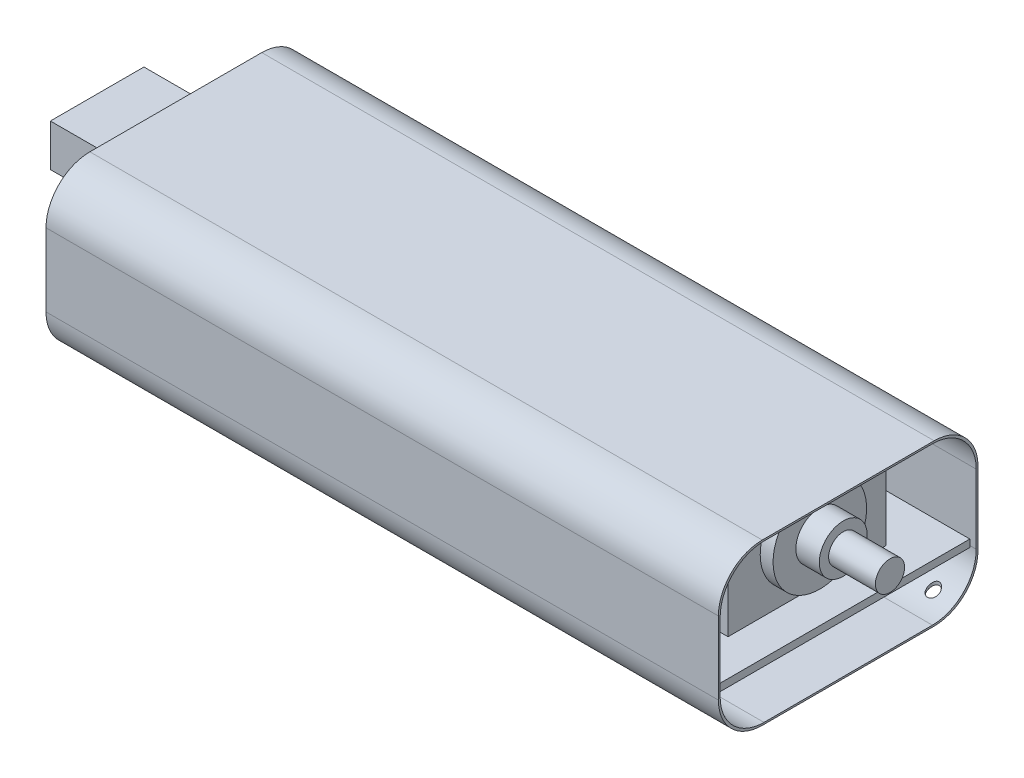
ISO-10303-21;
HEADER;
FILE_DESCRIPTION(('STEP AP214'),'2;1');
FILE_NAME('part.step','',(''),(''),'','','');
FILE_SCHEMA(('AUTOMOTIVE_DESIGN { 1 0 10303 214 1 1 1 1 }'));
ENDSEC;
DATA;
#1=APPLICATION_CONTEXT('core data for automotive mechanical design processes');
#2=APPLICATION_PROTOCOL_DEFINITION('international standard','automotive_design',2000,#1);
#3=PRODUCT_CONTEXT('',#1,'mechanical');
#4=PRODUCT('Part','Part','',(#3));
#5=PRODUCT_RELATED_PRODUCT_CATEGORY('part','',(#4));
#6=PRODUCT_DEFINITION_FORMATION('','',#4);
#7=PRODUCT_DEFINITION_CONTEXT('part definition',#1,'design');
#8=PRODUCT_DEFINITION('design','',#6,#7);
#9=PRODUCT_DEFINITION_SHAPE('','',#8);
#10=(LENGTH_UNIT() NAMED_UNIT(*) SI_UNIT(.MILLI.,.METRE.));
#11=(NAMED_UNIT(*) PLANE_ANGLE_UNIT() SI_UNIT($,.RADIAN.));
#12=(NAMED_UNIT(*) SI_UNIT($,.STERADIAN.) SOLID_ANGLE_UNIT());
#13=UNCERTAINTY_MEASURE_WITH_UNIT(LENGTH_MEASURE(1.E-05),#10,'distance_accuracy_value','');
#14=(GEOMETRIC_REPRESENTATION_CONTEXT(3) GLOBAL_UNCERTAINTY_ASSIGNED_CONTEXT((#13)) GLOBAL_UNIT_ASSIGNED_CONTEXT((#10,
#11,#12)) REPRESENTATION_CONTEXT('',''));
#15=CARTESIAN_POINT('',(0.,0.,0.));
#16=DIRECTION('',(0.,0.,1.));
#17=DIRECTION('',(1.,0.,0.));
#18=AXIS2_PLACEMENT_3D('',#15,#16,#17);
#19=CARTESIAN_POINT('',(0.,14.3002,-54.991));
#20=DIRECTION('',(0.,1.,0.));
#21=DIRECTION('',(0.,0.,1.));
#22=AXIS2_PLACEMENT_3D('',#19,#20,#21);
#23=PLANE('',#22);
#24=DIRECTION('',(0.,0.,-1.));
#25=VECTOR('',#24,1.);
#26=CARTESIAN_POINT('',(0.,14.3002,0.));
#27=LINE('',#26,#25);
#28=CARTESIAN_POINT('',(0.,14.3002,-37.6555));
#29=VERTEX_POINT('',#28);
#30=CARTESIAN_POINT('',(0.,14.3002,-54.991));
#31=VERTEX_POINT('',#30);
#32=EDGE_CURVE('E957',#29,#31,#27,.T.);
#33=ORIENTED_EDGE('',*,*,#32,.F.);
#34=DIRECTION('',(1.,0.,0.));
#35=VECTOR('',#34,1.);
#36=CARTESIAN_POINT('',(0.,14.3002,-37.6555));
#37=LINE('',#36,#35);
#38=CARTESIAN_POINT('',(6.35,14.3002,-37.6555));
#39=VERTEX_POINT('',#38);
#40=EDGE_CURVE('E998',#29,#39,#37,.T.);
#41=ORIENTED_EDGE('',*,*,#40,.T.);
#42=DIRECTION('',(0.,0.,-1.));
#43=VECTOR('',#42,1.);
#44=CARTESIAN_POINT('',(6.35,14.3002,-54.991));
#45=LINE('',#44,#43);
#46=CARTESIAN_POINT('',(6.35,14.3002,-17.3355));
#47=VERTEX_POINT('',#46);
#48=EDGE_CURVE('E990',#47,#39,#45,.T.);
#49=ORIENTED_EDGE('',*,*,#48,.F.);
#50=DIRECTION('',(-1.,0.,0.));
#51=VECTOR('',#50,1.);
#52=CARTESIAN_POINT('',(0.,14.3002,-17.3355));
#53=LINE('',#52,#51);
#54=CARTESIAN_POINT('',(0.,14.3002,-17.3355));
#55=VERTEX_POINT('',#54);
#56=EDGE_CURVE('E994',#47,#55,#53,.T.);
#57=ORIENTED_EDGE('',*,*,#56,.T.);
#58=CARTESIAN_POINT('',(0.,14.3002,0.));
#59=VERTEX_POINT('',#58);
#60=EDGE_CURVE('E952',#59,#55,#27,.T.);
#61=ORIENTED_EDGE('',*,*,#60,.F.);
#62=DIRECTION('',(1.,0.,0.));
#63=VECTOR('',#62,1.);
#64=CARTESIAN_POINT('',(0.,14.3002,0.));
#65=LINE('',#64,#63);
#66=CARTESIAN_POINT('',(87.884,14.3002,0.));
#67=VERTEX_POINT('',#66);
#68=EDGE_CURVE('E965',#59,#67,#65,.T.);
#69=ORIENTED_EDGE('',*,*,#68,.T.);
#70=DIRECTION('',(0.,0.,1.));
#71=VECTOR('',#70,1.);
#72=CARTESIAN_POINT('',(87.884,14.3002,-54.991));
#73=LINE('',#72,#71);
#74=CARTESIAN_POINT('',(87.884,14.3002,-54.991));
#75=VERTEX_POINT('',#74);
#76=EDGE_CURVE('E961',#75,#67,#73,.T.);
#77=ORIENTED_EDGE('',*,*,#76,.F.);
#78=DIRECTION('',(-1.,0.,0.));
#79=VECTOR('',#78,1.);
#80=CARTESIAN_POINT('',(87.884,14.3002,-54.991));
#81=LINE('',#80,#79);
#82=EDGE_CURVE('E956',#75,#31,#81,.T.);
#83=ORIENTED_EDGE('',*,*,#82,.T.);
#84=EDGE_LOOP('',(#33,#41,#49,#57,#61,#69,#77,#83));
#85=FACE_BOUND('',#84,.T.);
#86=DIRECTION('',(-1.,0.,0.));
#87=VECTOR('',#86,1.);
#88=CARTESIAN_POINT('',(0.,14.3002,-5.07999999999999));
#89=LINE('',#88,#87);
#90=CARTESIAN_POINT('',(40.64,14.3002,-5.07999999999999));
#91=VERTEX_POINT('',#90);
#92=CARTESIAN_POINT('',(33.02,14.3002,-5.07999999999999));
#93=VERTEX_POINT('',#92);
#94=EDGE_CURVE('E1020',#91,#93,#89,.T.);
#95=ORIENTED_EDGE('',*,*,#94,.T.);
#96=DIRECTION('',(0.,0.,-1.));
#97=VECTOR('',#96,1.);
#98=CARTESIAN_POINT('',(33.02,14.3002,-54.991));
#99=LINE('',#98,#97);
#100=CARTESIAN_POINT('',(33.02,14.3002,-7.61999999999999));
#101=VERTEX_POINT('',#100);
#102=EDGE_CURVE('E1024',#93,#101,#99,.T.);
#103=ORIENTED_EDGE('',*,*,#102,.T.);
#104=DIRECTION('',(1.,0.,0.));
#105=VECTOR('',#104,1.);
#106=CARTESIAN_POINT('',(0.,14.3002,-7.62));
#107=LINE('',#106,#105);
#108=CARTESIAN_POINT('',(40.64,14.3002,-7.62));
#109=VERTEX_POINT('',#108);
#110=EDGE_CURVE('E1012',#101,#109,#107,.T.);
#111=ORIENTED_EDGE('',*,*,#110,.T.);
#112=DIRECTION('',(0.,0.,1.));
#113=VECTOR('',#112,1.);
#114=CARTESIAN_POINT('',(40.64,14.3002,-54.991));
#115=LINE('',#114,#113);
#116=EDGE_CURVE('E1016',#109,#91,#115,.T.);
#117=ORIENTED_EDGE('',*,*,#116,.T.);
#118=EDGE_LOOP('',(#95,#103,#111,#117));
#119=FACE_BOUND('',#118,.T.);
#120=DIRECTION('',(-1.,0.,0.));
#121=VECTOR('',#120,1.);
#122=CARTESIAN_POINT('',(0.,14.3002,-42.291));
#123=LINE('',#122,#121);
#124=CARTESIAN_POINT('',(7.62,14.3002,-42.291));
#125=VERTEX_POINT('',#124);
#126=CARTESIAN_POINT('',(2.54,14.3002,-42.291));
#127=VERTEX_POINT('',#126);
#128=EDGE_CURVE('E68',#125,#127,#123,.T.);
#129=ORIENTED_EDGE('',*,*,#128,.T.);
#130=DIRECTION('',(0.,0.,-1.));
#131=VECTOR('',#130,1.);
#132=CARTESIAN_POINT('',(2.54,14.3002,-54.991));
#133=LINE('',#132,#131);
#134=CARTESIAN_POINT('',(2.54,14.3002,-52.451));
#135=VERTEX_POINT('',#134);
#136=EDGE_CURVE('E13',#127,#135,#133,.T.);
#137=ORIENTED_EDGE('',*,*,#136,.T.);
#138=DIRECTION('',(1.,0.,0.));
#139=VECTOR('',#138,1.);
#140=CARTESIAN_POINT('',(0.,14.3002,-52.451));
#141=LINE('',#140,#139);
#142=CARTESIAN_POINT('',(7.62,14.3002,-52.451));
#143=VERTEX_POINT('',#142);
#144=EDGE_CURVE('E1028',#135,#143,#141,.T.);
#145=ORIENTED_EDGE('',*,*,#144,.T.);
#146=DIRECTION('',(0.,0.,1.));
#147=VECTOR('',#146,1.);
#148=CARTESIAN_POINT('',(7.62,14.3002,-54.991));
#149=LINE('',#148,#147);
#150=EDGE_CURVE('E1032',#143,#125,#149,.T.);
#151=ORIENTED_EDGE('',*,*,#150,.T.);
#152=EDGE_LOOP('',(#129,#137,#145,#151));
#153=FACE_BOUND('',#152,.T.);
#154=ADVANCED_FACE('F54',(#85,#119,#153),#23,.T.);
#155=CARTESIAN_POINT('',(0.,1.6002,0.));
#156=DIRECTION('',(0.,-1.,0.));
#157=DIRECTION('',(0.,0.,-1.));
#158=AXIS2_PLACEMENT_3D('',#155,#156,#157);
#159=PLANE('',#158);
#160=DIRECTION('',(-1.,0.,0.));
#161=VECTOR('',#160,1.);
#162=CARTESIAN_POINT('',(145.034,1.6002,-54.991));
#163=LINE('',#162,#161);
#164=CARTESIAN_POINT('',(145.034,1.6002,-54.991));
#165=VERTEX_POINT('',#164);
#166=CARTESIAN_POINT('',(87.884,1.6002,-54.991));
#167=VERTEX_POINT('',#166);
#168=EDGE_CURVE('E978',#165,#167,#163,.T.);
#169=ORIENTED_EDGE('',*,*,#168,.T.);
#170=DIRECTION('',(0.,0.,1.));
#171=VECTOR('',#170,1.);
#172=CARTESIAN_POINT('',(87.884,1.6002,-54.991));
#173=LINE('',#172,#171);
#174=CARTESIAN_POINT('',(87.884,1.6002,0.));
#175=VERTEX_POINT('',#174);
#176=EDGE_CURVE('E951',#167,#175,#173,.T.);
#177=ORIENTED_EDGE('',*,*,#176,.T.);
#178=DIRECTION('',(1.,0.,0.));
#179=VECTOR('',#178,1.);
#180=CARTESIAN_POINT('',(0.,1.6002,0.));
#181=LINE('',#180,#179);
#182=CARTESIAN_POINT('',(145.034,1.6002,0.));
#183=VERTEX_POINT('',#182);
#184=EDGE_CURVE('E1228',#175,#183,#181,.T.);
#185=ORIENTED_EDGE('',*,*,#184,.T.);
#186=DIRECTION('',(0.,0.,1.));
#187=VECTOR('',#186,1.);
#188=CARTESIAN_POINT('',(145.034,1.6002,-54.991));
#189=LINE('',#188,#187);
#190=EDGE_CURVE('E1230',#165,#183,#189,.T.);
#191=ORIENTED_EDGE('',*,*,#190,.F.);
#192=EDGE_LOOP('',(#169,#177,#185,#191));
#193=FACE_BOUND('',#192,.T.);
#194=DIRECTION('',(0.,0.,1.));
#195=VECTOR('',#194,1.);
#196=CARTESIAN_POINT('',(124.714,1.6002,-44.6405));
#197=LINE('',#196,#195);
#198=CARTESIAN_POINT('',(124.714,1.6002,-44.6405));
#199=VERTEX_POINT('',#198);
#200=CARTESIAN_POINT('',(124.714,1.6002,-10.3505));
#201=VERTEX_POINT('',#200);
#202=EDGE_CURVE('E784',#199,#201,#197,.T.);
#203=ORIENTED_EDGE('',*,*,#202,.F.);
#204=DIRECTION('',(-1.,0.,0.));
#205=VECTOR('',#204,1.);
#206=CARTESIAN_POINT('',(137.16,1.6002,-44.6405));
#207=LINE('',#206,#205);
#208=CARTESIAN_POINT('',(137.16,1.6002,-44.6405));
#209=VERTEX_POINT('',#208);
#210=EDGE_CURVE('E789',#209,#199,#207,.T.);
#211=ORIENTED_EDGE('',*,*,#210,.F.);
#212=DIRECTION('',(0.,0.,-1.));
#213=VECTOR('',#212,1.);
#214=CARTESIAN_POINT('',(137.16,1.6002,-10.3505000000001));
#215=LINE('',#214,#213);
#216=CARTESIAN_POINT('',(137.16,1.6002,-10.3505000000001));
#217=VERTEX_POINT('',#216);
#218=EDGE_CURVE('E806',#217,#209,#215,.T.);
#219=ORIENTED_EDGE('',*,*,#218,.F.);
#220=DIRECTION('',(-1.,0.,0.));
#221=VECTOR('',#220,1.);
#222=CARTESIAN_POINT('',(137.16,1.6002,-10.3505000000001));
#223=LINE('',#222,#221);
#224=EDGE_CURVE('E803',#217,#201,#223,.T.);
#225=ORIENTED_EDGE('',*,*,#224,.T.);
#226=EDGE_LOOP('',(#203,#211,#219,#225));
#227=FACE_BOUND('',#226,.T.);
#228=ADVANCED_FACE('F1157',(#193,#227),#159,.F.);
#229=CARTESIAN_POINT('',(0.,0.,0.));
#230=DIRECTION('',(0.,-1.,0.));
#231=DIRECTION('',(0.,0.,-1.));
#232=AXIS2_PLACEMENT_3D('',#229,#230,#231);
#233=PLANE('',#232);
#234=DIRECTION('',(0.,0.,-1.));
#235=VECTOR('',#234,1.);
#236=CARTESIAN_POINT('',(0.,0.,0.));
#237=LINE('',#236,#235);
#238=CARTESIAN_POINT('',(0.,0.,0.));
#239=VERTEX_POINT('',#238);
#240=CARTESIAN_POINT('',(0.,0.,-54.991));
#241=VERTEX_POINT('',#240);
#242=EDGE_CURVE('E983',#239,#241,#237,.T.);
#243=ORIENTED_EDGE('',*,*,#242,.T.);
#244=DIRECTION('',(-1.,0.,0.));
#245=VECTOR('',#244,1.);
#246=CARTESIAN_POINT('',(145.034,0.,-54.991));
#247=LINE('',#246,#245);
#248=CARTESIAN_POINT('',(145.034,0.,-54.991));
#249=VERTEX_POINT('',#248);
#250=EDGE_CURVE('E1194',#249,#241,#247,.T.);
#251=ORIENTED_EDGE('',*,*,#250,.F.);
#252=DIRECTION('',(0.,0.,1.));
#253=VECTOR('',#252,1.);
#254=CARTESIAN_POINT('',(145.034,0.,-54.991));
#255=LINE('',#254,#253);
#256=CARTESIAN_POINT('',(145.034,0.,0.));
#257=VERTEX_POINT('',#256);
#258=EDGE_CURVE('E1203',#249,#257,#255,.T.);
#259=ORIENTED_EDGE('',*,*,#258,.T.);
#260=DIRECTION('',(1.,0.,0.));
#261=VECTOR('',#260,1.);
#262=CARTESIAN_POINT('',(0.,0.,0.));
#263=LINE('',#262,#261);
#264=EDGE_CURVE('E1209',#239,#257,#263,.T.);
#265=ORIENTED_EDGE('',*,*,#264,.F.);
#266=EDGE_LOOP('',(#243,#251,#259,#265));
#267=FACE_BOUND('',#266,.T.);
#268=DIRECTION('',(1.,0.,0.));
#269=VECTOR('',#268,1.);
#270=CARTESIAN_POINT('',(57.7365751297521,0.,-20.7534232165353));
#271=LINE('',#270,#269);
#272=CARTESIAN_POINT('',(57.7365751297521,0.,-20.7534232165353));
#273=VERTEX_POINT('',#272);
#274=CARTESIAN_POINT('',(77.7894013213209,0.,-20.7534232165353));
#275=VERTEX_POINT('',#274);
#276=EDGE_CURVE('E884',#273,#275,#271,.T.);
#277=ORIENTED_EDGE('',*,*,#276,.F.);
#278=DIRECTION('',(0.,0.,-1.));
#279=VECTOR('',#278,1.);
#280=CARTESIAN_POINT('',(57.7365751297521,0.,-8.05342321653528));
#281=LINE('',#280,#279);
#282=CARTESIAN_POINT('',(57.7365751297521,0.,-8.05342321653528));
#283=VERTEX_POINT('',#282);
#284=EDGE_CURVE('E872',#283,#273,#281,.T.);
#285=ORIENTED_EDGE('',*,*,#284,.F.);
#286=DIRECTION('',(-1.,0.,0.));
#287=VECTOR('',#286,1.);
#288=CARTESIAN_POINT('',(57.7365751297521,0.,-8.05342321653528));
#289=LINE('',#288,#287);
#290=CARTESIAN_POINT('',(77.7894013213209,0.,-8.05342321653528));
#291=VERTEX_POINT('',#290);
#292=EDGE_CURVE('E877',#291,#283,#289,.T.);
#293=ORIENTED_EDGE('',*,*,#292,.F.);
#294=DIRECTION('',(0.,0.,1.));
#295=VECTOR('',#294,1.);
#296=CARTESIAN_POINT('',(77.7894013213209,0.,-8.05342321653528));
#297=LINE('',#296,#295);
#298=EDGE_CURVE('E887',#275,#291,#297,.T.);
#299=ORIENTED_EDGE('',*,*,#298,.F.);
#300=EDGE_LOOP('',(#277,#285,#293,#299));
#301=FACE_BOUND('',#300,.T.);
#302=DIRECTION('',(1.,0.,0.));
#303=VECTOR('',#302,1.);
#304=CARTESIAN_POINT('',(57.7365751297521,0.,-44.8083622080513));
#305=LINE('',#304,#303);
#306=CARTESIAN_POINT('',(57.7365751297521,0.,-44.8083622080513));
#307=VERTEX_POINT('',#306);
#308=CARTESIAN_POINT('',(77.7894013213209,0.,-44.8083622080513));
#309=VERTEX_POINT('',#308);
#310=EDGE_CURVE('E850',#307,#309,#305,.T.);
#311=ORIENTED_EDGE('',*,*,#310,.F.);
#312=DIRECTION('',(0.,0.,-1.));
#313=VECTOR('',#312,1.);
#314=CARTESIAN_POINT('',(57.7365751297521,0.,-32.1083622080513));
#315=LINE('',#314,#313);
#316=CARTESIAN_POINT('',(57.7365751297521,0.,-32.1083622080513));
#317=VERTEX_POINT('',#316);
#318=EDGE_CURVE('E828',#317,#307,#315,.T.);
#319=ORIENTED_EDGE('',*,*,#318,.F.);
#320=DIRECTION('',(-1.,0.,0.));
#321=VECTOR('',#320,1.);
#322=CARTESIAN_POINT('',(57.7365751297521,0.,-32.1083622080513));
#323=LINE('',#322,#321);
#324=CARTESIAN_POINT('',(77.7894013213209,0.,-32.1083622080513));
#325=VERTEX_POINT('',#324);
#326=EDGE_CURVE('E834',#325,#317,#323,.T.);
#327=ORIENTED_EDGE('',*,*,#326,.F.);
#328=DIRECTION('',(0.,0.,1.));
#329=VECTOR('',#328,1.);
#330=CARTESIAN_POINT('',(77.7894013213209,0.,-32.1083622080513));
#331=LINE('',#330,#329);
#332=EDGE_CURVE('E853',#309,#325,#331,.T.);
#333=ORIENTED_EDGE('',*,*,#332,.F.);
#334=EDGE_LOOP('',(#311,#319,#327,#333));
#335=FACE_BOUND('',#334,.T.);
#336=ADVANCED_FACE('F1163',(#267,#301,#335),#233,.T.);
#337=CARTESIAN_POINT('',(0.,1.6002,0.));
#338=DIRECTION('',(-1.,0.,0.));
#339=DIRECTION('',(0.,0.,1.));
#340=AXIS2_PLACEMENT_3D('',#337,#338,#339);
#341=PLANE('',#340);
#342=DIRECTION('',(0.,0.,-1.));
#343=VECTOR('',#342,1.);
#344=CARTESIAN_POINT('',(0.,8.89,0.));
#345=LINE('',#344,#343);
#346=CARTESIAN_POINT('',(0.,8.89,-17.3355));
#347=VERTEX_POINT('',#346);
#348=CARTESIAN_POINT('',(0.,8.88999999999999,-37.6555));
#349=VERTEX_POINT('',#348);
#350=EDGE_CURVE('E1001',#347,#349,#345,.T.);
#351=ORIENTED_EDGE('',*,*,#350,.T.);
#352=DIRECTION('',(0.,1.,0.));
#353=VECTOR('',#352,1.);
#354=CARTESIAN_POINT('',(0.,1.6002,-37.6555));
#355=LINE('',#354,#353);
#356=EDGE_CURVE('E948',#349,#29,#355,.T.);
#357=ORIENTED_EDGE('',*,*,#356,.T.);
#358=ORIENTED_EDGE('',*,*,#32,.T.);
#359=DIRECTION('',(0.,-1.,0.));
#360=VECTOR('',#359,1.);
#361=CARTESIAN_POINT('',(0.,1.6002,-54.991));
#362=LINE('',#361,#360);
#363=EDGE_CURVE('E1197',#31,#241,#362,.T.);
#364=ORIENTED_EDGE('',*,*,#363,.T.);
#365=ORIENTED_EDGE('',*,*,#242,.F.);
#366=DIRECTION('',(0.,-1.,0.));
#367=VECTOR('',#366,1.);
#368=CARTESIAN_POINT('',(0.,1.6002,0.));
#369=LINE('',#368,#367);
#370=EDGE_CURVE('E995',#59,#239,#369,.T.);
#371=ORIENTED_EDGE('',*,*,#370,.F.);
#372=ORIENTED_EDGE('',*,*,#60,.T.);
#373=DIRECTION('',(0.,-1.,0.));
#374=VECTOR('',#373,1.);
#375=CARTESIAN_POINT('',(0.,1.6002,-17.3355));
#376=LINE('',#375,#374);
#377=EDGE_CURVE('E945',#55,#347,#376,.T.);
#378=ORIENTED_EDGE('',*,*,#377,.T.);
#379=EDGE_LOOP('',(#351,#357,#358,#364,#365,#371,#372,#378));
#380=FACE_BOUND('',#379,.T.);
#381=ADVANCED_FACE('F56',(#380),#341,.T.);
#382=CARTESIAN_POINT('',(0.,1.6002,0.));
#383=DIRECTION('',(0.,0.,-1.));
#384=DIRECTION('',(-1.,0.,0.));
#385=AXIS2_PLACEMENT_3D('',#382,#383,#384);
#386=PLANE('',#385);
#387=ORIENTED_EDGE('',*,*,#264,.T.);
#388=DIRECTION('',(0.,-1.,0.));
#389=VECTOR('',#388,1.);
#390=CARTESIAN_POINT('',(145.034,1.6002,0.));
#391=LINE('',#390,#389);
#392=EDGE_CURVE('E1222',#183,#257,#391,.T.);
#393=ORIENTED_EDGE('',*,*,#392,.F.);
#394=ORIENTED_EDGE('',*,*,#184,.F.);
#395=DIRECTION('',(0.,-1.,0.));
#396=VECTOR('',#395,1.);
#397=CARTESIAN_POINT('',(87.884,14.3002,0.));
#398=LINE('',#397,#396);
#399=EDGE_CURVE('E980',#67,#175,#398,.T.);
#400=ORIENTED_EDGE('',*,*,#399,.F.);
#401=ORIENTED_EDGE('',*,*,#68,.F.);
#402=ORIENTED_EDGE('',*,*,#370,.T.);
#403=EDGE_LOOP('',(#387,#393,#394,#400,#401,#402));
#404=FACE_BOUND('',#403,.T.);
#405=ADVANCED_FACE('F1180',(#404),#386,.F.);
#406=CARTESIAN_POINT('',(145.034,1.6002,-54.991));
#407=DIRECTION('',(1.,0.,0.));
#408=DIRECTION('',(0.,0.,-1.));
#409=AXIS2_PLACEMENT_3D('',#406,#407,#408);
#410=PLANE('',#409);
#411=ORIENTED_EDGE('',*,*,#258,.F.);
#412=DIRECTION('',(0.,-1.,0.));
#413=VECTOR('',#412,1.);
#414=CARTESIAN_POINT('',(145.034,1.6002,-54.991));
#415=LINE('',#414,#413);
#416=EDGE_CURVE('E1199',#165,#249,#415,.T.);
#417=ORIENTED_EDGE('',*,*,#416,.F.);
#418=ORIENTED_EDGE('',*,*,#190,.T.);
#419=ORIENTED_EDGE('',*,*,#392,.T.);
#420=EDGE_LOOP('',(#411,#417,#418,#419));
#421=FACE_BOUND('',#420,.T.);
#422=ADVANCED_FACE('F1183',(#421),#410,.T.);
#423=CARTESIAN_POINT('',(145.034,1.6002,-54.991));
#424=DIRECTION('',(0.,0.,1.));
#425=DIRECTION('',(1.,0.,0.));
#426=AXIS2_PLACEMENT_3D('',#423,#424,#425);
#427=PLANE('',#426);
#428=ORIENTED_EDGE('',*,*,#250,.T.);
#429=ORIENTED_EDGE('',*,*,#363,.F.);
#430=ORIENTED_EDGE('',*,*,#82,.F.);
#431=DIRECTION('',(0.,-1.,0.));
#432=VECTOR('',#431,1.);
#433=CARTESIAN_POINT('',(87.884,14.3002,-54.991));
#434=LINE('',#433,#432);
#435=EDGE_CURVE('E968',#75,#167,#434,.T.);
#436=ORIENTED_EDGE('',*,*,#435,.T.);
#437=ORIENTED_EDGE('',*,*,#168,.F.);
#438=ORIENTED_EDGE('',*,*,#416,.T.);
#439=EDGE_LOOP('',(#428,#429,#430,#436,#437,#438));
#440=FACE_BOUND('',#439,.T.);
#441=ADVANCED_FACE('F1174',(#440),#427,.F.);
#442=CARTESIAN_POINT('',(87.884,14.3002,-54.991));
#443=DIRECTION('',(1.,0.,0.));
#444=DIRECTION('',(0.,0.,-1.));
#445=AXIS2_PLACEMENT_3D('',#442,#443,#444);
#446=PLANE('',#445);
#447=ORIENTED_EDGE('',*,*,#176,.F.);
#448=ORIENTED_EDGE('',*,*,#435,.F.);
#449=ORIENTED_EDGE('',*,*,#76,.T.);
#450=ORIENTED_EDGE('',*,*,#399,.T.);
#451=EDGE_LOOP('',(#447,#448,#449,#450));
#452=FACE_BOUND('',#451,.T.);
#453=ADVANCED_FACE('F1172',(#452),#446,.T.);
#454=CARTESIAN_POINT('',(-17.018,8.88999999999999,-37.6555));
#455=DIRECTION('',(0.,0.,1.));
#456=DIRECTION('',(1.,0.,0.));
#457=AXIS2_PLACEMENT_3D('',#454,#455,#456);
#458=PLANE('',#457);
#459=ORIENTED_EDGE('',*,*,#356,.F.);
#460=DIRECTION('',(1.,0.,0.));
#461=VECTOR('',#460,1.);
#462=CARTESIAN_POINT('',(-17.018,8.88999999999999,-37.6555));
#463=LINE('',#462,#461);
#464=CARTESIAN_POINT('',(-17.018,8.88999999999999,-37.6555));
#465=VERTEX_POINT('',#464);
#466=EDGE_CURVE('E941',#465,#349,#463,.T.);
#467=ORIENTED_EDGE('',*,*,#466,.F.);
#468=DIRECTION('',(0.,-1.,0.));
#469=VECTOR('',#468,1.);
#470=CARTESIAN_POINT('',(-17.018,8.88999999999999,-37.6555));
#471=LINE('',#470,#469);
#472=CARTESIAN_POINT('',(-17.018,18.034,-37.6555));
#473=VERTEX_POINT('',#472);
#474=EDGE_CURVE('E917',#473,#465,#471,.T.);
#475=ORIENTED_EDGE('',*,*,#474,.F.);
#476=DIRECTION('',(1.,0.,0.));
#477=VECTOR('',#476,1.);
#478=CARTESIAN_POINT('',(-17.018,18.034,-37.6555));
#479=LINE('',#478,#477);
#480=CARTESIAN_POINT('',(6.35,18.034,-37.6555));
#481=VERTEX_POINT('',#480);
#482=EDGE_CURVE('E930',#473,#481,#479,.T.);
#483=ORIENTED_EDGE('',*,*,#482,.T.);
#484=DIRECTION('',(0.,-1.,0.));
#485=VECTOR('',#484,1.);
#486=CARTESIAN_POINT('',(6.35,8.88999999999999,-37.6555));
#487=LINE('',#486,#485);
#488=EDGE_CURVE('E906',#481,#39,#487,.T.);
#489=ORIENTED_EDGE('',*,*,#488,.T.);
#490=ORIENTED_EDGE('',*,*,#40,.F.);
#491=EDGE_LOOP('',(#459,#467,#475,#483,#489,#490));
#492=FACE_BOUND('',#491,.T.);
#493=ADVANCED_FACE('F1170',(#492),#458,.F.);
#494=CARTESIAN_POINT('',(-17.018,8.88999999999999,-37.6555));
#495=DIRECTION('',(0.,1.,0.));
#496=DIRECTION('',(0.,0.,1.));
#497=AXIS2_PLACEMENT_3D('',#494,#495,#496);
#498=PLANE('',#497);
#499=ORIENTED_EDGE('',*,*,#350,.F.);
#500=DIRECTION('',(1.,0.,0.));
#501=VECTOR('',#500,1.);
#502=CARTESIAN_POINT('',(-17.018,8.89,-17.3355));
#503=LINE('',#502,#501);
#504=CARTESIAN_POINT('',(-17.018,8.89,-17.3355));
#505=VERTEX_POINT('',#504);
#506=EDGE_CURVE('E937',#505,#347,#503,.T.);
#507=ORIENTED_EDGE('',*,*,#506,.F.);
#508=DIRECTION('',(0.,0.,1.));
#509=VECTOR('',#508,1.);
#510=CARTESIAN_POINT('',(-17.018,8.88999999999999,-37.6555));
#511=LINE('',#510,#509);
#512=EDGE_CURVE('E921',#465,#505,#511,.T.);
#513=ORIENTED_EDGE('',*,*,#512,.F.);
#514=ORIENTED_EDGE('',*,*,#466,.T.);
#515=EDGE_LOOP('',(#499,#507,#513,#514));
#516=FACE_BOUND('',#515,.T.);
#517=ADVANCED_FACE('F1254',(#516),#498,.F.);
#518=CARTESIAN_POINT('',(-17.018,8.89,-17.3355));
#519=DIRECTION('',(0.,0.,-1.));
#520=DIRECTION('',(-1.,0.,0.));
#521=AXIS2_PLACEMENT_3D('',#518,#519,#520);
#522=PLANE('',#521);
#523=ORIENTED_EDGE('',*,*,#377,.F.);
#524=ORIENTED_EDGE('',*,*,#56,.F.);
#525=DIRECTION('',(0.,1.,0.));
#526=VECTOR('',#525,1.);
#527=CARTESIAN_POINT('',(6.35,8.89,-17.3355));
#528=LINE('',#527,#526);
#529=CARTESIAN_POINT('',(6.35,18.034,-17.3355));
#530=VERTEX_POINT('',#529);
#531=EDGE_CURVE('E910',#47,#530,#528,.T.);
#532=ORIENTED_EDGE('',*,*,#531,.T.);
#533=DIRECTION('',(1.,0.,0.));
#534=VECTOR('',#533,1.);
#535=CARTESIAN_POINT('',(-17.018,18.034,-17.3355));
#536=LINE('',#535,#534);
#537=CARTESIAN_POINT('',(-17.018,18.034,-17.3355));
#538=VERTEX_POINT('',#537);
#539=EDGE_CURVE('E933',#538,#530,#536,.T.);
#540=ORIENTED_EDGE('',*,*,#539,.F.);
#541=DIRECTION('',(0.,1.,0.));
#542=VECTOR('',#541,1.);
#543=CARTESIAN_POINT('',(-17.018,8.89,-17.3355));
#544=LINE('',#543,#542);
#545=EDGE_CURVE('E924',#505,#538,#544,.T.);
#546=ORIENTED_EDGE('',*,*,#545,.F.);
#547=ORIENTED_EDGE('',*,*,#506,.T.);
#548=EDGE_LOOP('',(#523,#524,#532,#540,#546,#547));
#549=FACE_BOUND('',#548,.T.);
#550=ADVANCED_FACE('F1248',(#549),#522,.F.);
#551=CARTESIAN_POINT('',(-17.018,18.034,-37.6555));
#552=DIRECTION('',(0.,-1.,0.));
#553=DIRECTION('',(0.,0.,-1.));
#554=AXIS2_PLACEMENT_3D('',#551,#552,#553);
#555=PLANE('',#554);
#556=ORIENTED_EDGE('',*,*,#539,.T.);
#557=DIRECTION('',(0.,0.,-1.));
#558=VECTOR('',#557,1.);
#559=CARTESIAN_POINT('',(6.35,18.034,-37.6555));
#560=LINE('',#559,#558);
#561=EDGE_CURVE('E913',#530,#481,#560,.T.);
#562=ORIENTED_EDGE('',*,*,#561,.T.);
#563=ORIENTED_EDGE('',*,*,#482,.F.);
#564=DIRECTION('',(0.,0.,-1.));
#565=VECTOR('',#564,1.);
#566=CARTESIAN_POINT('',(-17.018,18.034,-37.6555));
#567=LINE('',#566,#565);
#568=EDGE_CURVE('E927',#538,#473,#567,.T.);
#569=ORIENTED_EDGE('',*,*,#568,.F.);
#570=EDGE_LOOP('',(#556,#562,#563,#569));
#571=FACE_BOUND('',#570,.T.);
#572=ADVANCED_FACE('F1266',(#571),#555,.F.);
#573=CARTESIAN_POINT('',(-17.018,18.034,-37.6555));
#574=DIRECTION('',(1.,0.,0.));
#575=DIRECTION('',(0.,0.,-1.));
#576=AXIS2_PLACEMENT_3D('',#573,#574,#575);
#577=PLANE('',#576);
#578=ORIENTED_EDGE('',*,*,#474,.T.);
#579=ORIENTED_EDGE('',*,*,#512,.T.);
#580=ORIENTED_EDGE('',*,*,#545,.T.);
#581=ORIENTED_EDGE('',*,*,#568,.T.);
#582=EDGE_LOOP('',(#578,#579,#580,#581));
#583=FACE_BOUND('',#582,.T.);
#584=ADVANCED_FACE('F1269',(#583),#577,.F.);
#585=CARTESIAN_POINT('',(6.35,18.034,-37.6555));
#586=DIRECTION('',(1.,0.,0.));
#587=DIRECTION('',(0.,0.,-1.));
#588=AXIS2_PLACEMENT_3D('',#585,#586,#587);
#589=PLANE('',#588);
#590=ORIENTED_EDGE('',*,*,#531,.F.);
#591=ORIENTED_EDGE('',*,*,#48,.T.);
#592=ORIENTED_EDGE('',*,*,#488,.F.);
#593=ORIENTED_EDGE('',*,*,#561,.F.);
#594=EDGE_LOOP('',(#590,#591,#592,#593));
#595=FACE_BOUND('',#594,.T.);
#596=ADVANCED_FACE('F1262',(#595),#589,.T.);
#597=CARTESIAN_POINT('',(57.7365751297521,-9.525,-8.05342321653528));
#598=DIRECTION('',(1.,0.,0.));
#599=DIRECTION('',(0.,0.,-1.));
#600=AXIS2_PLACEMENT_3D('',#597,#598,#599);
#601=PLANE('',#600);
#602=DIRECTION('',(0.,0.,1.));
#603=VECTOR('',#602,1.);
#604=CARTESIAN_POINT('',(57.7365751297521,-9.525,-8.05342321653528));
#605=LINE('',#604,#603);
#606=CARTESIAN_POINT('',(57.7365751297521,-9.525,-20.7534232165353));
#607=VERTEX_POINT('',#606);
#608=CARTESIAN_POINT('',(57.7365751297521,-9.525,-9.27100000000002));
#609=VERTEX_POINT('',#608);
#610=EDGE_CURVE('E725',#607,#609,#605,.T.);
#611=ORIENTED_EDGE('',*,*,#610,.T.);
#612=CARTESIAN_POINT('',(57.7365751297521,0.,-9.27100000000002));
#613=DIRECTION('',(1.,0.,0.));
#614=DIRECTION('',(0.,0.,-1.));
#615=AXIS2_PLACEMENT_3D('',#612,#613,#614);
#616=CIRCLE('',#615,9.525);
#617=CARTESIAN_POINT('',(57.7365751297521,-9.44685830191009,-8.05342321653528));
#618=VERTEX_POINT('',#617);
#619=EDGE_CURVE('E737',#609,#618,#616,.F.);
#620=ORIENTED_EDGE('',*,*,#619,.T.);
#621=DIRECTION('',(0.,1.,0.));
#622=VECTOR('',#621,1.);
#623=CARTESIAN_POINT('',(57.7365751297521,-9.525,-8.05342321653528));
#624=LINE('',#623,#622);
#625=EDGE_CURVE('E880',#618,#283,#624,.T.);
#626=ORIENTED_EDGE('',*,*,#625,.T.);
#627=ORIENTED_EDGE('',*,*,#284,.T.);
#628=DIRECTION('',(0.,1.,0.));
#629=VECTOR('',#628,1.);
#630=CARTESIAN_POINT('',(57.7365751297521,-9.525,-20.7534232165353));
#631=LINE('',#630,#629);
#632=EDGE_CURVE('E903',#607,#273,#631,.T.);
#633=ORIENTED_EDGE('',*,*,#632,.F.);
#634=EDGE_LOOP('',(#611,#620,#626,#627,#633));
#635=FACE_BOUND('',#634,.T.);
#636=ADVANCED_FACE('F1276',(#635),#601,.F.);
#637=CARTESIAN_POINT('',(57.7365751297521,-9.525,-20.7534232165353));
#638=DIRECTION('',(0.,0.,1.));
#639=DIRECTION('',(1.,0.,0.));
#640=AXIS2_PLACEMENT_3D('',#637,#638,#639);
#641=PLANE('',#640);
#642=ORIENTED_EDGE('',*,*,#276,.T.);
#643=DIRECTION('',(0.,1.,0.));
#644=VECTOR('',#643,1.);
#645=CARTESIAN_POINT('',(77.7894013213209,-9.525,-20.7534232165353));
#646=LINE('',#645,#644);
#647=CARTESIAN_POINT('',(77.7894013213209,-9.525,-20.7534232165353));
#648=VERTEX_POINT('',#647);
#649=EDGE_CURVE('E899',#648,#275,#646,.T.);
#650=ORIENTED_EDGE('',*,*,#649,.F.);
#651=DIRECTION('',(1.,0.,0.));
#652=VECTOR('',#651,1.);
#653=CARTESIAN_POINT('',(57.7365751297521,-9.525,-20.7534232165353));
#654=LINE('',#653,#652);
#655=EDGE_CURVE('E873',#607,#648,#654,.T.);
#656=ORIENTED_EDGE('',*,*,#655,.F.);
#657=ORIENTED_EDGE('',*,*,#632,.T.);
#658=EDGE_LOOP('',(#642,#650,#656,#657));
#659=FACE_BOUND('',#658,.T.);
#660=ADVANCED_FACE('F1389',(#659),#641,.F.);
#661=CARTESIAN_POINT('',(77.7894013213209,-9.525,-8.05342321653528));
#662=DIRECTION('',(-1.,0.,0.));
#663=DIRECTION('',(0.,0.,1.));
#664=AXIS2_PLACEMENT_3D('',#661,#662,#663);
#665=PLANE('',#664);
#666=DIRECTION('',(0.,1.,0.));
#667=VECTOR('',#666,1.);
#668=CARTESIAN_POINT('',(77.7894013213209,-9.525,-8.05342321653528));
#669=LINE('',#668,#667);
#670=CARTESIAN_POINT('',(77.7894013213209,-9.44685830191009,-8.05342321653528));
#671=VERTEX_POINT('',#670);
#672=EDGE_CURVE('E896',#671,#291,#669,.T.);
#673=ORIENTED_EDGE('',*,*,#672,.F.);
#674=CARTESIAN_POINT('',(77.7894013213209,0.,-9.27100000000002));
#675=DIRECTION('',(-1.,0.,0.));
#676=DIRECTION('',(0.,0.,1.));
#677=AXIS2_PLACEMENT_3D('',#674,#675,#676);
#678=CIRCLE('',#677,9.525);
#679=CARTESIAN_POINT('',(77.7894013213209,-9.525,-9.27100000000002));
#680=VERTEX_POINT('',#679);
#681=EDGE_CURVE('E733',#671,#680,#678,.F.);
#682=ORIENTED_EDGE('',*,*,#681,.T.);
#683=DIRECTION('',(0.,0.,1.));
#684=VECTOR('',#683,1.);
#685=CARTESIAN_POINT('',(77.7894013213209,-9.525,-8.05342321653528));
#686=LINE('',#685,#684);
#687=EDGE_CURVE('E876',#648,#680,#686,.T.);
#688=ORIENTED_EDGE('',*,*,#687,.F.);
#689=ORIENTED_EDGE('',*,*,#649,.T.);
#690=ORIENTED_EDGE('',*,*,#298,.T.);
#691=EDGE_LOOP('',(#673,#682,#688,#689,#690));
#692=FACE_BOUND('',#691,.T.);
#693=ADVANCED_FACE('F1392',(#692),#665,.F.);
#694=CARTESIAN_POINT('',(57.7365751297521,-9.525,-8.05342321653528));
#695=DIRECTION('',(0.,0.,-1.));
#696=DIRECTION('',(-1.,0.,0.));
#697=AXIS2_PLACEMENT_3D('',#694,#695,#696);
#698=PLANE('',#697);
#699=ORIENTED_EDGE('',*,*,#625,.F.);
#700=DIRECTION('',(-1.,0.,0.));
#701=VECTOR('',#700,1.);
#702=CARTESIAN_POINT('',(146.05,-9.44685830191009,-8.05342321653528));
#703=LINE('',#702,#701);
#704=EDGE_CURVE('E729',#618,#671,#703,.F.);
#705=ORIENTED_EDGE('',*,*,#704,.T.);
#706=ORIENTED_EDGE('',*,*,#672,.T.);
#707=ORIENTED_EDGE('',*,*,#292,.T.);
#708=EDGE_LOOP('',(#699,#705,#706,#707));
#709=FACE_BOUND('',#708,.T.);
#710=ADVANCED_FACE('F1355',(#709),#698,.F.);
#711=CARTESIAN_POINT('',(57.7365751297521,-9.525,-32.1083622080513));
#712=DIRECTION('',(1.,0.,0.));
#713=DIRECTION('',(0.,0.,-1.));
#714=AXIS2_PLACEMENT_3D('',#711,#712,#713);
#715=PLANE('',#714);
#716=ORIENTED_EDGE('',*,*,#318,.T.);
#717=DIRECTION('',(0.,1.,0.));
#718=VECTOR('',#717,1.);
#719=CARTESIAN_POINT('',(57.7365751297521,-9.525,-44.8083622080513));
#720=LINE('',#719,#718);
#721=CARTESIAN_POINT('',(57.7365751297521,-9.525,-44.8083622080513));
#722=VERTEX_POINT('',#721);
#723=EDGE_CURVE('E869',#722,#307,#720,.T.);
#724=ORIENTED_EDGE('',*,*,#723,.F.);
#725=DIRECTION('',(0.,0.,-1.));
#726=VECTOR('',#725,1.);
#727=CARTESIAN_POINT('',(57.7365751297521,-9.525,-32.1083622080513));
#728=LINE('',#727,#726);
#729=CARTESIAN_POINT('',(57.7365751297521,-9.525,-32.1083622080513));
#730=VERTEX_POINT('',#729);
#731=EDGE_CURVE('E829',#730,#722,#728,.T.);
#732=ORIENTED_EDGE('',*,*,#731,.F.);
#733=DIRECTION('',(0.,1.,0.));
#734=VECTOR('',#733,1.);
#735=CARTESIAN_POINT('',(57.7365751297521,-9.525,-32.1083622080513));
#736=LINE('',#735,#734);
#737=EDGE_CURVE('E846',#730,#317,#736,.T.);
#738=ORIENTED_EDGE('',*,*,#737,.T.);
#739=EDGE_LOOP('',(#716,#724,#732,#738));
#740=FACE_BOUND('',#739,.T.);
#741=ADVANCED_FACE('F1335',(#740),#715,.F.);
#742=CARTESIAN_POINT('',(57.7365751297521,-9.525,-44.8083622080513));
#743=DIRECTION('',(0.,0.,1.));
#744=DIRECTION('',(1.,0.,0.));
#745=AXIS2_PLACEMENT_3D('',#742,#743,#744);
#746=PLANE('',#745);
#747=ORIENTED_EDGE('',*,*,#310,.T.);
#748=DIRECTION('',(0.,1.,0.));
#749=VECTOR('',#748,1.);
#750=CARTESIAN_POINT('',(77.7894013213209,-9.525,-44.8083622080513));
#751=LINE('',#750,#749);
#752=CARTESIAN_POINT('',(77.7894013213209,-9.525,-44.8083622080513));
#753=VERTEX_POINT('',#752);
#754=EDGE_CURVE('E865',#753,#309,#751,.T.);
#755=ORIENTED_EDGE('',*,*,#754,.F.);
#756=DIRECTION('',(1.,0.,0.));
#757=VECTOR('',#756,1.);
#758=CARTESIAN_POINT('',(57.7365751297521,-9.525,-44.8083622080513));
#759=LINE('',#758,#757);
#760=EDGE_CURVE('E833',#722,#753,#759,.T.);
#761=ORIENTED_EDGE('',*,*,#760,.F.);
#762=ORIENTED_EDGE('',*,*,#723,.T.);
#763=EDGE_LOOP('',(#747,#755,#761,#762));
#764=FACE_BOUND('',#763,.T.);
#765=ADVANCED_FACE('F1330',(#764),#746,.F.);
#766=CARTESIAN_POINT('',(77.7894013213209,-9.525,-32.1083622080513));
#767=DIRECTION('',(-1.,0.,0.));
#768=DIRECTION('',(0.,0.,1.));
#769=AXIS2_PLACEMENT_3D('',#766,#767,#768);
#770=PLANE('',#769);
#771=ORIENTED_EDGE('',*,*,#332,.T.);
#772=DIRECTION('',(0.,1.,0.));
#773=VECTOR('',#772,1.);
#774=CARTESIAN_POINT('',(77.7894013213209,-9.525,-32.1083622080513));
#775=LINE('',#774,#773);
#776=CARTESIAN_POINT('',(77.7894013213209,-9.525,-32.1083622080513));
#777=VERTEX_POINT('',#776);
#778=EDGE_CURVE('E862',#777,#325,#775,.T.);
#779=ORIENTED_EDGE('',*,*,#778,.F.);
#780=DIRECTION('',(0.,0.,1.));
#781=VECTOR('',#780,1.);
#782=CARTESIAN_POINT('',(77.7894013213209,-9.525,-32.1083622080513));
#783=LINE('',#782,#781);
#784=EDGE_CURVE('E838',#753,#777,#783,.T.);
#785=ORIENTED_EDGE('',*,*,#784,.F.);
#786=ORIENTED_EDGE('',*,*,#754,.T.);
#787=EDGE_LOOP('',(#771,#779,#785,#786));
#788=FACE_BOUND('',#787,.T.);
#789=ADVANCED_FACE('F1334',(#788),#770,.F.);
#790=CARTESIAN_POINT('',(57.7365751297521,-9.525,-32.1083622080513));
#791=DIRECTION('',(0.,0.,-1.));
#792=DIRECTION('',(-1.,0.,0.));
#793=AXIS2_PLACEMENT_3D('',#790,#791,#792);
#794=PLANE('',#793);
#795=ORIENTED_EDGE('',*,*,#326,.T.);
#796=ORIENTED_EDGE('',*,*,#737,.F.);
#797=DIRECTION('',(-1.,0.,0.));
#798=VECTOR('',#797,1.);
#799=CARTESIAN_POINT('',(57.7365751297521,-9.525,-32.1083622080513));
#800=LINE('',#799,#798);
#801=EDGE_CURVE('E842',#777,#730,#800,.T.);
#802=ORIENTED_EDGE('',*,*,#801,.F.);
#803=ORIENTED_EDGE('',*,*,#778,.T.);
#804=EDGE_LOOP('',(#795,#796,#802,#803));
#805=FACE_BOUND('',#804,.T.);
#806=ADVANCED_FACE('F1346',(#805),#794,.F.);
#807=CARTESIAN_POINT('',(124.714,24.2062,-44.6405));
#808=DIRECTION('',(1.,0.,0.));
#809=DIRECTION('',(0.,0.,-1.));
#810=AXIS2_PLACEMENT_3D('',#807,#808,#809);
#811=PLANE('',#810);
#812=CARTESIAN_POINT('',(124.714,13.5382,-27.4955));
#813=DIRECTION('',(1.,0.,0.));
#814=DIRECTION('',(0.,0.,-1.));
#815=AXIS2_PLACEMENT_3D('',#812,#813,#814);
#816=CIRCLE('',#815,8.89000000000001);
#817=CARTESIAN_POINT('',(124.714,13.5382,-36.3855));
#818=VERTEX_POINT('',#817);
#819=EDGE_CURVE('E741',#818,#818,#816,.T.);
#820=ORIENTED_EDGE('',*,*,#819,.T.);
#821=EDGE_LOOP('',(#820));
#822=FACE_BOUND('',#821,.T.);
#823=ORIENTED_EDGE('',*,*,#202,.T.);
#824=DIRECTION('',(0.,-1.,0.));
#825=VECTOR('',#824,1.);
#826=CARTESIAN_POINT('',(124.714,24.2062,-10.3505));
#827=LINE('',#826,#825);
#828=CARTESIAN_POINT('',(124.714,24.2062,-10.3505));
#829=VERTEX_POINT('',#828);
#830=EDGE_CURVE('E824',#829,#201,#827,.T.);
#831=ORIENTED_EDGE('',*,*,#830,.F.);
#832=DIRECTION('',(0.,0.,1.));
#833=VECTOR('',#832,1.);
#834=CARTESIAN_POINT('',(124.714,24.2062,-44.6405));
#835=LINE('',#834,#833);
#836=CARTESIAN_POINT('',(124.714,24.2062,-44.6405));
#837=VERTEX_POINT('',#836);
#838=EDGE_CURVE('E785',#837,#829,#835,.T.);
#839=ORIENTED_EDGE('',*,*,#838,.F.);
#840=DIRECTION('',(0.,-1.,0.));
#841=VECTOR('',#840,1.);
#842=CARTESIAN_POINT('',(124.714,24.2062,-44.6405));
#843=LINE('',#842,#841);
#844=EDGE_CURVE('E799',#837,#199,#843,.T.);
#845=ORIENTED_EDGE('',*,*,#844,.T.);
#846=EDGE_LOOP('',(#823,#831,#839,#845));
#847=FACE_BOUND('',#846,.T.);
#848=ADVANCED_FACE('F1363',(#822,#847),#811,.F.);
#849=CARTESIAN_POINT('',(137.16,24.2062,-10.3505000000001));
#850=DIRECTION('',(0.,0.,1.));
#851=DIRECTION('',(1.,0.,0.));
#852=AXIS2_PLACEMENT_3D('',#849,#850,#851);
#853=PLANE('',#852);
#854=ORIENTED_EDGE('',*,*,#224,.F.);
#855=DIRECTION('',(0.,-1.,0.));
#856=VECTOR('',#855,1.);
#857=CARTESIAN_POINT('',(137.16,24.2062,-10.3505000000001));
#858=LINE('',#857,#856);
#859=CARTESIAN_POINT('',(137.16,24.2062,-10.3505000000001));
#860=VERTEX_POINT('',#859);
#861=EDGE_CURVE('E820',#860,#217,#858,.T.);
#862=ORIENTED_EDGE('',*,*,#861,.F.);
#863=DIRECTION('',(-1.,0.,0.));
#864=VECTOR('',#863,1.);
#865=CARTESIAN_POINT('',(137.16,24.2062,-10.3505000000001));
#866=LINE('',#865,#864);
#867=EDGE_CURVE('E788',#860,#829,#866,.T.);
#868=ORIENTED_EDGE('',*,*,#867,.T.);
#869=ORIENTED_EDGE('',*,*,#830,.T.);
#870=EDGE_LOOP('',(#854,#862,#868,#869));
#871=FACE_BOUND('',#870,.T.);
#872=ADVANCED_FACE('F1367',(#871),#853,.T.);
#873=CARTESIAN_POINT('',(137.16,24.2062,-10.3505000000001));
#874=DIRECTION('',(-1.,0.,0.));
#875=DIRECTION('',(0.,0.,1.));
#876=AXIS2_PLACEMENT_3D('',#873,#874,#875);
#877=PLANE('',#876);
#878=CARTESIAN_POINT('',(137.16,13.5382,-27.4955000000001));
#879=DIRECTION('',(-1.,0.,0.));
#880=DIRECTION('',(0.,0.,1.));
#881=AXIS2_PLACEMENT_3D('',#878,#879,#880);
#882=CIRCLE('',#881,10.16);
#883=CARTESIAN_POINT('',(137.16,13.5382,-17.3355000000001));
#884=VERTEX_POINT('',#883);
#885=EDGE_CURVE('E1004',#884,#884,#882,.F.);
#886=ORIENTED_EDGE('',*,*,#885,.F.);
#887=EDGE_LOOP('',(#886));
#888=FACE_BOUND('',#887,.T.);
#889=ORIENTED_EDGE('',*,*,#218,.T.);
#890=DIRECTION('',(0.,-1.,0.));
#891=VECTOR('',#890,1.);
#892=CARTESIAN_POINT('',(137.16,24.2062,-44.6405));
#893=LINE('',#892,#891);
#894=CARTESIAN_POINT('',(137.16,24.2062,-44.6405));
#895=VERTEX_POINT('',#894);
#896=EDGE_CURVE('E816',#895,#209,#893,.T.);
#897=ORIENTED_EDGE('',*,*,#896,.F.);
#898=DIRECTION('',(0.,0.,-1.));
#899=VECTOR('',#898,1.);
#900=CARTESIAN_POINT('',(137.16,24.2062,-10.3505000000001));
#901=LINE('',#900,#899);
#902=EDGE_CURVE('E793',#860,#895,#901,.T.);
#903=ORIENTED_EDGE('',*,*,#902,.F.);
#904=ORIENTED_EDGE('',*,*,#861,.T.);
#905=EDGE_LOOP('',(#889,#897,#903,#904));
#906=FACE_BOUND('',#905,.T.);
#907=ADVANCED_FACE('F1376',(#888,#906),#877,.F.);
#908=CARTESIAN_POINT('',(137.16,24.2062,-44.6405));
#909=DIRECTION('',(0.,0.,1.));
#910=DIRECTION('',(1.,0.,0.));
#911=AXIS2_PLACEMENT_3D('',#908,#909,#910);
#912=PLANE('',#911);
#913=ORIENTED_EDGE('',*,*,#210,.T.);
#914=ORIENTED_EDGE('',*,*,#844,.F.);
#915=DIRECTION('',(-1.,0.,0.));
#916=VECTOR('',#915,1.);
#917=CARTESIAN_POINT('',(137.16,24.2062,-44.6405));
#918=LINE('',#917,#916);
#919=EDGE_CURVE('E796',#895,#837,#918,.T.);
#920=ORIENTED_EDGE('',*,*,#919,.F.);
#921=ORIENTED_EDGE('',*,*,#896,.T.);
#922=EDGE_LOOP('',(#913,#914,#920,#921));
#923=FACE_BOUND('',#922,.T.);
#924=ADVANCED_FACE('F1380',(#923),#912,.F.);
#925=CARTESIAN_POINT('',(124.714,24.2062,-10.3505));
#926=DIRECTION('',(0.,-1.,0.));
#927=DIRECTION('',(0.,0.,-1.));
#928=AXIS2_PLACEMENT_3D('',#925,#926,#927);
#929=PLANE('',#928);
#930=ORIENTED_EDGE('',*,*,#838,.T.);
#931=ORIENTED_EDGE('',*,*,#867,.F.);
#932=ORIENTED_EDGE('',*,*,#902,.T.);
#933=ORIENTED_EDGE('',*,*,#919,.T.);
#934=EDGE_LOOP('',(#930,#931,#932,#933));
#935=FACE_BOUND('',#934,.T.);
#936=ADVANCED_FACE('F1522',(#935),#929,.F.);
#937=CARTESIAN_POINT('',(137.16,13.5382,-27.4955000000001));
#938=DIRECTION('',(-1.,0.,0.));
#939=DIRECTION('',(0.,0.,1.));
#940=AXIS2_PLACEMENT_3D('',#937,#938,#939);
#941=CYLINDRICAL_SURFACE('',#940,10.16);
#942=ORIENTED_EDGE('',*,*,#885,.T.);
#943=EDGE_LOOP('',(#942));
#944=FACE_BOUND('',#943,.T.);
#945=CARTESIAN_POINT('',(139.954,13.5382,-27.4955000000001));
#946=DIRECTION('',(-1.,0.,0.));
#947=DIRECTION('',(0.,0.,1.));
#948=AXIS2_PLACEMENT_3D('',#945,#946,#947);
#949=CIRCLE('',#948,10.16);
#950=CARTESIAN_POINT('',(139.954,13.5382,-17.3355000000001));
#951=VERTEX_POINT('',#950);
#952=EDGE_CURVE('E780',#951,#951,#949,.T.);
#953=ORIENTED_EDGE('',*,*,#952,.T.);
#954=EDGE_LOOP('',(#953));
#955=FACE_BOUND('',#954,.T.);
#956=ADVANCED_FACE('F1531',(#944,#955),#941,.T.);
#957=CARTESIAN_POINT('',(139.954,13.5382,-32.7025000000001));
#958=DIRECTION('',(-1.,0.,0.));
#959=DIRECTION('',(0.,0.,1.));
#960=AXIS2_PLACEMENT_3D('',#957,#958,#959);
#961=PLANE('',#960);
#962=ORIENTED_EDGE('',*,*,#952,.F.);
#963=EDGE_LOOP('',(#962));
#964=FACE_BOUND('',#963,.T.);
#965=CARTESIAN_POINT('',(139.954,13.5382,-27.4955000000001));
#966=DIRECTION('',(-1.,0.,0.));
#967=DIRECTION('',(0.,0.,1.));
#968=AXIS2_PLACEMENT_3D('',#965,#966,#967);
#969=CIRCLE('',#968,5.207);
#970=CARTESIAN_POINT('',(139.954,13.5382,-22.2885000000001));
#971=VERTEX_POINT('',#970);
#972=EDGE_CURVE('E776',#971,#971,#969,.T.);
#973=ORIENTED_EDGE('',*,*,#972,.T.);
#974=EDGE_LOOP('',(#973));
#975=FACE_BOUND('',#974,.T.);
#976=ADVANCED_FACE('F1916',(#964,#975),#961,.F.);
#977=CARTESIAN_POINT('',(137.16,13.5382,-27.4955000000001));
#978=DIRECTION('',(-1.,0.,0.));
#979=DIRECTION('',(0.,0.,1.));
#980=AXIS2_PLACEMENT_3D('',#977,#978,#979);
#981=CYLINDRICAL_SURFACE('',#980,5.207);
#982=ORIENTED_EDGE('',*,*,#972,.F.);
#983=EDGE_LOOP('',(#982));
#984=FACE_BOUND('',#983,.T.);
#985=CARTESIAN_POINT('',(145.034,13.5382,-27.4955000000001));
#986=DIRECTION('',(-1.,0.,0.));
#987=DIRECTION('',(0.,0.,1.));
#988=AXIS2_PLACEMENT_3D('',#985,#986,#987);
#989=CIRCLE('',#988,5.20699999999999);
#990=CARTESIAN_POINT('',(145.034,13.5382,-22.2885000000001));
#991=VERTEX_POINT('',#990);
#992=EDGE_CURVE('E772',#991,#991,#989,.T.);
#993=ORIENTED_EDGE('',*,*,#992,.T.);
#994=EDGE_LOOP('',(#993));
#995=FACE_BOUND('',#994,.T.);
#996=ADVANCED_FACE('F1466',(#984,#995),#981,.T.);
#997=CARTESIAN_POINT('',(145.034,13.5382,-30.6705000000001));
#998=DIRECTION('',(-1.,0.,0.));
#999=DIRECTION('',(0.,0.,1.));
#1000=AXIS2_PLACEMENT_3D('',#997,#998,#999);
#1001=PLANE('',#1000);
#1002=ORIENTED_EDGE('',*,*,#992,.F.);
#1003=EDGE_LOOP('',(#1002));
#1004=FACE_BOUND('',#1003,.T.);
#1005=CARTESIAN_POINT('',(145.034,13.5382,-27.4955000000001));
#1006=DIRECTION('',(-1.,0.,0.));
#1007=DIRECTION('',(0.,0.,1.));
#1008=AXIS2_PLACEMENT_3D('',#1005,#1006,#1007);
#1009=CIRCLE('',#1008,3.175);
#1010=CARTESIAN_POINT('',(145.034,13.5382,-24.3205000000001));
#1011=VERTEX_POINT('',#1010);
#1012=EDGE_CURVE('E768',#1011,#1011,#1009,.T.);
#1013=ORIENTED_EDGE('',*,*,#1012,.T.);
#1014=EDGE_LOOP('',(#1013));
#1015=FACE_BOUND('',#1014,.T.);
#1016=ADVANCED_FACE('F1462',(#1004,#1015),#1001,.F.);
#1017=CARTESIAN_POINT('',(137.16,13.5382,-27.4955000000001));
#1018=DIRECTION('',(-1.,0.,0.));
#1019=DIRECTION('',(0.,0.,1.));
#1020=AXIS2_PLACEMENT_3D('',#1017,#1018,#1019);
#1021=CYLINDRICAL_SURFACE('',#1020,3.175);
#1022=ORIENTED_EDGE('',*,*,#1012,.F.);
#1023=EDGE_LOOP('',(#1022));
#1024=FACE_BOUND('',#1023,.T.);
#1025=CARTESIAN_POINT('',(155.194,13.5382,-27.4955000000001));
#1026=DIRECTION('',(-1.,0.,0.));
#1027=DIRECTION('',(0.,0.,1.));
#1028=AXIS2_PLACEMENT_3D('',#1025,#1026,#1027);
#1029=CIRCLE('',#1028,3.175);
#1030=CARTESIAN_POINT('',(155.194,13.5382,-24.3205000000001));
#1031=VERTEX_POINT('',#1030);
#1032=EDGE_CURVE('E764',#1031,#1031,#1029,.T.);
#1033=ORIENTED_EDGE('',*,*,#1032,.T.);
#1034=EDGE_LOOP('',(#1033));
#1035=FACE_BOUND('',#1034,.T.);
#1036=ADVANCED_FACE('F1465',(#1024,#1035),#1021,.T.);
#1037=CARTESIAN_POINT('',(155.194,13.5382,-27.4955000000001));
#1038=DIRECTION('',(-1.,0.,0.));
#1039=DIRECTION('',(0.,0.,1.));
#1040=AXIS2_PLACEMENT_3D('',#1037,#1038,#1039);
#1041=PLANE('',#1040);
#1042=ORIENTED_EDGE('',*,*,#1032,.F.);
#1043=EDGE_LOOP('',(#1042));
#1044=FACE_BOUND('',#1043,.T.);
#1045=ADVANCED_FACE('F1588',(#1044),#1041,.F.);
#1046=CARTESIAN_POINT('',(96.3929999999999,13.5382,-31.9405));
#1047=DIRECTION('',(-1.,0.,0.));
#1048=DIRECTION('',(0.,0.,1.));
#1049=AXIS2_PLACEMENT_3D('',#1046,#1047,#1048);
#1050=PLANE('',#1049);
#1051=CARTESIAN_POINT('',(96.3929999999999,13.5382,-27.4955));
#1052=DIRECTION('',(1.,0.,0.));
#1053=DIRECTION('',(0.,0.,-1.));
#1054=AXIS2_PLACEMENT_3D('',#1051,#1052,#1053);
#1055=CIRCLE('',#1054,4.445);
#1056=CARTESIAN_POINT('',(96.3929999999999,13.5382,-31.9405));
#1057=VERTEX_POINT('',#1056);
#1058=EDGE_CURVE('E760',#1057,#1057,#1055,.T.);
#1059=ORIENTED_EDGE('',*,*,#1058,.F.);
#1060=EDGE_LOOP('',(#1059));
#1061=FACE_BOUND('',#1060,.T.);
#1062=ADVANCED_FACE('F1582',(#1061),#1050,.T.);
#1063=CARTESIAN_POINT('',(124.714,13.5382,-27.4955));
#1064=DIRECTION('',(1.,0.,0.));
#1065=DIRECTION('',(0.,0.,-1.));
#1066=AXIS2_PLACEMENT_3D('',#1063,#1064,#1065);
#1067=CYLINDRICAL_SURFACE('',#1066,4.445);
#1068=ORIENTED_EDGE('',*,*,#1058,.T.);
#1069=EDGE_LOOP('',(#1068));
#1070=FACE_BOUND('',#1069,.T.);
#1071=CARTESIAN_POINT('',(105.918,13.5382,-27.4955));
#1072=DIRECTION('',(1.,0.,0.));
#1073=DIRECTION('',(0.,0.,-1.));
#1074=AXIS2_PLACEMENT_3D('',#1071,#1072,#1073);
#1075=CIRCLE('',#1074,4.445);
#1076=CARTESIAN_POINT('',(105.918,13.5382,-31.9405));
#1077=VERTEX_POINT('',#1076);
#1078=EDGE_CURVE('E756',#1077,#1077,#1075,.T.);
#1079=ORIENTED_EDGE('',*,*,#1078,.F.);
#1080=EDGE_LOOP('',(#1079));
#1081=FACE_BOUND('',#1080,.T.);
#1082=ADVANCED_FACE('F1574',(#1070,#1081),#1067,.T.);
#1083=CARTESIAN_POINT('',(105.918,13.5382,-38.6715));
#1084=DIRECTION('',(-1.,0.,0.));
#1085=DIRECTION('',(0.,0.,1.));
#1086=AXIS2_PLACEMENT_3D('',#1083,#1084,#1085);
#1087=PLANE('',#1086);
#1088=DIRECTION('',(0.,0.,1.));
#1089=VECTOR('',#1088,1.);
#1090=CARTESIAN_POINT('',(105.918,24.5872,-38.6715));
#1091=LINE('',#1090,#1089);
#1092=CARTESIAN_POINT('',(105.918,24.5872,-29.1755520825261));
#1093=VERTEX_POINT('',#1092);
#1094=CARTESIAN_POINT('',(105.918,24.5872,-25.8154479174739));
#1095=VERTEX_POINT('',#1094);
#1096=EDGE_CURVE('E721',#1093,#1095,#1091,.T.);
#1097=ORIENTED_EDGE('',*,*,#1096,.F.);
#1098=CARTESIAN_POINT('',(105.918,13.5382,-27.4955));
#1099=DIRECTION('',(1.,0.,0.));
#1100=DIRECTION('',(0.,0.,-1.));
#1101=AXIS2_PLACEMENT_3D('',#1098,#1099,#1100);
#1102=CIRCLE('',#1101,11.176);
#1103=EDGE_CURVE('E752',#1095,#1093,#1102,.T.);
#1104=ORIENTED_EDGE('',*,*,#1103,.F.);
#1105=EDGE_LOOP('',(#1097,#1104));
#1106=FACE_BOUND('',#1105,.T.);
#1107=ORIENTED_EDGE('',*,*,#1078,.T.);
#1108=EDGE_LOOP('',(#1107));
#1109=FACE_BOUND('',#1108,.T.);
#1110=ADVANCED_FACE('F1565',(#1106,#1109),#1087,.T.);
#1111=CARTESIAN_POINT('',(124.714,13.5382,-27.4955));
#1112=DIRECTION('',(1.,0.,0.));
#1113=DIRECTION('',(0.,0.,-1.));
#1114=AXIS2_PLACEMENT_3D('',#1111,#1112,#1113);
#1115=CYLINDRICAL_SURFACE('',#1114,11.176);
#1116=DIRECTION('',(1.,0.,0.));
#1117=VECTOR('',#1116,1.);
#1118=CARTESIAN_POINT('',(124.714,24.5872,-29.1755520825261));
#1119=LINE('',#1118,#1117);
#1120=CARTESIAN_POINT('',(122.936,24.5872,-29.1755520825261));
#1121=VERTEX_POINT('',#1120);
#1122=EDGE_CURVE('E717',#1121,#1093,#1119,.F.);
#1123=ORIENTED_EDGE('',*,*,#1122,.F.);
#1124=CARTESIAN_POINT('',(122.936,13.5382,-27.4955));
#1125=DIRECTION('',(1.,0.,0.));
#1126=DIRECTION('',(0.,0.,-1.));
#1127=AXIS2_PLACEMENT_3D('',#1124,#1125,#1126);
#1128=CIRCLE('',#1127,11.176);
#1129=CARTESIAN_POINT('',(122.936,24.5872,-25.8154479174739));
#1130=VERTEX_POINT('',#1129);
#1131=EDGE_CURVE('E749',#1130,#1121,#1128,.T.);
#1132=ORIENTED_EDGE('',*,*,#1131,.F.);
#1133=DIRECTION('',(1.,0.,0.));
#1134=VECTOR('',#1133,1.);
#1135=CARTESIAN_POINT('',(124.714,24.5872,-25.8154479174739));
#1136=LINE('',#1135,#1134);
#1137=EDGE_CURVE('E713',#1095,#1130,#1136,.T.);
#1138=ORIENTED_EDGE('',*,*,#1137,.F.);
#1139=ORIENTED_EDGE('',*,*,#1103,.T.);
#1140=EDGE_LOOP('',(#1123,#1132,#1138,#1139));
#1141=FACE_BOUND('',#1140,.T.);
#1142=ADVANCED_FACE('F1558',(#1141),#1115,.T.);
#1143=CARTESIAN_POINT('',(122.936,13.5382,-36.3855));
#1144=DIRECTION('',(1.,0.,0.));
#1145=DIRECTION('',(0.,0.,-1.));
#1146=AXIS2_PLACEMENT_3D('',#1143,#1144,#1145);
#1147=PLANE('',#1146);
#1148=DIRECTION('',(0.,0.,-1.));
#1149=VECTOR('',#1148,1.);
#1150=CARTESIAN_POINT('',(122.936,24.5872,-36.3855));
#1151=LINE('',#1150,#1149);
#1152=EDGE_CURVE('E1008',#1130,#1121,#1151,.T.);
#1153=ORIENTED_EDGE('',*,*,#1152,.F.);
#1154=ORIENTED_EDGE('',*,*,#1131,.T.);
#1155=EDGE_LOOP('',(#1153,#1154));
#1156=FACE_BOUND('',#1155,.T.);
#1157=CARTESIAN_POINT('',(122.936,13.5382,-27.4955));
#1158=DIRECTION('',(1.,0.,0.));
#1159=DIRECTION('',(0.,0.,-1.));
#1160=AXIS2_PLACEMENT_3D('',#1157,#1158,#1159);
#1161=CIRCLE('',#1160,8.89);
#1162=CARTESIAN_POINT('',(122.936,13.5382,-36.3855));
#1163=VERTEX_POINT('',#1162);
#1164=EDGE_CURVE('E745',#1163,#1163,#1161,.T.);
#1165=ORIENTED_EDGE('',*,*,#1164,.F.);
#1166=EDGE_LOOP('',(#1165));
#1167=FACE_BOUND('',#1166,.T.);
#1168=ADVANCED_FACE('F1548',(#1156,#1167),#1147,.T.);
#1169=CARTESIAN_POINT('',(124.714,13.5382,-27.4955));
#1170=DIRECTION('',(1.,0.,0.));
#1171=DIRECTION('',(0.,0.,-1.));
#1172=AXIS2_PLACEMENT_3D('',#1169,#1170,#1171);
#1173=CYLINDRICAL_SURFACE('',#1172,8.89000000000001);
#1174=ORIENTED_EDGE('',*,*,#1164,.T.);
#1175=EDGE_LOOP('',(#1174));
#1176=FACE_BOUND('',#1175,.T.);
#1177=ORIENTED_EDGE('',*,*,#819,.F.);
#1178=EDGE_LOOP('',(#1177));
#1179=FACE_BOUND('',#1178,.T.);
#1180=ADVANCED_FACE('F1122',(#1176,#1179),#1173,.T.);
#1181=CARTESIAN_POINT('',(146.05,0.,-9.27100000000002));
#1182=DIRECTION('',(-1.,0.,0.));
#1183=DIRECTION('',(0.,0.,1.));
#1184=AXIS2_PLACEMENT_3D('',#1181,#1182,#1183);
#1185=CYLINDRICAL_SURFACE('',#1184,9.525);
#1186=CARTESIAN_POINT('',(3.937,-8.64416709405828,-5.2705));
#1187=CARTESIAN_POINT('',(3.87102712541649,-8.64416498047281,-5.27049300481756));
#1188=CARTESIAN_POINT('',(3.80495366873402,-8.64177980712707,-5.26532883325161));
#1189=CARTESIAN_POINT('',(3.67463657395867,-8.63226283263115,-5.24486247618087));
#1190=CARTESIAN_POINT('',(3.6103979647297,-8.62511908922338,-5.22953478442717));
#1191=CARTESIAN_POINT('',(3.4858206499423,-8.60622279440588,-5.18945118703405));
#1192=CARTESIAN_POINT('',(3.42547305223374,-8.59448121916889,-5.16471773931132));
#1193=CARTESIAN_POINT('',(3.31010312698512,-8.56660450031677,-5.10687495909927));
#1194=CARTESIAN_POINT('',(3.25507821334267,-8.55047150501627,-5.07376972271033));
#1195=CARTESIAN_POINT('',(3.15003064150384,-8.51357608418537,-4.99941802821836));
#1196=CARTESIAN_POINT('',(3.10019600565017,-8.49269447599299,-4.95796584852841));
#1197=CARTESIAN_POINT('',(3.00827516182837,-8.44697441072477,-4.86909766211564));
#1198=CARTESIAN_POINT('',(2.96619176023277,-8.42213452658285,-4.82167950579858));
#1199=CARTESIAN_POINT('',(2.88707744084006,-8.3667033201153,-4.71824045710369));
#1200=CARTESIAN_POINT('',(2.85077194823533,-8.33580361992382,-4.66183130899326));
#1201=CARTESIAN_POINT('',(2.7880586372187,-8.27050300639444,-4.54565851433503));
#1202=CARTESIAN_POINT('',(2.76165517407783,-8.23610056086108,-4.48589340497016));
#1203=CARTESIAN_POINT('',(2.71597407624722,-8.16003258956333,-4.3571690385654));
#1204=CARTESIAN_POINT('',(2.69796656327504,-8.11799367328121,-4.28798074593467));
#1205=CARTESIAN_POINT('',(2.67377668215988,-8.03120010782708,-4.1492659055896));
#1206=CARTESIAN_POINT('',(2.66759952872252,-7.98644427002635,-4.07973922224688));
#1207=CARTESIAN_POINT('',(2.66640467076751,-7.88861145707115,-3.93205474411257));
#1208=CARTESIAN_POINT('',(2.67309048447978,-7.83525341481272,-3.854068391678));
#1209=CARTESIAN_POINT('',(2.70030870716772,-7.72740145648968,-3.70129092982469));
#1210=CARTESIAN_POINT('',(2.72085589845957,-7.67290638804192,-3.62650332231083));
#1211=CARTESIAN_POINT('',(2.77821908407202,-7.5582548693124,-3.47371697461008));
#1212=CARTESIAN_POINT('',(2.81657118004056,-7.4981324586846,-3.3962644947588));
#1213=CARTESIAN_POINT('',(2.90933020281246,-7.38060185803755,-3.2492753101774));
#1214=CARTESIAN_POINT('',(2.96372366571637,-7.32319143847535,-3.1797320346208));
#1215=CARTESIAN_POINT('',(3.07150022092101,-7.22926324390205,-3.06881140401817));
#1216=CARTESIAN_POINT('',(3.12108475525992,-7.19132800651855,-3.02493477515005));
#1217=CARTESIAN_POINT('',(3.22875626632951,-7.12038640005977,-2.94418445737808));
#1218=CARTESIAN_POINT('',(3.28682851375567,-7.08737168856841,-2.90729888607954));
#1219=CARTESIAN_POINT('',(3.39789358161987,-7.03479227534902,-2.84927716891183));
#1220=CARTESIAN_POINT('',(3.44935426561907,-7.01385995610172,-2.82645993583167));
#1221=CARTESIAN_POINT('',(3.55667018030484,-6.97781191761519,-2.78744592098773));
#1222=CARTESIAN_POINT('',(3.61252223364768,-6.96269203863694,-2.77124440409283));
#1223=CARTESIAN_POINT('',(3.72782302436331,-6.93946362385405,-2.74644877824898));
#1224=CARTESIAN_POINT('',(3.78729649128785,-6.93141089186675,-2.73791520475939));
#1225=CARTESIAN_POINT('',(3.90738711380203,-6.92339696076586,-2.72942230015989));
#1226=CARTESIAN_POINT('',(3.96800354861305,-6.92343082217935,-2.72945773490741));
#1227=CARTESIAN_POINT('',(4.08057781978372,-6.93105516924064,-2.73753860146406));
#1228=CARTESIAN_POINT('',(4.13267757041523,-6.93770845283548,-2.74459060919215));
#1229=CARTESIAN_POINT('',(4.23461215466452,-6.956636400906,-2.7647703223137));
#1230=CARTESIAN_POINT('',(4.28444654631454,-6.96891215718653,-2.77789920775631));
#1231=CARTESIAN_POINT('',(4.38285522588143,-6.99883471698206,-2.81016132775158));
#1232=CARTESIAN_POINT('',(4.43129355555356,-7.01668152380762,-2.82951915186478));
#1233=CARTESIAN_POINT('',(4.52406421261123,-7.05649916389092,-2.87316290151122));
#1234=CARTESIAN_POINT('',(4.56839359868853,-7.07847291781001,-2.89745231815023));
#1235=CARTESIAN_POINT('',(4.67499315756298,-7.13806882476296,-2.96413850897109));
#1236=CARTESIAN_POINT('',(4.73434470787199,-7.17781874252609,-3.0093158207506));
#1237=CARTESIAN_POINT('',(4.8426390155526,-7.26201329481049,-3.10715598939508));
#1238=CARTESIAN_POINT('',(4.8915623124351,-7.30646647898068,-3.15983254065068));
#1239=CARTESIAN_POINT('',(4.97986548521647,-7.39895611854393,-3.2721283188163));
#1240=CARTESIAN_POINT('',(5.019045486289,-7.44704475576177,-3.33186082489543));
#1241=CARTESIAN_POINT('',(5.08659447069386,-7.54448109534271,-3.4561333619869));
#1242=CARTESIAN_POINT('',(5.11496571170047,-7.59382853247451,-3.52067238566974));
#1243=CARTESIAN_POINT('',(5.16536920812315,-7.70270839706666,-3.66708899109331));
#1244=CARTESIAN_POINT('',(5.18492480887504,-7.7622633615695,-3.74981637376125));
#1245=CARTESIAN_POINT('',(5.20723128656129,-7.87972079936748,-3.91878344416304));
#1246=CARTESIAN_POINT('',(5.20996671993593,-7.93762170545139,-4.0050262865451));
#1247=CARTESIAN_POINT('',(5.1974056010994,-8.05056289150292,-4.17934589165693));
#1248=CARTESIAN_POINT('',(5.18193537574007,-8.1055703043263,-4.26743231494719));
#1249=CARTESIAN_POINT('',(5.13152232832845,-8.210251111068,-4.44113127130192));
#1250=CARTESIAN_POINT('',(5.09661690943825,-8.25993453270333,-4.52674822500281));
#1251=CARTESIAN_POINT('',(5.01878041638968,-8.34000071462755,-4.66938439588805));
#1252=CARTESIAN_POINT('',(4.98039893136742,-8.37201662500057,-4.72798748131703));
#1253=CARTESIAN_POINT('',(4.89311263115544,-8.43151684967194,-4.83939482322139));
#1254=CARTESIAN_POINT('',(4.84421430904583,-8.45900394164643,-4.89220262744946));
#1255=CARTESIAN_POINT('',(4.73642281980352,-8.50892804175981,-4.99001767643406));
#1256=CARTESIAN_POINT('',(4.67748317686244,-8.53134038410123,-5.03498658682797));
#1257=CARTESIAN_POINT('',(4.55121699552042,-8.57040669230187,-5.1145914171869));
#1258=CARTESIAN_POINT('',(4.48388850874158,-8.58705931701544,-5.14922493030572));
#1259=CARTESIAN_POINT('',(4.34965667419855,-8.6129221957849,-5.2035660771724));
#1260=CARTESIAN_POINT('',(4.28329709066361,-8.62268091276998,-5.22436295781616));
#1261=CARTESIAN_POINT('',(4.14765787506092,-8.63691107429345,-5.25482212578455));
#1262=CARTESIAN_POINT('',(4.07838773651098,-8.64139850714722,-5.26451808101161));
#1263=CARTESIAN_POINT('',(3.98492042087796,-8.6438541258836,-5.26982446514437));
#1264=CARTESIAN_POINT('',(3.96096684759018,-8.64416786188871,-5.27050254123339));
#1265=CARTESIAN_POINT('',(3.937,-8.64416709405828,-5.2705));
#1266=B_SPLINE_CURVE_WITH_KNOTS('',3,(#1186,#1187,#1188,#1189,#1190,#1191,#1192,#1193,#1194,
#1195,#1196,#1197,#1198,#1199,#1200,#1201,#1202,#1203,#1204,#1205,#1206,#1207,#1208,#1209,#1210,
#1211,#1212,#1213,#1214,#1215,#1216,#1217,#1218,#1219,#1220,#1221,#1222,#1223,#1224,#1225,#1226,
#1227,#1228,#1229,#1230,#1231,#1232,#1233,#1234,#1235,#1236,#1237,#1238,#1239,#1240,#1241,#1242,
#1243,#1244,#1245,#1246,#1247,#1248,#1249,#1250,#1251,#1252,#1253,#1254,#1255,#1256,#1257,#1258,
#1259,#1260,#1261,#1262,#1263,#1264,#1265),.UNSPECIFIED.,.T.,.F.,(4,2,2,2,2,2,2,2,2,2,2,2,2,2,2,
2,2,2,2,2,2,2,2,2,2,2,2,2,2,2,2,2,2,2,2,2,2,2,2,4),(0.,0.197851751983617,0.39620191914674,
0.594081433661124,0.791864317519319,0.995302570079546,1.19881433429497,1.41948943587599,
1.64026148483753,1.88809419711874,2.13603612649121,2.41907673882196,2.70241967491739,
3.01681355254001,3.33094429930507,3.55909319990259,3.78685077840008,3.96633568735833,
4.14569190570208,4.32645193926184,4.50710156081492,4.66535874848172,4.82364668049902,
4.98843986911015,5.15335012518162,5.40552135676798,5.65815913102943,5.91561670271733,
6.17302046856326,6.48297488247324,6.79321384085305,7.10643647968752,7.41905839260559,
7.64917118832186,7.87914231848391,8.11020831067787,8.34132807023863,8.55093501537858,
8.75990454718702,8.83178079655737),.UNSPECIFIED.);
#1267=CARTESIAN_POINT('',(3.937,-8.64416709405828,-5.2705));
#1268=VERTEX_POINT('',#1267);
#1269=EDGE_CURVE('E1101',#1268,#1268,#1266,.T.);
#1270=ORIENTED_EDGE('',*,*,#1269,.F.);
#1271=EDGE_LOOP('',(#1270));
#1272=FACE_BOUND('',#1271,.T.);
#1273=CARTESIAN_POINT('',(141.097,-8.64416709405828,-5.27050000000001));
#1274=CARTESIAN_POINT('',(141.031027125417,-8.64416498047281,-5.27049300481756));
#1275=CARTESIAN_POINT('',(140.964953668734,-8.64177980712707,-5.26532883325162));
#1276=CARTESIAN_POINT('',(140.834636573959,-8.63226283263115,-5.24486247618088));
#1277=CARTESIAN_POINT('',(140.77039796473,-8.62511908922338,-5.22953478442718));
#1278=CARTESIAN_POINT('',(140.645820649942,-8.60622279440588,-5.18945118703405));
#1279=CARTESIAN_POINT('',(140.585473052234,-8.59448121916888,-5.16471773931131));
#1280=CARTESIAN_POINT('',(140.470103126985,-8.56660450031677,-5.10687495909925));
#1281=CARTESIAN_POINT('',(140.415078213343,-8.55047150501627,-5.07376972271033));
#1282=CARTESIAN_POINT('',(140.310030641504,-8.51357608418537,-4.99941802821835));
#1283=CARTESIAN_POINT('',(140.26019600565,-8.49269447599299,-4.95796584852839));
#1284=CARTESIAN_POINT('',(140.168275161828,-8.44697441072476,-4.86909766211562));
#1285=CARTESIAN_POINT('',(140.126191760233,-8.42213452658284,-4.82167950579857));
#1286=CARTESIAN_POINT('',(140.04707744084,-8.36670332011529,-4.71824045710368));
#1287=CARTESIAN_POINT('',(140.010771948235,-8.33580361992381,-4.66183130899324));
#1288=CARTESIAN_POINT('',(139.948058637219,-8.27050300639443,-4.54565851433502));
#1289=CARTESIAN_POINT('',(139.921655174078,-8.23610056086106,-4.48589340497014));
#1290=CARTESIAN_POINT('',(139.875974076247,-8.16003258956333,-4.35716903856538));
#1291=CARTESIAN_POINT('',(139.857966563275,-8.1179936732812,-4.28798074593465));
#1292=CARTESIAN_POINT('',(139.83377668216,-8.03120010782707,-4.14926590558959));
#1293=CARTESIAN_POINT('',(139.827599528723,-7.98644427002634,-4.07973922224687));
#1294=CARTESIAN_POINT('',(139.826404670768,-7.88861145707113,-3.93205474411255));
#1295=CARTESIAN_POINT('',(139.83309048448,-7.83525341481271,-3.85406839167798));
#1296=CARTESIAN_POINT('',(139.860308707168,-7.72740145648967,-3.70129092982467));
#1297=CARTESIAN_POINT('',(139.88085589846,-7.67290638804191,-3.62650332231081));
#1298=CARTESIAN_POINT('',(139.938219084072,-7.55825486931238,-3.47371697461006));
#1299=CARTESIAN_POINT('',(139.976571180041,-7.49813245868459,-3.39626449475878));
#1300=CARTESIAN_POINT('',(140.069330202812,-7.38060185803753,-3.24927531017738));
#1301=CARTESIAN_POINT('',(140.123723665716,-7.32319143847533,-3.17973203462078));
#1302=CARTESIAN_POINT('',(140.231500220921,-7.22926324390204,-3.06881140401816));
#1303=CARTESIAN_POINT('',(140.28108475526,-7.19132800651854,-3.02493477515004));
#1304=CARTESIAN_POINT('',(140.38875626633,-7.12038640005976,-2.94418445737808));
#1305=CARTESIAN_POINT('',(140.446828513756,-7.0873716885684,-2.90729888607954));
#1306=CARTESIAN_POINT('',(140.55789358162,-7.03479227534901,-2.84927716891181));
#1307=CARTESIAN_POINT('',(140.609354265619,-7.0138599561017,-2.82645993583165));
#1308=CARTESIAN_POINT('',(140.716670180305,-6.97781191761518,-2.78744592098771));
#1309=CARTESIAN_POINT('',(140.772522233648,-6.96269203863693,-2.77124440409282));
#1310=CARTESIAN_POINT('',(140.887823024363,-6.93946362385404,-2.74644877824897));
#1311=CARTESIAN_POINT('',(140.947296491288,-6.93141089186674,-2.73791520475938));
#1312=CARTESIAN_POINT('',(141.067387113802,-6.92339696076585,-2.72942230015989));
#1313=CARTESIAN_POINT('',(141.128003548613,-6.92343082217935,-2.72945773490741));
#1314=CARTESIAN_POINT('',(141.240577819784,-6.93105516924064,-2.73753860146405));
#1315=CARTESIAN_POINT('',(141.292677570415,-6.93770845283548,-2.74459060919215));
#1316=CARTESIAN_POINT('',(141.394612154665,-6.956636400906,-2.76477032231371));
#1317=CARTESIAN_POINT('',(141.444446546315,-6.96891215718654,-2.77789920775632));
#1318=CARTESIAN_POINT('',(141.542855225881,-6.99883471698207,-2.81016132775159));
#1319=CARTESIAN_POINT('',(141.591293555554,-7.01668152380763,-2.82951915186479));
#1320=CARTESIAN_POINT('',(141.684064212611,-7.05649916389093,-2.87316290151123));
#1321=CARTESIAN_POINT('',(141.728393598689,-7.07847291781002,-2.89745231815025));
#1322=CARTESIAN_POINT('',(141.834993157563,-7.13806882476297,-2.96413850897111));
#1323=CARTESIAN_POINT('',(141.894344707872,-7.17781874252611,-3.00931582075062));
#1324=CARTESIAN_POINT('',(142.002639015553,-7.26201329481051,-3.10715598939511));
#1325=CARTESIAN_POINT('',(142.051562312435,-7.30646647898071,-3.15983254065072));
#1326=CARTESIAN_POINT('',(142.139865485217,-7.39895611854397,-3.27212831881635));
#1327=CARTESIAN_POINT('',(142.179045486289,-7.44704475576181,-3.33186082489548));
#1328=CARTESIAN_POINT('',(142.246594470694,-7.54448109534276,-3.45613336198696));
#1329=CARTESIAN_POINT('',(142.274965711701,-7.59382853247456,-3.52067238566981));
#1330=CARTESIAN_POINT('',(142.325369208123,-7.70270839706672,-3.66708899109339));
#1331=CARTESIAN_POINT('',(142.344924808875,-7.76226336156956,-3.74981637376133));
#1332=CARTESIAN_POINT('',(142.367231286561,-7.87972079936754,-3.91878344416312));
#1333=CARTESIAN_POINT('',(142.369966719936,-7.93762170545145,-4.00502628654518));
#1334=CARTESIAN_POINT('',(142.357405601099,-8.05056289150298,-4.17934589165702));
#1335=CARTESIAN_POINT('',(142.34193537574,-8.10557030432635,-4.26743231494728));
#1336=CARTESIAN_POINT('',(142.291522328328,-8.21025111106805,-4.441131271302));
#1337=CARTESIAN_POINT('',(142.256616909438,-8.25993453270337,-4.52674822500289));
#1338=CARTESIAN_POINT('',(142.17878041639,-8.34000071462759,-4.66938439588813));
#1339=CARTESIAN_POINT('',(142.140398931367,-8.37201662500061,-4.7279874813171));
#1340=CARTESIAN_POINT('',(142.053112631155,-8.43151684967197,-4.83939482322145));
#1341=CARTESIAN_POINT('',(142.004214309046,-8.45900394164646,-4.89220262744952));
#1342=CARTESIAN_POINT('',(141.896422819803,-8.50892804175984,-4.99001767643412));
#1343=CARTESIAN_POINT('',(141.837483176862,-8.53134038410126,-5.03498658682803));
#1344=CARTESIAN_POINT('',(141.71121699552,-8.57040669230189,-5.11459141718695));
#1345=CARTESIAN_POINT('',(141.643888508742,-8.58705931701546,-5.14922493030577));
#1346=CARTESIAN_POINT('',(141.509656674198,-8.61292219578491,-5.20356607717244));
#1347=CARTESIAN_POINT('',(141.443297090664,-8.62268091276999,-5.22436295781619));
#1348=CARTESIAN_POINT('',(141.307657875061,-8.63691107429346,-5.25482212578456));
#1349=CARTESIAN_POINT('',(141.238387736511,-8.64139850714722,-5.26451808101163));
#1350=CARTESIAN_POINT('',(141.144920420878,-8.6438541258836,-5.26982446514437));
#1351=CARTESIAN_POINT('',(141.12096684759,-8.64416786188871,-5.27050254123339));
#1352=CARTESIAN_POINT('',(141.097,-8.64416709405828,-5.27050000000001));
#1353=B_SPLINE_CURVE_WITH_KNOTS('',3,(#1273,#1274,#1275,#1276,#1277,#1278,#1279,#1280,#1281,
#1282,#1283,#1284,#1285,#1286,#1287,#1288,#1289,#1290,#1291,#1292,#1293,#1294,#1295,#1296,#1297,
#1298,#1299,#1300,#1301,#1302,#1303,#1304,#1305,#1306,#1307,#1308,#1309,#1310,#1311,#1312,#1313,
#1314,#1315,#1316,#1317,#1318,#1319,#1320,#1321,#1322,#1323,#1324,#1325,#1326,#1327,#1328,#1329,
#1330,#1331,#1332,#1333,#1334,#1335,#1336,#1337,#1338,#1339,#1340,#1341,#1342,#1343,#1344,#1345,
#1346,#1347,#1348,#1349,#1350,#1351,#1352),.UNSPECIFIED.,.T.,.F.,(4,2,2,2,2,2,2,2,2,2,2,2,2,2,2,
2,2,2,2,2,2,2,2,2,2,2,2,2,2,2,2,2,2,2,2,2,2,2,2,4),(0.,0.197851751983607,0.39620191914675,
0.594081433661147,0.791864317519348,0.99530257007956,1.198814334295,1.41948943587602,
1.64026148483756,1.88809419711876,2.13603612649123,2.41907673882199,2.70241967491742,
3.01681355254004,3.3309442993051,3.55909319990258,3.78685077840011,3.96633568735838,
4.14569190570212,4.32645193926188,4.50710156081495,4.66535874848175,4.82364668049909,
4.98843986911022,5.15335012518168,5.40552135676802,5.65815913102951,5.91561670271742,
6.17302046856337,6.48297488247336,6.79321384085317,7.10643647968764,7.41905839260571,
7.64917118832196,7.87914231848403,8.11020831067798,8.34132807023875,8.55093501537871,
8.75990454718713,8.83178079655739),.UNSPECIFIED.);
#1354=CARTESIAN_POINT('',(141.097,-8.64416709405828,-5.27050000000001));
#1355=VERTEX_POINT('',#1354);
#1356=EDGE_CURVE('E1100',#1355,#1355,#1353,.T.);
#1357=ORIENTED_EDGE('',*,*,#1356,.F.);
#1358=EDGE_LOOP('',(#1357));
#1359=FACE_BOUND('',#1358,.T.);
#1360=ORIENTED_EDGE('',*,*,#619,.F.);
#1361=DIRECTION('',(-1.,0.,0.));
#1362=VECTOR('',#1361,1.);
#1363=CARTESIAN_POINT('',(146.05,-9.525,-9.27100000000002));
#1364=LINE('',#1363,#1362);
#1365=CARTESIAN_POINT('',(0.,-9.525,-9.27100000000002));
#1366=VERTEX_POINT('',#1365);
#1367=EDGE_CURVE('E614',#609,#1366,#1364,.T.);
#1368=ORIENTED_EDGE('',*,*,#1367,.T.);
#1369=CARTESIAN_POINT('',(0.,0.,-9.27100000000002));
#1370=DIRECTION('',(1.,0.,0.));
#1371=DIRECTION('',(0.,0.,1.));
#1372=AXIS2_PLACEMENT_3D('',#1369,#1370,#1371);
#1373=CIRCLE('',#1372,9.525);
#1374=CARTESIAN_POINT('',(0.,0.,0.253999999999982));
#1375=VERTEX_POINT('',#1374);
#1376=EDGE_CURVE('E590',#1375,#1366,#1373,.T.);
#1377=ORIENTED_EDGE('',*,*,#1376,.F.);
#1378=DIRECTION('',(-1.,0.,0.));
#1379=VECTOR('',#1378,1.);
#1380=CARTESIAN_POINT('',(146.05,0.,0.253999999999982));
#1381=LINE('',#1380,#1379);
#1382=CARTESIAN_POINT('',(146.05,0.,0.253999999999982));
#1383=VERTEX_POINT('',#1382);
#1384=EDGE_CURVE('E619',#1383,#1375,#1381,.T.);
#1385=ORIENTED_EDGE('',*,*,#1384,.F.);
#1386=CARTESIAN_POINT('',(146.05,0.,-9.27100000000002));
#1387=DIRECTION('',(1.,0.,0.));
#1388=DIRECTION('',(0.,0.,1.));
#1389=AXIS2_PLACEMENT_3D('',#1386,#1387,#1388);
#1390=CIRCLE('',#1389,9.525);
#1391=CARTESIAN_POINT('',(146.05,-9.525,-9.27100000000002));
#1392=VERTEX_POINT('',#1391);
#1393=EDGE_CURVE('E561',#1383,#1392,#1390,.T.);
#1394=ORIENTED_EDGE('',*,*,#1393,.T.);
#1395=EDGE_CURVE('E615',#1392,#680,#1364,.T.);
#1396=ORIENTED_EDGE('',*,*,#1395,.T.);
#1397=ORIENTED_EDGE('',*,*,#681,.F.);
#1398=ORIENTED_EDGE('',*,*,#704,.F.);
#1399=EDGE_LOOP('',(#1360,#1368,#1377,#1385,#1394,#1396,#1397,#1398));
#1400=FACE_BOUND('',#1399,.T.);
#1401=ADVANCED_FACE('F1117',(#1272,#1359,#1400),#1185,.F.);
#1402=CARTESIAN_POINT('',(146.05,-9.525,-9.27100000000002));
#1403=DIRECTION('',(0.,1.,0.));
#1404=DIRECTION('',(0.,0.,1.));
#1405=AXIS2_PLACEMENT_3D('',#1402,#1403,#1404);
#1406=PLANE('',#1405);
#1407=ORIENTED_EDGE('',*,*,#731,.T.);
#1408=ORIENTED_EDGE('',*,*,#760,.T.);
#1409=ORIENTED_EDGE('',*,*,#784,.T.);
#1410=ORIENTED_EDGE('',*,*,#801,.T.);
#1411=EDGE_LOOP('',(#1407,#1408,#1409,#1410));
#1412=FACE_BOUND('',#1411,.T.);
#1413=ORIENTED_EDGE('',*,*,#610,.F.);
#1414=ORIENTED_EDGE('',*,*,#655,.T.);
#1415=ORIENTED_EDGE('',*,*,#687,.T.);
#1416=ORIENTED_EDGE('',*,*,#1395,.F.);
#1417=DIRECTION('',(0.,0.,-1.));
#1418=VECTOR('',#1417,1.);
#1419=CARTESIAN_POINT('',(146.05,-9.525,-9.27100000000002));
#1420=LINE('',#1419,#1418);
#1421=CARTESIAN_POINT('',(146.05,-9.525,-45.847));
#1422=VERTEX_POINT('',#1421);
#1423=EDGE_CURVE('E564',#1392,#1422,#1420,.T.);
#1424=ORIENTED_EDGE('',*,*,#1423,.T.);
#1425=DIRECTION('',(-1.,0.,0.));
#1426=VECTOR('',#1425,1.);
#1427=CARTESIAN_POINT('',(146.05,-9.525,-45.847));
#1428=LINE('',#1427,#1426);
#1429=CARTESIAN_POINT('',(0.,-9.525,-45.847));
#1430=VERTEX_POINT('',#1429);
#1431=EDGE_CURVE('E611',#1422,#1430,#1428,.T.);
#1432=ORIENTED_EDGE('',*,*,#1431,.T.);
#1433=DIRECTION('',(0.,0.,-1.));
#1434=VECTOR('',#1433,1.);
#1435=CARTESIAN_POINT('',(0.,-9.525,-9.27100000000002));
#1436=LINE('',#1435,#1434);
#1437=EDGE_CURVE('E594',#1366,#1430,#1436,.T.);
#1438=ORIENTED_EDGE('',*,*,#1437,.F.);
#1439=ORIENTED_EDGE('',*,*,#1367,.F.);
#1440=EDGE_LOOP('',(#1413,#1414,#1415,#1416,#1424,#1432,#1438,#1439));
#1441=FACE_BOUND('',#1440,.T.);
#1442=ADVANCED_FACE('F1121',(#1412,#1441),#1406,.T.);
#1443=CARTESIAN_POINT('',(146.05,15.4432,-46.228));
#1444=DIRECTION('',(-1.,0.,0.));
#1445=DIRECTION('',(0.,0.,1.));
#1446=AXIS2_PLACEMENT_3D('',#1443,#1444,#1445);
#1447=PLANE('',#1446);
#1448=CARTESIAN_POINT('',(146.05,15.4432,-46.228));
#1449=DIRECTION('',(1.,0.,0.));
#1450=DIRECTION('',(0.,0.,1.));
#1451=AXIS2_PLACEMENT_3D('',#1448,#1449,#1450);
#1452=CIRCLE('',#1451,9.525);
#1453=CARTESIAN_POINT('',(146.05,15.4432,-55.753));
#1454=VERTEX_POINT('',#1453);
#1455=CARTESIAN_POINT('',(146.05,24.9682,-46.228));
#1456=VERTEX_POINT('',#1455);
#1457=EDGE_CURVE('E633',#1454,#1456,#1452,.T.);
#1458=ORIENTED_EDGE('',*,*,#1457,.T.);
#1459=DIRECTION('',(0.,0.,1.));
#1460=VECTOR('',#1459,1.);
#1461=CARTESIAN_POINT('',(146.05,24.9682,-8.89000000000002));
#1462=LINE('',#1461,#1460);
#1463=CARTESIAN_POINT('',(146.05,24.9682,-8.89000000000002));
#1464=VERTEX_POINT('',#1463);
#1465=EDGE_CURVE('E637',#1456,#1464,#1462,.T.);
#1466=ORIENTED_EDGE('',*,*,#1465,.T.);
#1467=CARTESIAN_POINT('',(146.05,15.4432,-8.89000000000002));
#1468=DIRECTION('',(1.,0.,0.));
#1469=DIRECTION('',(0.,0.,-1.));
#1470=AXIS2_PLACEMENT_3D('',#1467,#1468,#1469);
#1471=CIRCLE('',#1470,9.525);
#1472=CARTESIAN_POINT('',(146.05,15.4432,0.634999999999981));
#1473=VERTEX_POINT('',#1472);
#1474=EDGE_CURVE('E641',#1464,#1473,#1471,.T.);
#1475=ORIENTED_EDGE('',*,*,#1474,.T.);
#1476=DIRECTION('',(0.,-1.,0.));
#1477=VECTOR('',#1476,1.);
#1478=CARTESIAN_POINT('',(146.05,15.4432,0.634999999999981));
#1479=LINE('',#1478,#1477);
#1480=CARTESIAN_POINT('',(146.05,-0.381000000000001,0.634999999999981));
#1481=VERTEX_POINT('',#1480);
#1482=EDGE_CURVE('E644',#1473,#1481,#1479,.T.);
#1483=ORIENTED_EDGE('',*,*,#1482,.T.);
#1484=CARTESIAN_POINT('',(146.05,-0.380999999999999,-8.89000000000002));
#1485=DIRECTION('',(1.,0.,0.));
#1486=DIRECTION('',(0.,0.,-1.));
#1487=AXIS2_PLACEMENT_3D('',#1484,#1485,#1486);
#1488=CIRCLE('',#1487,9.525);
#1489=CARTESIAN_POINT('',(146.05,-9.906,-8.89000000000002));
#1490=VERTEX_POINT('',#1489);
#1491=EDGE_CURVE('E647',#1481,#1490,#1488,.T.);
#1492=ORIENTED_EDGE('',*,*,#1491,.T.);
#1493=DIRECTION('',(0.,0.,-1.));
#1494=VECTOR('',#1493,1.);
#1495=CARTESIAN_POINT('',(146.05,-9.906,-8.89000000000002));
#1496=LINE('',#1495,#1494);
#1497=CARTESIAN_POINT('',(146.05,-9.906,-46.228));
#1498=VERTEX_POINT('',#1497);
#1499=EDGE_CURVE('E650',#1490,#1498,#1496,.T.);
#1500=ORIENTED_EDGE('',*,*,#1499,.T.);
#1501=CARTESIAN_POINT('',(146.05,-0.380999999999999,-46.228));
#1502=DIRECTION('',(1.,0.,0.));
#1503=DIRECTION('',(0.,0.,-1.));
#1504=AXIS2_PLACEMENT_3D('',#1501,#1502,#1503);
#1505=CIRCLE('',#1504,9.525);
#1506=CARTESIAN_POINT('',(146.05,-0.380999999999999,-55.753));
#1507=VERTEX_POINT('',#1506);
#1508=EDGE_CURVE('E652',#1498,#1507,#1505,.T.);
#1509=ORIENTED_EDGE('',*,*,#1508,.T.);
#1510=DIRECTION('',(0.,1.,0.));
#1511=VECTOR('',#1510,1.);
#1512=CARTESIAN_POINT('',(146.05,15.4432,-55.753));
#1513=LINE('',#1512,#1511);
#1514=EDGE_CURVE('E655',#1507,#1454,#1513,.T.);
#1515=ORIENTED_EDGE('',*,*,#1514,.T.);
#1516=EDGE_LOOP('',(#1458,#1466,#1475,#1483,#1492,#1500,#1509,#1515));
#1517=FACE_BOUND('',#1516,.T.);
#1518=CARTESIAN_POINT('',(146.05,15.0622,-45.847));
#1519=DIRECTION('',(1.,0.,0.));
#1520=DIRECTION('',(0.,0.,1.));
#1521=AXIS2_PLACEMENT_3D('',#1518,#1519,#1520);
#1522=CIRCLE('',#1521,9.525);
#1523=CARTESIAN_POINT('',(146.05,15.0622,-55.372));
#1524=VERTEX_POINT('',#1523);
#1525=CARTESIAN_POINT('',(146.05,24.5872,-45.847));
#1526=VERTEX_POINT('',#1525);
#1527=EDGE_CURVE('E548',#1524,#1526,#1522,.T.);
#1528=ORIENTED_EDGE('',*,*,#1527,.F.);
#1529=DIRECTION('',(0.,1.,0.));
#1530=VECTOR('',#1529,1.);
#1531=CARTESIAN_POINT('',(146.05,15.0622,-55.372));
#1532=LINE('',#1531,#1530);
#1533=CARTESIAN_POINT('',(146.05,0.,-55.372));
#1534=VERTEX_POINT('',#1533);
#1535=EDGE_CURVE('E571',#1534,#1524,#1532,.T.);
#1536=ORIENTED_EDGE('',*,*,#1535,.F.);
#1537=CARTESIAN_POINT('',(146.05,0.,-45.847));
#1538=DIRECTION('',(1.,0.,0.));
#1539=DIRECTION('',(0.,0.,1.));
#1540=AXIS2_PLACEMENT_3D('',#1537,#1538,#1539);
#1541=CIRCLE('',#1540,9.525);
#1542=EDGE_CURVE('E567',#1422,#1534,#1541,.T.);
#1543=ORIENTED_EDGE('',*,*,#1542,.F.);
#1544=ORIENTED_EDGE('',*,*,#1423,.F.);
#1545=ORIENTED_EDGE('',*,*,#1393,.F.);
#1546=DIRECTION('',(0.,-1.,0.));
#1547=VECTOR('',#1546,1.);
#1548=CARTESIAN_POINT('',(146.05,15.0622,0.253999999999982));
#1549=LINE('',#1548,#1547);
#1550=CARTESIAN_POINT('',(146.05,15.0622,0.253999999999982));
#1551=VERTEX_POINT('',#1550);
#1552=EDGE_CURVE('E558',#1551,#1383,#1549,.T.);
#1553=ORIENTED_EDGE('',*,*,#1552,.F.);
#1554=CARTESIAN_POINT('',(146.05,15.0622,-9.27100000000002));
#1555=DIRECTION('',(1.,0.,0.));
#1556=DIRECTION('',(0.,0.,-1.));
#1557=AXIS2_PLACEMENT_3D('',#1554,#1555,#1556);
#1558=CIRCLE('',#1557,9.525);
#1559=CARTESIAN_POINT('',(146.05,24.5872,-9.27100000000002));
#1560=VERTEX_POINT('',#1559);
#1561=EDGE_CURVE('E555',#1560,#1551,#1558,.T.);
#1562=ORIENTED_EDGE('',*,*,#1561,.F.);
#1563=DIRECTION('',(0.,0.,1.));
#1564=VECTOR('',#1563,1.);
#1565=CARTESIAN_POINT('',(146.05,24.5872,-9.27100000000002));
#1566=LINE('',#1565,#1564);
#1567=EDGE_CURVE('E551',#1526,#1560,#1566,.T.);
#1568=ORIENTED_EDGE('',*,*,#1567,.F.);
#1569=EDGE_LOOP('',(#1528,#1536,#1543,#1544,#1545,#1553,#1562,#1568));
#1570=FACE_BOUND('',#1569,.T.);
#1571=ADVANCED_FACE('F1141',(#1517,#1570),#1447,.F.);
#1572=CARTESIAN_POINT('',(0.,15.4432,-46.228));
#1573=DIRECTION('',(-1.,0.,0.));
#1574=DIRECTION('',(0.,0.,1.));
#1575=AXIS2_PLACEMENT_3D('',#1572,#1573,#1574);
#1576=PLANE('',#1575);
#1577=CARTESIAN_POINT('',(0.,15.4432,-46.228));
#1578=DIRECTION('',(1.,0.,0.));
#1579=DIRECTION('',(0.,0.,1.));
#1580=AXIS2_PLACEMENT_3D('',#1577,#1578,#1579);
#1581=CIRCLE('',#1580,9.525);
#1582=CARTESIAN_POINT('',(0.,15.4432,-55.753));
#1583=VERTEX_POINT('',#1582);
#1584=CARTESIAN_POINT('',(0.,24.9682,-46.228));
#1585=VERTEX_POINT('',#1584);
#1586=EDGE_CURVE('E632',#1583,#1585,#1581,.T.);
#1587=ORIENTED_EDGE('',*,*,#1586,.F.);
#1588=DIRECTION('',(0.,1.,0.));
#1589=VECTOR('',#1588,1.);
#1590=CARTESIAN_POINT('',(0.,15.4432,-55.753));
#1591=LINE('',#1590,#1589);
#1592=CARTESIAN_POINT('',(0.,-0.380999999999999,-55.753));
#1593=VERTEX_POINT('',#1592);
#1594=EDGE_CURVE('E638',#1593,#1583,#1591,.T.);
#1595=ORIENTED_EDGE('',*,*,#1594,.F.);
#1596=CARTESIAN_POINT('',(0.,-0.380999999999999,-46.228));
#1597=DIRECTION('',(1.,0.,0.));
#1598=DIRECTION('',(0.,0.,-1.));
#1599=AXIS2_PLACEMENT_3D('',#1596,#1597,#1598);
#1600=CIRCLE('',#1599,9.525);
#1601=CARTESIAN_POINT('',(0.,-9.906,-46.228));
#1602=VERTEX_POINT('',#1601);
#1603=EDGE_CURVE('E677',#1602,#1593,#1600,.T.);
#1604=ORIENTED_EDGE('',*,*,#1603,.F.);
#1605=DIRECTION('',(0.,0.,-1.));
#1606=VECTOR('',#1605,1.);
#1607=CARTESIAN_POINT('',(0.,-9.906,-8.89000000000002));
#1608=LINE('',#1607,#1606);
#1609=CARTESIAN_POINT('',(0.,-9.906,-8.89000000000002));
#1610=VERTEX_POINT('',#1609);
#1611=EDGE_CURVE('E674',#1610,#1602,#1608,.T.);
#1612=ORIENTED_EDGE('',*,*,#1611,.F.);
#1613=CARTESIAN_POINT('',(0.,-0.380999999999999,-8.89000000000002));
#1614=DIRECTION('',(1.,0.,0.));
#1615=DIRECTION('',(0.,0.,-1.));
#1616=AXIS2_PLACEMENT_3D('',#1613,#1614,#1615);
#1617=CIRCLE('',#1616,9.525);
#1618=CARTESIAN_POINT('',(0.,-0.381000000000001,0.634999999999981));
#1619=VERTEX_POINT('',#1618);
#1620=EDGE_CURVE('E671',#1619,#1610,#1617,.T.);
#1621=ORIENTED_EDGE('',*,*,#1620,.F.);
#1622=DIRECTION('',(0.,-1.,0.));
#1623=VECTOR('',#1622,1.);
#1624=CARTESIAN_POINT('',(0.,15.4432,0.634999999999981));
#1625=LINE('',#1624,#1623);
#1626=CARTESIAN_POINT('',(0.,15.4432,0.634999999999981));
#1627=VERTEX_POINT('',#1626);
#1628=EDGE_CURVE('E668',#1627,#1619,#1625,.T.);
#1629=ORIENTED_EDGE('',*,*,#1628,.F.);
#1630=CARTESIAN_POINT('',(0.,15.4432,-8.89000000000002));
#1631=DIRECTION('',(1.,0.,0.));
#1632=DIRECTION('',(0.,0.,-1.));
#1633=AXIS2_PLACEMENT_3D('',#1630,#1631,#1632);
#1634=CIRCLE('',#1633,9.525);
#1635=CARTESIAN_POINT('',(0.,24.9682,-8.89000000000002));
#1636=VERTEX_POINT('',#1635);
#1637=EDGE_CURVE('E665',#1636,#1627,#1634,.T.);
#1638=ORIENTED_EDGE('',*,*,#1637,.F.);
#1639=DIRECTION('',(0.,0.,1.));
#1640=VECTOR('',#1639,1.);
#1641=CARTESIAN_POINT('',(0.,24.9682,-8.89000000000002));
#1642=LINE('',#1641,#1640);
#1643=EDGE_CURVE('E662',#1585,#1636,#1642,.T.);
#1644=ORIENTED_EDGE('',*,*,#1643,.F.);
#1645=EDGE_LOOP('',(#1587,#1595,#1604,#1612,#1621,#1629,#1638,#1644));
#1646=FACE_BOUND('',#1645,.T.);
#1647=DIRECTION('',(0.,1.,0.));
#1648=VECTOR('',#1647,1.);
#1649=CARTESIAN_POINT('',(0.,15.0622,-55.372));
#1650=LINE('',#1649,#1648);
#1651=CARTESIAN_POINT('',(0.,0.,-55.372));
#1652=VERTEX_POINT('',#1651);
#1653=CARTESIAN_POINT('',(0.,15.0622,-55.372));
#1654=VERTEX_POINT('',#1653);
#1655=EDGE_CURVE('E552',#1652,#1654,#1650,.T.);
#1656=ORIENTED_EDGE('',*,*,#1655,.T.);
#1657=CARTESIAN_POINT('',(0.,15.0622,-45.847));
#1658=DIRECTION('',(1.,0.,0.));
#1659=DIRECTION('',(0.,0.,1.));
#1660=AXIS2_PLACEMENT_3D('',#1657,#1658,#1659);
#1661=CIRCLE('',#1660,9.525);
#1662=CARTESIAN_POINT('',(0.,24.5872,-45.847));
#1663=VERTEX_POINT('',#1662);
#1664=EDGE_CURVE('E547',#1654,#1663,#1661,.T.);
#1665=ORIENTED_EDGE('',*,*,#1664,.T.);
#1666=DIRECTION('',(0.,0.,1.));
#1667=VECTOR('',#1666,1.);
#1668=CARTESIAN_POINT('',(0.,24.5872,-9.27100000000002));
#1669=LINE('',#1668,#1667);
#1670=CARTESIAN_POINT('',(0.,24.5872,-9.27100000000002));
#1671=VERTEX_POINT('',#1670);
#1672=EDGE_CURVE('E578',#1663,#1671,#1669,.T.);
#1673=ORIENTED_EDGE('',*,*,#1672,.T.);
#1674=CARTESIAN_POINT('',(0.,15.0622,-9.27100000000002));
#1675=DIRECTION('',(1.,0.,0.));
#1676=DIRECTION('',(0.,0.,-1.));
#1677=AXIS2_PLACEMENT_3D('',#1674,#1675,#1676);
#1678=CIRCLE('',#1677,9.525);
#1679=CARTESIAN_POINT('',(0.,15.0622,0.253999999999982));
#1680=VERTEX_POINT('',#1679);
#1681=EDGE_CURVE('E582',#1671,#1680,#1678,.T.);
#1682=ORIENTED_EDGE('',*,*,#1681,.T.);
#1683=DIRECTION('',(0.,-1.,0.));
#1684=VECTOR('',#1683,1.);
#1685=CARTESIAN_POINT('',(0.,15.0622,0.253999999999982));
#1686=LINE('',#1685,#1684);
#1687=EDGE_CURVE('E586',#1680,#1375,#1686,.T.);
#1688=ORIENTED_EDGE('',*,*,#1687,.T.);
#1689=ORIENTED_EDGE('',*,*,#1376,.T.);
#1690=ORIENTED_EDGE('',*,*,#1437,.T.);
#1691=CARTESIAN_POINT('',(0.,0.,-45.847));
#1692=DIRECTION('',(1.,0.,0.));
#1693=DIRECTION('',(0.,0.,1.));
#1694=AXIS2_PLACEMENT_3D('',#1691,#1692,#1693);
#1695=CIRCLE('',#1694,9.525);
#1696=EDGE_CURVE('E598',#1430,#1652,#1695,.T.);
#1697=ORIENTED_EDGE('',*,*,#1696,.T.);
#1698=EDGE_LOOP('',(#1656,#1665,#1673,#1682,#1688,#1689,#1690,#1697));
#1699=FACE_BOUND('',#1698,.T.);
#1700=ADVANCED_FACE('F1143',(#1646,#1699),#1576,.T.);
#1701=CARTESIAN_POINT('',(146.05,15.4432,-46.228));
#1702=DIRECTION('',(-1.,0.,0.));
#1703=DIRECTION('',(0.,0.,1.));
#1704=AXIS2_PLACEMENT_3D('',#1701,#1702,#1703);
#1705=CYLINDRICAL_SURFACE('',#1704,9.525);
#1706=ORIENTED_EDGE('',*,*,#1586,.T.);
#1707=DIRECTION('',(-1.,0.,0.));
#1708=VECTOR('',#1707,1.);
#1709=CARTESIAN_POINT('',(146.05,24.9682,-46.228));
#1710=LINE('',#1709,#1708);
#1711=EDGE_CURVE('E709',#1456,#1585,#1710,.T.);
#1712=ORIENTED_EDGE('',*,*,#1711,.F.);
#1713=ORIENTED_EDGE('',*,*,#1457,.F.);
#1714=DIRECTION('',(-1.,0.,0.));
#1715=VECTOR('',#1714,1.);
#1716=CARTESIAN_POINT('',(146.05,15.4432,-55.753));
#1717=LINE('',#1716,#1715);
#1718=EDGE_CURVE('E658',#1454,#1583,#1717,.T.);
#1719=ORIENTED_EDGE('',*,*,#1718,.T.);
#1720=EDGE_LOOP('',(#1706,#1712,#1713,#1719));
#1721=FACE_BOUND('',#1720,.T.);
#1722=ADVANCED_FACE('F1146',(#1721),#1705,.T.);
#1723=CARTESIAN_POINT('',(146.05,24.9682,-8.89000000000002));
#1724=DIRECTION('',(0.,-1.,0.));
#1725=DIRECTION('',(0.,0.,-1.));
#1726=AXIS2_PLACEMENT_3D('',#1723,#1724,#1725);
#1727=PLANE('',#1726);
#1728=ORIENTED_EDGE('',*,*,#1643,.T.);
#1729=DIRECTION('',(-1.,0.,0.));
#1730=VECTOR('',#1729,1.);
#1731=CARTESIAN_POINT('',(146.05,24.9682,-8.89000000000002));
#1732=LINE('',#1731,#1730);
#1733=EDGE_CURVE('E705',#1464,#1636,#1732,.T.);
#1734=ORIENTED_EDGE('',*,*,#1733,.F.);
#1735=ORIENTED_EDGE('',*,*,#1465,.F.);
#1736=ORIENTED_EDGE('',*,*,#1711,.T.);
#1737=EDGE_LOOP('',(#1728,#1734,#1735,#1736));
#1738=FACE_BOUND('',#1737,.T.);
#1739=ADVANCED_FACE('F1151',(#1738),#1727,.F.);
#1740=CARTESIAN_POINT('',(146.05,15.4432,-8.89000000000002));
#1741=DIRECTION('',(-1.,0.,0.));
#1742=DIRECTION('',(0.,0.,1.));
#1743=AXIS2_PLACEMENT_3D('',#1740,#1741,#1742);
#1744=CYLINDRICAL_SURFACE('',#1743,9.525);
#1745=ORIENTED_EDGE('',*,*,#1637,.T.);
#1746=DIRECTION('',(-1.,0.,0.));
#1747=VECTOR('',#1746,1.);
#1748=CARTESIAN_POINT('',(146.05,15.4432,0.634999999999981));
#1749=LINE('',#1748,#1747);
#1750=EDGE_CURVE('E701',#1473,#1627,#1749,.T.);
#1751=ORIENTED_EDGE('',*,*,#1750,.F.);
#1752=ORIENTED_EDGE('',*,*,#1474,.F.);
#1753=ORIENTED_EDGE('',*,*,#1733,.T.);
#1754=EDGE_LOOP('',(#1745,#1751,#1752,#1753));
#1755=FACE_BOUND('',#1754,.T.);
#1756=ADVANCED_FACE('F1713',(#1755),#1744,.T.);
#1757=CARTESIAN_POINT('',(146.05,15.4432,0.634999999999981));
#1758=DIRECTION('',(0.,0.,-1.));
#1759=DIRECTION('',(-1.,0.,0.));
#1760=AXIS2_PLACEMENT_3D('',#1757,#1758,#1759);
#1761=PLANE('',#1760);
#1762=ORIENTED_EDGE('',*,*,#1628,.T.);
#1763=DIRECTION('',(-1.,0.,0.));
#1764=VECTOR('',#1763,1.);
#1765=CARTESIAN_POINT('',(146.05,-0.381000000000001,0.634999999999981));
#1766=LINE('',#1765,#1764);
#1767=EDGE_CURVE('E697',#1481,#1619,#1766,.T.);
#1768=ORIENTED_EDGE('',*,*,#1767,.F.);
#1769=ORIENTED_EDGE('',*,*,#1482,.F.);
#1770=ORIENTED_EDGE('',*,*,#1750,.T.);
#1771=EDGE_LOOP('',(#1762,#1768,#1769,#1770));
#1772=FACE_BOUND('',#1771,.T.);
#1773=ADVANCED_FACE('F1091',(#1772),#1761,.F.);
#1774=CARTESIAN_POINT('',(146.05,-0.380999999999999,-8.89000000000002));
#1775=DIRECTION('',(-1.,0.,0.));
#1776=DIRECTION('',(0.,0.,1.));
#1777=AXIS2_PLACEMENT_3D('',#1774,#1775,#1776);
#1778=CYLINDRICAL_SURFACE('',#1777,9.525);
#1779=CARTESIAN_POINT('',(3.937,-9.19149628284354,-5.2705));
#1780=CARTESIAN_POINT('',(3.86994267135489,-9.19149630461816,-5.27049977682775));
#1781=CARTESIAN_POINT('',(3.80288096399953,-9.189312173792,-5.26516967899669));
#1782=CARTESIAN_POINT('',(3.67070699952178,-9.18059956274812,-5.24407078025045));
#1783=CARTESIAN_POINT('',(3.60559506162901,-9.17407037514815,-5.22830027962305));
#1784=CARTESIAN_POINT('',(3.47924056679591,-9.15675479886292,-5.1869945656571));
#1785=CARTESIAN_POINT('',(3.41799357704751,-9.14597339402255,-5.16147078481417));
#1786=CARTESIAN_POINT('',(3.30088717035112,-9.12029435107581,-5.10167410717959));
#1787=CARTESIAN_POINT('',(3.24502789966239,-9.10539660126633,-5.06740097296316));
#1788=CARTESIAN_POINT('',(3.13878127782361,-9.07131075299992,-4.99052233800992));
#1789=CARTESIAN_POINT('',(3.08854800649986,-9.05203245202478,-4.94774443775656));
#1790=CARTESIAN_POINT('',(2.99604655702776,-9.00969875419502,-4.85592807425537));
#1791=CARTESIAN_POINT('',(2.95378008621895,-8.98664254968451,-4.80688827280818));
#1792=CARTESIAN_POINT('',(2.87520158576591,-8.93543120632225,-4.70060406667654));
#1793=CARTESIAN_POINT('',(2.83949739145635,-8.90703470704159,-4.64302754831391));
#1794=CARTESIAN_POINT('',(2.77815781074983,-8.84689758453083,-4.52438068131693));
#1795=CARTESIAN_POINT('',(2.75252643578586,-8.81515563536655,-4.46330895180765));
#1796=CARTESIAN_POINT('',(2.70916767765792,-8.74549955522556,-4.33294271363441));
#1797=CARTESIAN_POINT('',(2.6925239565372,-8.70728637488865,-4.26344838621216));
#1798=CARTESIAN_POINT('',(2.67106143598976,-8.62831687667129,-4.12409851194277));
#1799=CARTESIAN_POINT('',(2.66624751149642,-8.58755951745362,-4.05424282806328));
#1800=CARTESIAN_POINT('',(2.66804428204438,-8.49932482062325,-3.90736916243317));
#1801=CARTESIAN_POINT('',(2.67609777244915,-8.45162860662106,-3.83049955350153));
#1802=CARTESIAN_POINT('',(2.70571857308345,-8.35528440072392,-3.67996946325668));
#1803=CARTESIAN_POINT('',(2.7272981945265,-8.30663558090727,-3.6063119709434));
#1804=CARTESIAN_POINT('',(2.78598115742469,-8.20535338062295,-3.45732636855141));
#1805=CARTESIAN_POINT('',(2.82431518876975,-8.15275889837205,-3.38245289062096));
#1806=CARTESIAN_POINT('',(2.91601233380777,-8.05017933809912,-3.24048986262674));
#1807=CARTESIAN_POINT('',(2.96936469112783,-8.00019242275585,-3.17339478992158));
#1808=CARTESIAN_POINT('',(3.07631597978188,-7.9169329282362,-3.06429140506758));
#1809=CARTESIAN_POINT('',(3.12682079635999,-7.88251748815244,-3.02011655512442));
#1810=CARTESIAN_POINT('',(3.2361589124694,-7.81850031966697,-2.93921311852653));
#1811=CARTESIAN_POINT('',(3.29497914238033,-7.78889119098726,-2.90247306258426));
#1812=CARTESIAN_POINT('',(3.40850252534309,-7.74143150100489,-2.84427296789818));
#1813=CARTESIAN_POINT('',(3.46190792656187,-7.72241708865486,-2.82123941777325));
#1814=CARTESIAN_POINT('',(3.57293680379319,-7.69012328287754,-2.78238317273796));
#1815=CARTESIAN_POINT('',(3.6305574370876,-7.67684006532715,-2.76655566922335));
#1816=CARTESIAN_POINT('',(3.74898322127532,-7.65703717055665,-2.74303708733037));
#1817=CARTESIAN_POINT('',(3.80980594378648,-7.65056005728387,-2.7353972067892));
#1818=CARTESIAN_POINT('',(3.9322468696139,-7.64516703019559,-2.72903228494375));
#1819=CARTESIAN_POINT('',(3.99386476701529,-7.6462482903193,-2.73030391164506));
#1820=CARTESIAN_POINT('',(4.10943023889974,-7.65535171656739,-2.74105952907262));
#1821=CARTESIAN_POINT('',(4.16351892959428,-7.66265439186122,-2.74969231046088));
#1822=CARTESIAN_POINT('',(4.26917103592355,-7.68267475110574,-2.77351320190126));
#1823=CARTESIAN_POINT('',(4.32073407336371,-7.6953932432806,-2.78870229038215));
#1824=CARTESIAN_POINT('',(4.42280549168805,-7.72615891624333,-2.82577136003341));
#1825=CARTESIAN_POINT('',(4.473135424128,-7.74443863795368,-2.8479452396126));
#1826=CARTESIAN_POINT('',(4.56926382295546,-7.78501801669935,-2.89774032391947));
#1827=CARTESIAN_POINT('',(4.61505887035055,-7.80732067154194,-2.92536559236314));
#1828=CARTESIAN_POINT('',(4.72168789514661,-7.86594696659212,-2.99896513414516));
#1829=CARTESIAN_POINT('',(4.77978070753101,-7.90400847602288,-3.04754254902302));
#1830=CARTESIAN_POINT('',(4.8852117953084,-7.98425618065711,-3.15236170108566));
#1831=CARTESIAN_POINT('',(4.93253330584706,-8.02644866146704,-3.20861517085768));
#1832=CARTESIAN_POINT('',(5.0167621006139,-8.11366206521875,-3.32788843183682));
#1833=CARTESIAN_POINT('',(5.05353091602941,-8.15871188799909,-3.39098442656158));
#1834=CARTESIAN_POINT('',(5.11562013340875,-8.24967542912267,-3.52195231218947));
#1835=CARTESIAN_POINT('',(5.14094179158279,-8.29558905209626,-3.58982367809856));
#1836=CARTESIAN_POINT('',(5.18270515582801,-8.39403288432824,-3.73964942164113));
#1837=CARTESIAN_POINT('',(5.19722497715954,-8.44651371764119,-3.82218137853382));
#1838=CARTESIAN_POINT('',(5.20973325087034,-8.54944423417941,-3.98981434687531));
#1839=CARTESIAN_POINT('',(5.20771459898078,-8.59989303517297,-4.07491644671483));
#1840=CARTESIAN_POINT('',(5.18632945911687,-8.69654611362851,-4.24385614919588));
#1841=CARTESIAN_POINT('',(5.16720177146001,-8.74279919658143,-4.32769505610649));
#1842=CARTESIAN_POINT('',(5.11123973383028,-8.83037059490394,-4.49199968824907));
#1843=CARTESIAN_POINT('',(5.07442151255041,-8.87169336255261,-4.57246841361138));
#1844=CARTESIAN_POINT('',(4.98836072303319,-8.9437118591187,-4.71730428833));
#1845=CARTESIAN_POINT('',(4.94101557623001,-8.9750821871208,-4.78246096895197));
#1846=CARTESIAN_POINT('',(4.8332765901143,-9.03208346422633,-4.90391427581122));
#1847=CARTESIAN_POINT('',(4.77289451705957,-9.05771954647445,-4.96021881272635));
#1848=CARTESIAN_POINT('',(4.64914287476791,-9.09979162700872,-5.05455523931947));
#1849=CARTESIAN_POINT('',(4.58709653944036,-9.11697804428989,-5.09399291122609));
#1850=CARTESIAN_POINT('',(4.45616102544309,-9.14616366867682,-5.16187665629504));
#1851=CARTESIAN_POINT('',(4.38727746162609,-9.15816708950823,-5.19033165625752));
#1852=CARTESIAN_POINT('',(4.25518673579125,-9.17546194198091,-5.23165465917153));
#1853=CARTESIAN_POINT('',(4.19258372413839,-9.18146942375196,-5.2461735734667));
#1854=CARTESIAN_POINT('',(4.06565491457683,-9.18948617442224,-5.26559536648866));
#1855=CARTESIAN_POINT('',(4.00132947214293,-9.1914962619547,-5.27050021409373));
#1856=CARTESIAN_POINT('',(3.937,-9.19149628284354,-5.2705));
#1857=B_SPLINE_CURVE_WITH_KNOTS('',3,(#1779,#1780,#1781,#1782,#1783,#1784,#1785,#1786,#1787,
#1788,#1789,#1790,#1791,#1792,#1793,#1794,#1795,#1796,#1797,#1798,#1799,#1800,#1801,#1802,#1803,
#1804,#1805,#1806,#1807,#1808,#1809,#1810,#1811,#1812,#1813,#1814,#1815,#1816,#1817,#1818,#1819,
#1820,#1821,#1822,#1823,#1824,#1825,#1826,#1827,#1828,#1829,#1830,#1831,#1832,#1833,#1834,#1835,
#1836,#1837,#1838,#1839,#1840,#1841,#1842,#1843,#1844,#1845,#1846,#1847,#1848,#1849,#1850,#1851,
#1852,#1853,#1854,#1855,#1856),.UNSPECIFIED.,.T.,.F.,(4,2,2,2,2,2,2,2,2,2,2,2,2,2,2,2,2,2,2,2,2,
2,2,2,2,2,2,2,2,2,2,2,2,2,2,2,2,2,4),(0.,0.200935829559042,0.401904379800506,0.602638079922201,
0.803377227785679,1.00870029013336,1.21406730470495,1.43353046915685,1.65308094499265,
1.8952055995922,2.13743001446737,2.40876988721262,2.68035708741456,2.97658223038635,
3.27259574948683,3.49800423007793,3.72306228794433,3.90589932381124,4.0886141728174,
4.27246500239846,4.4562470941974,4.62127650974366,4.78633056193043,4.95955212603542,
5.13290330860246,5.38579627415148,5.63908020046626,5.89554976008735,6.15199116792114,
6.44721188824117,6.74255943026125,7.03384787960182,7.32487125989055,7.58268224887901,
7.8402615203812,8.06555336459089,8.29066170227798,8.483463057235,8.67622492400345),.UNSPECIFIED.);
#1858=CARTESIAN_POINT('',(3.937,-9.19149628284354,-5.2705));
#1859=VERTEX_POINT('',#1858);
#1860=EDGE_CURVE('E58',#1859,#1859,#1857,.T.);
#1861=ORIENTED_EDGE('',*,*,#1860,.T.);
#1862=EDGE_LOOP('',(#1861));
#1863=FACE_BOUND('',#1862,.T.);
#1864=CARTESIAN_POINT('',(141.097,-9.19149628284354,-5.27050000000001));
#1865=CARTESIAN_POINT('',(141.029942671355,-9.19149630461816,-5.27049977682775));
#1866=CARTESIAN_POINT('',(140.962880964,-9.189312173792,-5.26516967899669));
#1867=CARTESIAN_POINT('',(140.830706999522,-9.18059956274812,-5.24407078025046));
#1868=CARTESIAN_POINT('',(140.765595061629,-9.17407037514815,-5.22830027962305));
#1869=CARTESIAN_POINT('',(140.639240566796,-9.15675479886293,-5.18699456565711));
#1870=CARTESIAN_POINT('',(140.577993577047,-9.14597339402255,-5.16147078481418));
#1871=CARTESIAN_POINT('',(140.460887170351,-9.12029435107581,-5.10167410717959));
#1872=CARTESIAN_POINT('',(140.405027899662,-9.10539660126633,-5.06740097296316));
#1873=CARTESIAN_POINT('',(140.298781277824,-9.07131075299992,-4.99052233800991));
#1874=CARTESIAN_POINT('',(140.2485480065,-9.05203245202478,-4.94774443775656));
#1875=CARTESIAN_POINT('',(140.156046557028,-9.00969875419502,-4.85592807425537));
#1876=CARTESIAN_POINT('',(140.113780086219,-8.98664254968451,-4.80688827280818));
#1877=CARTESIAN_POINT('',(140.035201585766,-8.93543120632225,-4.70060406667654));
#1878=CARTESIAN_POINT('',(139.999497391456,-8.90703470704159,-4.64302754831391));
#1879=CARTESIAN_POINT('',(139.93815781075,-8.84689758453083,-4.52438068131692));
#1880=CARTESIAN_POINT('',(139.912526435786,-8.81515563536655,-4.46330895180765));
#1881=CARTESIAN_POINT('',(139.869167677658,-8.74549955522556,-4.3329427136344));
#1882=CARTESIAN_POINT('',(139.852523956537,-8.70728637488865,-4.26344838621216));
#1883=CARTESIAN_POINT('',(139.83106143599,-8.62831687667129,-4.12409851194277));
#1884=CARTESIAN_POINT('',(139.826247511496,-8.58755951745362,-4.05424282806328));
#1885=CARTESIAN_POINT('',(139.828044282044,-8.49932482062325,-3.90736916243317));
#1886=CARTESIAN_POINT('',(139.836097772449,-8.45162860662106,-3.83049955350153));
#1887=CARTESIAN_POINT('',(139.865718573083,-8.35528440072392,-3.67996946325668));
#1888=CARTESIAN_POINT('',(139.887298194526,-8.30663558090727,-3.60631197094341));
#1889=CARTESIAN_POINT('',(139.945981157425,-8.20535338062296,-3.45732636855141));
#1890=CARTESIAN_POINT('',(139.98431518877,-8.15275889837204,-3.38245289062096));
#1891=CARTESIAN_POINT('',(140.076012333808,-8.05017933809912,-3.24048986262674));
#1892=CARTESIAN_POINT('',(140.129364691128,-8.00019242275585,-3.17339478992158));
#1893=CARTESIAN_POINT('',(140.236315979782,-7.9169329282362,-3.06429140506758));
#1894=CARTESIAN_POINT('',(140.28682079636,-7.88251748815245,-3.02011655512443));
#1895=CARTESIAN_POINT('',(140.396158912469,-7.81850031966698,-2.93921311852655));
#1896=CARTESIAN_POINT('',(140.45497914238,-7.78889119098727,-2.90247306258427));
#1897=CARTESIAN_POINT('',(140.568502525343,-7.74143150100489,-2.84427296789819));
#1898=CARTESIAN_POINT('',(140.621907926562,-7.72241708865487,-2.82123941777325));
#1899=CARTESIAN_POINT('',(140.732936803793,-7.69012328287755,-2.78238317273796));
#1900=CARTESIAN_POINT('',(140.790557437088,-7.67684006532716,-2.76655566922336));
#1901=CARTESIAN_POINT('',(140.908983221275,-7.65703717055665,-2.74303708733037));
#1902=CARTESIAN_POINT('',(140.969805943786,-7.65056005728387,-2.7353972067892));
#1903=CARTESIAN_POINT('',(141.092246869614,-7.64516703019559,-2.72903228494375));
#1904=CARTESIAN_POINT('',(141.153864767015,-7.6462482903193,-2.73030391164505));
#1905=CARTESIAN_POINT('',(141.2694302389,-7.65535171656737,-2.7410595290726));
#1906=CARTESIAN_POINT('',(141.323518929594,-7.6626543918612,-2.74969231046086));
#1907=CARTESIAN_POINT('',(141.429171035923,-7.68267475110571,-2.77351320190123));
#1908=CARTESIAN_POINT('',(141.480734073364,-7.69539324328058,-2.78870229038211));
#1909=CARTESIAN_POINT('',(141.582805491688,-7.7261589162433,-2.82577136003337));
#1910=CARTESIAN_POINT('',(141.633135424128,-7.74443863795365,-2.84794523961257));
#1911=CARTESIAN_POINT('',(141.729263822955,-7.78501801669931,-2.89774032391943));
#1912=CARTESIAN_POINT('',(141.77505887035,-7.80732067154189,-2.92536559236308));
#1913=CARTESIAN_POINT('',(141.881687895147,-7.86594696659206,-2.99896513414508));
#1914=CARTESIAN_POINT('',(141.939780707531,-7.90400847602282,-3.04754254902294));
#1915=CARTESIAN_POINT('',(142.045211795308,-7.98425618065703,-3.15236170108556));
#1916=CARTESIAN_POINT('',(142.092533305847,-8.02644866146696,-3.20861517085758));
#1917=CARTESIAN_POINT('',(142.176762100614,-8.11366206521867,-3.3278884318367));
#1918=CARTESIAN_POINT('',(142.213530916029,-8.158711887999,-3.39098442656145));
#1919=CARTESIAN_POINT('',(142.275620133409,-8.24967542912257,-3.52195231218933));
#1920=CARTESIAN_POINT('',(142.300941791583,-8.29558905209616,-3.58982367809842));
#1921=CARTESIAN_POINT('',(142.342705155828,-8.39403288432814,-3.73964942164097));
#1922=CARTESIAN_POINT('',(142.35722497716,-8.44651371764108,-3.82218137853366));
#1923=CARTESIAN_POINT('',(142.36973325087,-8.54944423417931,-3.98981434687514));
#1924=CARTESIAN_POINT('',(142.367714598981,-8.59989303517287,-4.07491644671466));
#1925=CARTESIAN_POINT('',(142.346329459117,-8.69654611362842,-4.24385614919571));
#1926=CARTESIAN_POINT('',(142.32720177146,-8.74279919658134,-4.32769505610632));
#1927=CARTESIAN_POINT('',(142.27123973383,-8.83037059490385,-4.49199968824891));
#1928=CARTESIAN_POINT('',(142.23442151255,-8.87169336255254,-4.57246841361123));
#1929=CARTESIAN_POINT('',(142.148360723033,-8.94371185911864,-4.71730428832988));
#1930=CARTESIAN_POINT('',(142.10101557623,-8.97508218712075,-4.78246096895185));
#1931=CARTESIAN_POINT('',(141.993276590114,-9.03208346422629,-4.90391427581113));
#1932=CARTESIAN_POINT('',(141.93289451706,-9.05771954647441,-4.96021881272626));
#1933=CARTESIAN_POINT('',(141.809142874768,-9.09979162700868,-5.05455523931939));
#1934=CARTESIAN_POINT('',(141.74709653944,-9.11697804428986,-5.09399291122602));
#1935=CARTESIAN_POINT('',(141.616161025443,-9.14616366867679,-5.16187665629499));
#1936=CARTESIAN_POINT('',(141.547277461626,-9.15816708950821,-5.19033165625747));
#1937=CARTESIAN_POINT('',(141.415186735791,-9.1754619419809,-5.23165465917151));
#1938=CARTESIAN_POINT('',(141.352583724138,-9.18146942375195,-5.24617357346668));
#1939=CARTESIAN_POINT('',(141.225654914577,-9.18948617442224,-5.26559536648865));
#1940=CARTESIAN_POINT('',(141.161329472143,-9.19149626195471,-5.27050021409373));
#1941=CARTESIAN_POINT('',(141.097,-9.19149628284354,-5.27050000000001));
#1942=B_SPLINE_CURVE_WITH_KNOTS('',3,(#1864,#1865,#1866,#1867,#1868,#1869,#1870,#1871,#1872,
#1873,#1874,#1875,#1876,#1877,#1878,#1879,#1880,#1881,#1882,#1883,#1884,#1885,#1886,#1887,#1888,
#1889,#1890,#1891,#1892,#1893,#1894,#1895,#1896,#1897,#1898,#1899,#1900,#1901,#1902,#1903,#1904,
#1905,#1906,#1907,#1908,#1909,#1910,#1911,#1912,#1913,#1914,#1915,#1916,#1917,#1918,#1919,#1920,
#1921,#1922,#1923,#1924,#1925,#1926,#1927,#1928,#1929,#1930,#1931,#1932,#1933,#1934,#1935,#1936,
#1937,#1938,#1939,#1940,#1941),.UNSPECIFIED.,.T.,.F.,(4,2,2,2,2,2,2,2,2,2,2,2,2,2,2,2,2,2,2,2,2,
2,2,2,2,2,2,2,2,2,2,2,2,2,2,2,2,2,4),(0.,0.200935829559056,0.401904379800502,0.6026380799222,
0.803377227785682,1.00870029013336,1.21406730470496,1.43353046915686,1.65308094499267,
1.8952055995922,2.13743001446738,2.40876988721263,2.68035708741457,2.97658223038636,
3.27259574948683,3.49800423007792,3.72306228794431,3.90589932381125,4.08861417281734,
4.27246500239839,4.4562470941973,4.62127650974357,4.78633056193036,4.95955212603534,
5.13290330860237,5.38579627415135,5.63908020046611,5.89554976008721,6.15199116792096,
6.44721188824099,6.74255943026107,7.03384787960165,7.32487125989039,7.58268224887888,
7.84026152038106,8.06555336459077,8.29066170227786,8.48346305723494,8.67622492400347),.UNSPECIFIED.);
#1943=CARTESIAN_POINT('',(141.097,-9.19149628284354,-5.27050000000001));
#1944=VERTEX_POINT('',#1943);
#1945=EDGE_CURVE('E1095',#1944,#1944,#1942,.T.);
#1946=ORIENTED_EDGE('',*,*,#1945,.T.);
#1947=EDGE_LOOP('',(#1946));
#1948=FACE_BOUND('',#1947,.T.);
#1949=ORIENTED_EDGE('',*,*,#1620,.T.);
#1950=DIRECTION('',(-1.,0.,0.));
#1951=VECTOR('',#1950,1.);
#1952=CARTESIAN_POINT('',(146.05,-9.906,-8.89000000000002));
#1953=LINE('',#1952,#1951);
#1954=EDGE_CURVE('E693',#1490,#1610,#1953,.T.);
#1955=ORIENTED_EDGE('',*,*,#1954,.F.);
#1956=ORIENTED_EDGE('',*,*,#1491,.F.);
#1957=ORIENTED_EDGE('',*,*,#1767,.T.);
#1958=EDGE_LOOP('',(#1949,#1955,#1956,#1957));
#1959=FACE_BOUND('',#1958,.T.);
#1960=ADVANCED_FACE('F1086',(#1863,#1948,#1959),#1778,.T.);
#1961=CARTESIAN_POINT('',(146.05,-9.906,-8.89000000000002));
#1962=DIRECTION('',(0.,1.,0.));
#1963=DIRECTION('',(0.,0.,1.));
#1964=AXIS2_PLACEMENT_3D('',#1961,#1962,#1963);
#1965=PLANE('',#1964);
#1966=ORIENTED_EDGE('',*,*,#1611,.T.);
#1967=DIRECTION('',(-1.,0.,0.));
#1968=VECTOR('',#1967,1.);
#1969=CARTESIAN_POINT('',(146.05,-9.906,-46.228));
#1970=LINE('',#1969,#1968);
#1971=EDGE_CURVE('E689',#1498,#1602,#1970,.T.);
#1972=ORIENTED_EDGE('',*,*,#1971,.F.);
#1973=ORIENTED_EDGE('',*,*,#1499,.F.);
#1974=ORIENTED_EDGE('',*,*,#1954,.T.);
#1975=EDGE_LOOP('',(#1966,#1972,#1973,#1974));
#1976=FACE_BOUND('',#1975,.T.);
#1977=ADVANCED_FACE('F1081',(#1976),#1965,.F.);
#1978=CARTESIAN_POINT('',(146.05,-0.380999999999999,-46.228));
#1979=DIRECTION('',(-1.,0.,0.));
#1980=DIRECTION('',(0.,0.,1.));
#1981=AXIS2_PLACEMENT_3D('',#1978,#1979,#1980);
#1982=CYLINDRICAL_SURFACE('',#1981,9.525);
#1983=CARTESIAN_POINT('',(141.097,-7.75219859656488,-52.2605));
#1984=CARTESIAN_POINT('',(141.03643108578,-7.7522011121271,-52.2604974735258));
#1985=CARTESIAN_POINT('',(140.975843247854,-7.75577620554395,-52.2561364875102));
#1986=CARTESIAN_POINT('',(140.856672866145,-7.76974190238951,-52.2390093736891));
#1987=CARTESIAN_POINT('',(140.798091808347,-7.78013744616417,-52.226237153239));
#1988=CARTESIAN_POINT('',(140.68491315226,-7.80677840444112,-52.1932226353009));
#1989=CARTESIAN_POINT('',(140.630294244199,-7.8229892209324,-52.1730245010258));
#1990=CARTESIAN_POINT('',(140.525661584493,-7.86017182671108,-52.1261783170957));
#1991=CARTESIAN_POINT('',(140.475650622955,-7.88114647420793,-52.0995263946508));
#1992=CARTESIAN_POINT('',(140.364707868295,-7.9345147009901,-52.0308017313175));
#1993=CARTESIAN_POINT('',(140.305818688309,-7.96836917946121,-51.9865639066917));
#1994=CARTESIAN_POINT('',(140.19787667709,-8.04044496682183,-51.890344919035));
#1995=CARTESIAN_POINT('',(140.148836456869,-8.07867177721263,-51.8383539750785));
#1996=CARTESIAN_POINT('',(140.060295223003,-8.15823338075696,-51.7275430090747));
#1997=CARTESIAN_POINT('',(140.02092121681,-8.19960107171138,-51.6686456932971));
#1998=CARTESIAN_POINT('',(139.952727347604,-8.28359974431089,-51.5459018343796));
#1999=CARTESIAN_POINT('',(139.923907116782,-8.32623068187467,-51.482055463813));
#2000=CARTESIAN_POINT('',(139.873214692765,-8.41875278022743,-51.3396043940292));
#2001=CARTESIAN_POINT('',(139.853298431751,-8.46867089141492,-51.2603124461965));
#2002=CARTESIAN_POINT('',(139.828956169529,-8.56714224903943,-51.0984904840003));
#2003=CARTESIAN_POINT('',(139.824538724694,-8.61569472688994,-51.0159587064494));
#2004=CARTESIAN_POINT('',(139.832114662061,-8.71056213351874,-50.8489676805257));
#2005=CARTESIAN_POINT('',(139.844307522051,-8.75684282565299,-50.7644971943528));
#2006=CARTESIAN_POINT('',(139.886235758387,-8.84508217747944,-50.5976482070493));
#2007=CARTESIAN_POINT('',(139.915958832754,-8.88704384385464,-50.5152682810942));
#2008=CARTESIAN_POINT('',(139.989426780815,-8.96155639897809,-50.3639532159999));
#2009=CARTESIAN_POINT('',(140.031547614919,-8.9946242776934,-50.294487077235));
#2010=CARTESIAN_POINT('',(140.129744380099,-9.05527278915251,-50.1634573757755));
#2011=CARTESIAN_POINT('',(140.185807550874,-9.08285839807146,-50.1018866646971));
#2012=CARTESIAN_POINT('',(140.30282045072,-9.12887298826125,-49.9967191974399));
#2013=CARTESIAN_POINT('',(140.362349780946,-9.14800714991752,-49.9518476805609));
#2014=CARTESIAN_POINT('',(140.489389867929,-9.18117278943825,-49.8727810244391));
#2015=CARTESIAN_POINT('',(140.556895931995,-9.19520724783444,-49.8385796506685));
#2016=CARTESIAN_POINT('',(140.691572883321,-9.21697295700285,-49.7849614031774));
#2017=CARTESIAN_POINT('',(140.758266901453,-9.22514468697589,-49.764520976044));
#2018=CARTESIAN_POINT('',(140.894482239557,-9.23696529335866,-49.7348167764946));
#2019=CARTESIAN_POINT('',(140.964002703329,-9.24061552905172,-49.7255496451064));
#2020=CARTESIAN_POINT('',(141.100775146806,-9.24330132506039,-49.7187379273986));
#2021=CARTESIAN_POINT('',(141.168000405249,-9.24252349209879,-49.7207192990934));
#2022=CARTESIAN_POINT('',(141.301116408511,-9.23679267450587,-49.7352241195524));
#2023=CARTESIAN_POINT('',(141.367007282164,-9.23184009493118,-49.7477465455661));
#2024=CARTESIAN_POINT('',(141.49517828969,-9.21785233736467,-49.7827171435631));
#2025=CARTESIAN_POINT('',(141.5574788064,-9.20884345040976,-49.8051013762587));
#2026=CARTESIAN_POINT('',(141.67727682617,-9.18684718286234,-49.8589118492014));
#2027=CARTESIAN_POINT('',(141.734774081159,-9.17385959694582,-49.8903385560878));
#2028=CARTESIAN_POINT('',(141.844922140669,-9.14369626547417,-49.9619415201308));
#2029=CARTESIAN_POINT('',(141.897419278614,-9.12642551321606,-50.0023136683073));
#2030=CARTESIAN_POINT('',(141.994797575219,-9.08811957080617,-50.0898614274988));
#2031=CARTESIAN_POINT('',(142.039677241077,-9.06708364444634,-50.1370383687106));
#2032=CARTESIAN_POINT('',(142.123418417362,-9.02025838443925,-50.2395066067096));
#2033=CARTESIAN_POINT('',(142.161784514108,-8.99426507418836,-50.2951087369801));
#2034=CARTESIAN_POINT('',(142.22871782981,-8.9388953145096,-50.4103609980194));
#2035=CARTESIAN_POINT('',(142.257281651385,-8.90951769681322,-50.47001252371));
#2036=CARTESIAN_POINT('',(142.306685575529,-8.8450823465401,-50.597263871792));
#2037=CARTESIAN_POINT('',(142.326579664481,-8.8097508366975,-50.6650915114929));
#2038=CARTESIAN_POINT('',(142.354823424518,-8.73642051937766,-50.8016849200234));
#2039=CARTESIAN_POINT('',(142.363168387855,-8.69842063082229,-50.8704510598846));
#2040=CARTESIAN_POINT('',(142.369048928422,-8.61611246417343,-51.0150889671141));
#2041=CARTESIAN_POINT('',(142.365256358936,-8.57157658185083,-51.0908855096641));
#2042=CARTESIAN_POINT('',(142.344540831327,-8.48123981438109,-51.2399208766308));
#2043=CARTESIAN_POINT('',(142.327608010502,-8.43543800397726,-51.3131577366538));
#2044=CARTESIAN_POINT('',(142.278961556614,-8.33941325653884,-51.4622975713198));
#2045=CARTESIAN_POINT('',(142.245994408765,-8.28918447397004,-51.5377907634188));
#2046=CARTESIAN_POINT('',(142.165493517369,-8.19049749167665,-51.6818969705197));
#2047=CARTESIAN_POINT('',(142.117963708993,-8.14203881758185,-51.750511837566));
#2048=CARTESIAN_POINT('',(142.018637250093,-8.05769421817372,-51.8669888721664));
#2049=CARTESIAN_POINT('',(141.969185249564,-8.02112372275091,-51.9163564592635));
#2050=CARTESIAN_POINT('',(141.860998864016,-7.95244712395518,-52.0074511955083));
#2051=CARTESIAN_POINT('',(141.80227698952,-7.92033511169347,-52.0491884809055));
#2052=CARTESIAN_POINT('',(141.68835698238,-7.86824932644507,-52.1159676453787));
#2053=CARTESIAN_POINT('',(141.634663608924,-7.84712898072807,-52.1426769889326));
#2054=CARTESIAN_POINT('',(141.522409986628,-7.81046917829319,-52.1886611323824));
#2055=CARTESIAN_POINT('',(141.463856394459,-7.79492223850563,-52.2079459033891));
#2056=CARTESIAN_POINT('',(141.354086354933,-7.77280624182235,-52.2352520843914));
#2057=CARTESIAN_POINT('',(141.303441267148,-7.76512614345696,-52.244674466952));
#2058=CARTESIAN_POINT('',(141.200868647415,-7.75482156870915,-52.2572991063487));
#2059=CARTESIAN_POINT('',(141.148941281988,-7.75219643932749,-52.2605021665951));
#2060=CARTESIAN_POINT('',(141.097,-7.75219859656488,-52.2605));
#2061=B_SPLINE_CURVE_WITH_KNOTS('',3,(#1983,#1984,#1985,#1986,#1987,#1988,#1989,#1990,#1991,
#1992,#1993,#1994,#1995,#1996,#1997,#1998,#1999,#2000,#2001,#2002,#2003,#2004,#2005,#2006,#2007,
#2008,#2009,#2010,#2011,#2012,#2013,#2014,#2015,#2016,#2017,#2018,#2019,#2020,#2021,#2022,#2023,
#2024,#2025,#2026,#2027,#2028,#2029,#2030,#2031,#2032,#2033,#2034,#2035,#2036,#2037,#2038,#2039,
#2040,#2041,#2042,#2043,#2044,#2045,#2046,#2047,#2048,#2049,#2050,#2051,#2052,#2053,#2054,#2055,
#2056,#2057,#2058,#2059,#2060),.UNSPECIFIED.,.T.,.F.,(4,2,2,2,2,2,2,2,2,2,2,2,2,2,2,2,2,2,2,2,2,
2,2,2,2,2,2,2,2,2,2,2,2,2,2,2,2,2,4),(0.,0.181489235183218,0.36311007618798,0.543667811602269,
0.724334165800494,0.966226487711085,1.20842659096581,1.45365655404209,1.6988779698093,
1.98493056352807,2.2711410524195,2.56081919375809,2.85029429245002,3.11192082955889,
3.37330879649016,3.60295135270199,3.83245947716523,4.0420996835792,4.25167685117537,
4.4524892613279,4.65328218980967,4.85279200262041,5.05231211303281,5.25673128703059,
5.46119047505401,5.67742409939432,5.89373259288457,6.12983581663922,6.36603525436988,
6.62892763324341,6.89201752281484,7.18015002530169,7.46820473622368,7.70391758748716,
7.93931500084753,8.12931134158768,8.31905162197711,8.47470905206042,8.63034637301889),.UNSPECIFIED.);
#2062=CARTESIAN_POINT('',(141.097,-7.75219859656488,-52.2605));
#2063=VERTEX_POINT('',#2062);
#2064=EDGE_CURVE('E1046',#2063,#2063,#2061,.T.);
#2065=ORIENTED_EDGE('',*,*,#2064,.T.);
#2066=EDGE_LOOP('',(#2065));
#2067=FACE_BOUND('',#2066,.T.);
#2068=CARTESIAN_POINT('',(3.937,-7.75219859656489,-52.2605));
#2069=CARTESIAN_POINT('',(3.87643108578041,-7.7522011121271,-52.2604974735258));
#2070=CARTESIAN_POINT('',(3.81584324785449,-7.75577620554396,-52.2561364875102));
#2071=CARTESIAN_POINT('',(3.69667286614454,-7.76974190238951,-52.2390093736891));
#2072=CARTESIAN_POINT('',(3.63809180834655,-7.78013744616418,-52.226237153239));
#2073=CARTESIAN_POINT('',(3.52491315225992,-7.80677840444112,-52.1932226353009));
#2074=CARTESIAN_POINT('',(3.47029424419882,-7.8229892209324,-52.1730245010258));
#2075=CARTESIAN_POINT('',(3.36566158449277,-7.86017182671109,-52.1261783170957));
#2076=CARTESIAN_POINT('',(3.31565062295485,-7.88114647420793,-52.0995263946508));
#2077=CARTESIAN_POINT('',(3.20470786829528,-7.9345147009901,-52.0308017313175));
#2078=CARTESIAN_POINT('',(3.14581868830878,-7.96836917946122,-51.9865639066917));
#2079=CARTESIAN_POINT('',(3.03787667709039,-8.04044496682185,-51.890344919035));
#2080=CARTESIAN_POINT('',(2.98883645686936,-8.07867177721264,-51.8383539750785));
#2081=CARTESIAN_POINT('',(2.90029522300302,-8.15823338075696,-51.7275430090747));
#2082=CARTESIAN_POINT('',(2.86092121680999,-8.19960107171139,-51.6686456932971));
#2083=CARTESIAN_POINT('',(2.79272734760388,-8.2835997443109,-51.5459018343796));
#2084=CARTESIAN_POINT('',(2.76390711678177,-8.32623068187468,-51.4820554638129));
#2085=CARTESIAN_POINT('',(2.71321469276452,-8.41875278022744,-51.3396043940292));
#2086=CARTESIAN_POINT('',(2.69329843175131,-8.46867089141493,-51.2603124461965));
#2087=CARTESIAN_POINT('',(2.66895616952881,-8.56714224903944,-51.0984904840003));
#2088=CARTESIAN_POINT('',(2.66453872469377,-8.61569472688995,-51.0159587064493));
#2089=CARTESIAN_POINT('',(2.67211466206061,-8.71056213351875,-50.8489676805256));
#2090=CARTESIAN_POINT('',(2.68430752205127,-8.756842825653,-50.7644971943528));
#2091=CARTESIAN_POINT('',(2.72623575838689,-8.84508217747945,-50.5976482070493));
#2092=CARTESIAN_POINT('',(2.75595883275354,-8.88704384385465,-50.5152682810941));
#2093=CARTESIAN_POINT('',(2.82942678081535,-8.9615563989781,-50.3639532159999));
#2094=CARTESIAN_POINT('',(2.87154761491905,-8.9946242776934,-50.294487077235));
#2095=CARTESIAN_POINT('',(2.96974438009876,-9.05527278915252,-50.1634573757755));
#2096=CARTESIAN_POINT('',(3.0258075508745,-9.08285839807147,-50.1018866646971));
#2097=CARTESIAN_POINT('',(3.14282045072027,-9.12887298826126,-49.9967191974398));
#2098=CARTESIAN_POINT('',(3.20234978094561,-9.14800714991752,-49.9518476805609));
#2099=CARTESIAN_POINT('',(3.32938986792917,-9.18117278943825,-49.8727810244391));
#2100=CARTESIAN_POINT('',(3.39689593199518,-9.19520724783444,-49.8385796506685));
#2101=CARTESIAN_POINT('',(3.53157288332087,-9.21697295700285,-49.7849614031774));
#2102=CARTESIAN_POINT('',(3.59826690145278,-9.22514468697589,-49.764520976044));
#2103=CARTESIAN_POINT('',(3.73448223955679,-9.23696529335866,-49.7348167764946));
#2104=CARTESIAN_POINT('',(3.80400270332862,-9.24061552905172,-49.7255496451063));
#2105=CARTESIAN_POINT('',(3.94077514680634,-9.24330132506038,-49.7187379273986));
#2106=CARTESIAN_POINT('',(4.00800040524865,-9.24252349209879,-49.7207192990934));
#2107=CARTESIAN_POINT('',(4.14111640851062,-9.23679267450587,-49.7352241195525));
#2108=CARTESIAN_POINT('',(4.20700728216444,-9.23184009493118,-49.7477465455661));
#2109=CARTESIAN_POINT('',(4.33517828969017,-9.21785233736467,-49.7827171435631));
#2110=CARTESIAN_POINT('',(4.39747880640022,-9.20884345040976,-49.8051013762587));
#2111=CARTESIAN_POINT('',(4.51727682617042,-9.18684718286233,-49.8589118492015));
#2112=CARTESIAN_POINT('',(4.57477408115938,-9.17385959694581,-49.8903385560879));
#2113=CARTESIAN_POINT('',(4.68492214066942,-9.14369626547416,-49.9619415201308));
#2114=CARTESIAN_POINT('',(4.73741927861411,-9.12642551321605,-50.0023136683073));
#2115=CARTESIAN_POINT('',(4.83479757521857,-9.08811957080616,-50.0898614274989));
#2116=CARTESIAN_POINT('',(4.87967724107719,-9.06708364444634,-50.1370383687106));
#2117=CARTESIAN_POINT('',(4.96341841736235,-9.02025838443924,-50.2395066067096));
#2118=CARTESIAN_POINT('',(5.00178451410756,-8.99426507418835,-50.2951087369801));
#2119=CARTESIAN_POINT('',(5.06871782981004,-8.9388953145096,-50.4103609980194));
#2120=CARTESIAN_POINT('',(5.09728165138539,-8.90951769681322,-50.47001252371));
#2121=CARTESIAN_POINT('',(5.14668557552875,-8.8450823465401,-50.597263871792));
#2122=CARTESIAN_POINT('',(5.1665796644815,-8.80975083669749,-50.6650915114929));
#2123=CARTESIAN_POINT('',(5.1948234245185,-8.73642051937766,-50.8016849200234));
#2124=CARTESIAN_POINT('',(5.2031683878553,-8.69842063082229,-50.8704510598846));
#2125=CARTESIAN_POINT('',(5.20904892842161,-8.61611246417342,-51.0150889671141));
#2126=CARTESIAN_POINT('',(5.20525635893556,-8.57157658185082,-51.0908855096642));
#2127=CARTESIAN_POINT('',(5.18454083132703,-8.48123981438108,-51.2399208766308));
#2128=CARTESIAN_POINT('',(5.16760801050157,-8.43543800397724,-51.3131577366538));
#2129=CARTESIAN_POINT('',(5.11896155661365,-8.33941325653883,-51.4622975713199));
#2130=CARTESIAN_POINT('',(5.08599440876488,-8.28918447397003,-51.5377907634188));
#2131=CARTESIAN_POINT('',(5.00549351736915,-8.19049749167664,-51.6818969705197));
#2132=CARTESIAN_POINT('',(4.95796370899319,-8.14203881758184,-51.750511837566));
#2133=CARTESIAN_POINT('',(4.85863725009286,-8.05769421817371,-51.8669888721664));
#2134=CARTESIAN_POINT('',(4.80918524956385,-8.0211237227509,-51.9163564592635));
#2135=CARTESIAN_POINT('',(4.700998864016,-7.95244712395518,-52.0074511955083));
#2136=CARTESIAN_POINT('',(4.64227698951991,-7.92033511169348,-52.0491884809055));
#2137=CARTESIAN_POINT('',(4.52835698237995,-7.86824932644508,-52.1159676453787));
#2138=CARTESIAN_POINT('',(4.47466360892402,-7.84712898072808,-52.1426769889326));
#2139=CARTESIAN_POINT('',(4.36240998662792,-7.81046917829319,-52.1886611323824));
#2140=CARTESIAN_POINT('',(4.30385639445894,-7.79492223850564,-52.2079459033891));
#2141=CARTESIAN_POINT('',(4.1940863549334,-7.77280624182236,-52.2352520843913));
#2142=CARTESIAN_POINT('',(4.14344126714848,-7.76512614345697,-52.244674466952));
#2143=CARTESIAN_POINT('',(4.04086864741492,-7.75482156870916,-52.2572991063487));
#2144=CARTESIAN_POINT('',(3.98894128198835,-7.7521964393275,-52.260502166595));
#2145=CARTESIAN_POINT('',(3.937,-7.75219859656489,-52.2605));
#2146=B_SPLINE_CURVE_WITH_KNOTS('',3,(#2068,#2069,#2070,#2071,#2072,#2073,#2074,#2075,#2076,
#2077,#2078,#2079,#2080,#2081,#2082,#2083,#2084,#2085,#2086,#2087,#2088,#2089,#2090,#2091,#2092,
#2093,#2094,#2095,#2096,#2097,#2098,#2099,#2100,#2101,#2102,#2103,#2104,#2105,#2106,#2107,#2108,
#2109,#2110,#2111,#2112,#2113,#2114,#2115,#2116,#2117,#2118,#2119,#2120,#2121,#2122,#2123,#2124,
#2125,#2126,#2127,#2128,#2129,#2130,#2131,#2132,#2133,#2134,#2135,#2136,#2137,#2138,#2139,#2140,
#2141,#2142,#2143,#2144,#2145),.UNSPECIFIED.,.T.,.F.,(4,2,2,2,2,2,2,2,2,2,2,2,2,2,2,2,2,2,2,2,2,
2,2,2,2,2,2,2,2,2,2,2,2,2,2,2,2,2,4),(0.,0.181489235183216,0.363110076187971,0.54366781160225,
0.724334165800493,0.966226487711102,1.20842659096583,1.4536565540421,1.69887796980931,
1.98493056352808,2.27114105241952,2.56081919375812,2.85029429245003,3.11192082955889,
3.37330879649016,3.60295135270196,3.83245947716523,4.04209968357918,4.25167685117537,
4.45248926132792,4.6532821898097,4.85279200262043,5.05231211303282,5.25673128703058,
5.46119047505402,5.6774240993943,5.89373259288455,6.1298358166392,6.36603525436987,
6.62892763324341,6.89201752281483,7.18015002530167,7.46820473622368,7.70391758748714,
7.93931500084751,8.12931134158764,8.31905162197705,8.47470905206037,8.63034637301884),.UNSPECIFIED.);
#2147=CARTESIAN_POINT('',(3.937,-7.75219859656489,-52.2605));
#2148=VERTEX_POINT('',#2147);
#2149=EDGE_CURVE('E509',#2148,#2148,#2146,.T.);
#2150=ORIENTED_EDGE('',*,*,#2149,.T.);
#2151=EDGE_LOOP('',(#2150));
#2152=FACE_BOUND('',#2151,.T.);
#2153=ORIENTED_EDGE('',*,*,#1603,.T.);
#2154=DIRECTION('',(-1.,0.,0.));
#2155=VECTOR('',#2154,1.);
#2156=CARTESIAN_POINT('',(146.05,-0.380999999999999,-55.753));
#2157=LINE('',#2156,#2155);
#2158=EDGE_CURVE('E685',#1507,#1593,#2157,.T.);
#2159=ORIENTED_EDGE('',*,*,#2158,.F.);
#2160=ORIENTED_EDGE('',*,*,#1508,.F.);
#2161=ORIENTED_EDGE('',*,*,#1971,.T.);
#2162=EDGE_LOOP('',(#2153,#2159,#2160,#2161));
#2163=FACE_BOUND('',#2162,.T.);
#2164=ADVANCED_FACE('F1075',(#2067,#2152,#2163),#1982,.T.);
#2165=CARTESIAN_POINT('',(146.05,15.4432,-55.753));
#2166=DIRECTION('',(0.,0.,1.));
#2167=DIRECTION('',(0.,-1.,0.));
#2168=AXIS2_PLACEMENT_3D('',#2165,#2166,#2167);
#2169=PLANE('',#2168);
#2170=ORIENTED_EDGE('',*,*,#1594,.T.);
#2171=ORIENTED_EDGE('',*,*,#1718,.F.);
#2172=ORIENTED_EDGE('',*,*,#1514,.F.);
#2173=ORIENTED_EDGE('',*,*,#2158,.T.);
#2174=EDGE_LOOP('',(#2170,#2171,#2172,#2173));
#2175=FACE_BOUND('',#2174,.T.);
#2176=ADVANCED_FACE('F1080',(#2175),#2169,.F.);
#2177=CARTESIAN_POINT('',(146.05,15.0622,-45.847));
#2178=DIRECTION('',(-1.,0.,0.));
#2179=DIRECTION('',(0.,0.,1.));
#2180=AXIS2_PLACEMENT_3D('',#2177,#2178,#2179);
#2181=CYLINDRICAL_SURFACE('',#2180,9.525);
#2182=ORIENTED_EDGE('',*,*,#1664,.F.);
#2183=DIRECTION('',(-1.,0.,0.));
#2184=VECTOR('',#2183,1.);
#2185=CARTESIAN_POINT('',(146.05,15.0622,-55.372));
#2186=LINE('',#2185,#2184);
#2187=EDGE_CURVE('E574',#1524,#1654,#2186,.T.);
#2188=ORIENTED_EDGE('',*,*,#2187,.F.);
#2189=ORIENTED_EDGE('',*,*,#1527,.T.);
#2190=DIRECTION('',(-1.,0.,0.));
#2191=VECTOR('',#2190,1.);
#2192=CARTESIAN_POINT('',(146.05,24.5872,-45.847));
#2193=LINE('',#2192,#2191);
#2194=EDGE_CURVE('E628',#1526,#1663,#2193,.T.);
#2195=ORIENTED_EDGE('',*,*,#2194,.T.);
#2196=EDGE_LOOP('',(#2182,#2188,#2189,#2195));
#2197=FACE_BOUND('',#2196,.T.);
#2198=ADVANCED_FACE('F1136',(#2197),#2181,.F.);
#2199=CARTESIAN_POINT('',(146.05,24.5872,-9.27100000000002));
#2200=DIRECTION('',(0.,-1.,0.));
#2201=DIRECTION('',(0.,0.,-1.));
#2202=AXIS2_PLACEMENT_3D('',#2199,#2200,#2201);
#2203=PLANE('',#2202);
#2204=ORIENTED_EDGE('',*,*,#1122,.T.);
#2205=ORIENTED_EDGE('',*,*,#1096,.T.);
#2206=ORIENTED_EDGE('',*,*,#1137,.T.);
#2207=ORIENTED_EDGE('',*,*,#1152,.T.);
#2208=EDGE_LOOP('',(#2204,#2205,#2206,#2207));
#2209=FACE_BOUND('',#2208,.T.);
#2210=ORIENTED_EDGE('',*,*,#1672,.F.);
#2211=ORIENTED_EDGE('',*,*,#2194,.F.);
#2212=ORIENTED_EDGE('',*,*,#1567,.T.);
#2213=DIRECTION('',(-1.,0.,0.));
#2214=VECTOR('',#2213,1.);
#2215=CARTESIAN_POINT('',(146.05,24.5872,-9.27100000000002));
#2216=LINE('',#2215,#2214);
#2217=EDGE_CURVE('E625',#1560,#1671,#2216,.T.);
#2218=ORIENTED_EDGE('',*,*,#2217,.T.);
#2219=EDGE_LOOP('',(#2210,#2211,#2212,#2218));
#2220=FACE_BOUND('',#2219,.T.);
#2221=ADVANCED_FACE('F1132',(#2209,#2220),#2203,.T.);
#2222=CARTESIAN_POINT('',(146.05,15.0622,-9.27100000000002));
#2223=DIRECTION('',(-1.,0.,0.));
#2224=DIRECTION('',(0.,0.,1.));
#2225=AXIS2_PLACEMENT_3D('',#2222,#2223,#2224);
#2226=CYLINDRICAL_SURFACE('',#2225,9.525);
#2227=ORIENTED_EDGE('',*,*,#1681,.F.);
#2228=ORIENTED_EDGE('',*,*,#2217,.F.);
#2229=ORIENTED_EDGE('',*,*,#1561,.T.);
#2230=DIRECTION('',(-1.,0.,0.));
#2231=VECTOR('',#2230,1.);
#2232=CARTESIAN_POINT('',(146.05,15.0622,0.253999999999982));
#2233=LINE('',#2232,#2231);
#2234=EDGE_CURVE('E622',#1551,#1680,#2233,.T.);
#2235=ORIENTED_EDGE('',*,*,#2234,.T.);
#2236=EDGE_LOOP('',(#2227,#2228,#2229,#2235));
#2237=FACE_BOUND('',#2236,.T.);
#2238=ADVANCED_FACE('F1128',(#2237),#2226,.F.);
#2239=CARTESIAN_POINT('',(146.05,15.0622,0.253999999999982));
#2240=DIRECTION('',(0.,0.,-1.));
#2241=DIRECTION('',(-1.,0.,0.));
#2242=AXIS2_PLACEMENT_3D('',#2239,#2240,#2241);
#2243=PLANE('',#2242);
#2244=ORIENTED_EDGE('',*,*,#1687,.F.);
#2245=ORIENTED_EDGE('',*,*,#2234,.F.);
#2246=ORIENTED_EDGE('',*,*,#1552,.T.);
#2247=ORIENTED_EDGE('',*,*,#1384,.T.);
#2248=EDGE_LOOP('',(#2244,#2245,#2246,#2247));
#2249=FACE_BOUND('',#2248,.T.);
#2250=ADVANCED_FACE('F1124',(#2249),#2243,.T.);
#2251=CARTESIAN_POINT('',(146.05,0.,-45.847));
#2252=DIRECTION('',(-1.,0.,0.));
#2253=DIRECTION('',(0.,0.,1.));
#2254=AXIS2_PLACEMENT_3D('',#2251,#2252,#2253);
#2255=CYLINDRICAL_SURFACE('',#2254,9.525);
#2256=CARTESIAN_POINT('',(141.097,-7.04220439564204,-52.2605));
#2257=CARTESIAN_POINT('',(141.038022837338,-7.04220675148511,-52.2604978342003));
#2258=CARTESIAN_POINT('',(140.979030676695,-7.04598147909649,-52.2563600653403));
#2259=CARTESIAN_POINT('',(140.863066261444,-7.06069678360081,-52.2401447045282));
#2260=CARTESIAN_POINT('',(140.806095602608,-7.07164289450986,-52.2280609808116));
#2261=CARTESIAN_POINT('',(140.696154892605,-7.09961028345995,-52.1969281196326));
#2262=CARTESIAN_POINT('',(140.643160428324,-7.11659004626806,-52.1779265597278));
#2263=CARTESIAN_POINT('',(140.541646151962,-7.15544261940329,-52.1339806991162));
#2264=CARTESIAN_POINT('',(140.493129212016,-7.17731854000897,-52.1090326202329));
#2265=CARTESIAN_POINT('',(140.382912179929,-7.23415867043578,-52.0433789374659));
#2266=CARTESIAN_POINT('',(140.323516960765,-7.27088910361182,-52.0003326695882));
#2267=CARTESIAN_POINT('',(140.214612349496,-7.34908898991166,-51.9067234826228));
#2268=CARTESIAN_POINT('',(140.165117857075,-7.3905654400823,-51.8561494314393));
#2269=CARTESIAN_POINT('',(140.075250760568,-7.47713626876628,-51.7480960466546));
#2270=CARTESIAN_POINT('',(140.035060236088,-7.5222826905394,-51.6905079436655));
#2271=CARTESIAN_POINT('',(139.965024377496,-7.61401791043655,-51.5704667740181));
#2272=CARTESIAN_POINT('',(139.935178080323,-7.66060657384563,-51.5080141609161));
#2273=CARTESIAN_POINT('',(139.880952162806,-7.7637015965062,-51.3660339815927));
#2274=CARTESIAN_POINT('',(139.858956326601,-7.82027860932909,-51.285634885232));
#2275=CARTESIAN_POINT('',(139.83098317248,-7.93215091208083,-51.1211361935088));
#2276=CARTESIAN_POINT('',(139.825018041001,-7.98744519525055,-51.0370338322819));
#2277=CARTESIAN_POINT('',(139.830196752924,-8.09641326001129,-50.8653941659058));
#2278=CARTESIAN_POINT('',(139.841751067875,-8.15001717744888,-50.7778227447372));
#2279=CARTESIAN_POINT('',(139.883832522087,-8.25244049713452,-50.6044114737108));
#2280=CARTESIAN_POINT('',(139.91434419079,-8.30126376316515,-50.5185702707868));
#2281=CARTESIAN_POINT('',(139.990485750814,-8.3874547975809,-50.3617931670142));
#2282=CARTESIAN_POINT('',(140.034103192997,-8.42549122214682,-50.2902528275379));
#2283=CARTESIAN_POINT('',(140.136475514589,-8.49525056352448,-50.1553754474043));
#2284=CARTESIAN_POINT('',(140.195211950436,-8.5269810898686,-50.0920285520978));
#2285=CARTESIAN_POINT('',(140.31667290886,-8.57900682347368,-49.9857508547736));
#2286=CARTESIAN_POINT('',(140.377547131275,-8.6002968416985,-49.9411881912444));
#2287=CARTESIAN_POINT('',(140.507541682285,-8.63706833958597,-49.8630363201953));
#2288=CARTESIAN_POINT('',(140.576655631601,-8.65255427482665,-49.8294386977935));
#2289=CARTESIAN_POINT('',(140.712977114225,-8.67603415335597,-49.7780012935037));
#2290=CARTESIAN_POINT('',(140.779585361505,-8.68465629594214,-49.7588521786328));
#2291=CARTESIAN_POINT('',(140.915470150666,-8.69686517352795,-49.7316349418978));
#2292=CARTESIAN_POINT('',(140.984745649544,-8.70045385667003,-49.7235625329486));
#2293=CARTESIAN_POINT('',(141.120104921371,-8.70248498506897,-49.7189999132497));
#2294=CARTESIAN_POINT('',(141.186166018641,-8.7011868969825,-49.7219257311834));
#2295=CARTESIAN_POINT('',(141.316786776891,-8.694040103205,-49.7379340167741));
#2296=CARTESIAN_POINT('',(141.381346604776,-8.68819190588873,-49.7510153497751));
#2297=CARTESIAN_POINT('',(141.506743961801,-8.67208652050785,-49.7866593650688));
#2298=CARTESIAN_POINT('',(141.567602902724,-8.66185815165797,-49.8091600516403));
#2299=CARTESIAN_POINT('',(141.684489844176,-8.63715761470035,-49.8627189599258));
#2300=CARTESIAN_POINT('',(141.740517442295,-8.62268509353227,-49.8937778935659));
#2301=CARTESIAN_POINT('',(141.848242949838,-8.58917758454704,-49.9644296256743));
#2302=CARTESIAN_POINT('',(141.899733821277,-8.57000638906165,-50.0042727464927));
#2303=CARTESIAN_POINT('',(141.995191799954,-8.52771813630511,-50.0903412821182));
#2304=CARTESIAN_POINT('',(142.03915703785,-8.50460010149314,-50.1365682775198));
#2305=CARTESIAN_POINT('',(142.121873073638,-8.45299184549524,-50.2374426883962));
#2306=CARTESIAN_POINT('',(142.160004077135,-8.4242318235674,-50.2924591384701));
#2307=CARTESIAN_POINT('',(142.226563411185,-8.36319080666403,-50.4062585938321));
#2308=CARTESIAN_POINT('',(142.254987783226,-8.33090838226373,-50.4650431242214));
#2309=CARTESIAN_POINT('',(142.304792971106,-8.25964551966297,-50.5914393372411));
#2310=CARTESIAN_POINT('',(142.325034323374,-8.22031962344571,-50.6593041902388));
#2311=CARTESIAN_POINT('',(142.353927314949,-8.13887752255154,-50.7958007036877));
#2312=CARTESIAN_POINT('',(142.362573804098,-8.09676008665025,-50.8644326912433));
#2313=CARTESIAN_POINT('',(142.369209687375,-8.00478191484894,-51.0100858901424));
#2314=CARTESIAN_POINT('',(142.365618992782,-7.9546389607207,-51.0870013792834));
#2315=CARTESIAN_POINT('',(142.344960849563,-7.85300352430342,-51.2381292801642));
#2316=CARTESIAN_POINT('',(142.327881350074,-7.80150987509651,-51.3123392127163));
#2317=CARTESIAN_POINT('',(142.278212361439,-7.6927360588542,-51.4645727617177));
#2318=CARTESIAN_POINT('',(142.244108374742,-7.63544964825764,-51.5421017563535));
#2319=CARTESIAN_POINT('',(142.160411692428,-7.52288835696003,-51.6899781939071));
#2320=CARTESIAN_POINT('',(142.110825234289,-7.46761267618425,-51.7603285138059));
#2321=CARTESIAN_POINT('',(142.009009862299,-7.37360853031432,-51.8769118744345));
#2322=CARTESIAN_POINT('',(141.959812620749,-7.33393118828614,-51.9250314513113));
#2323=CARTESIAN_POINT('',(141.852130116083,-7.25928183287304,-52.0139934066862));
#2324=CARTESIAN_POINT('',(141.793659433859,-7.22430258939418,-52.0548469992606));
#2325=CARTESIAN_POINT('',(141.681477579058,-7.16822614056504,-52.1194462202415));
#2326=CARTESIAN_POINT('',(141.629483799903,-7.14576347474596,-52.1449806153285));
#2327=CARTESIAN_POINT('',(141.520642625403,-7.10655322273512,-52.1891921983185));
#2328=CARTESIAN_POINT('',(141.463801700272,-7.08979816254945,-52.2078783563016));
#2329=CARTESIAN_POINT('',(141.355584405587,-7.06541234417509,-52.2349460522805));
#2330=CARTESIAN_POINT('',(141.304724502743,-7.05677054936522,-52.2444750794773));
#2331=CARTESIAN_POINT('',(141.201580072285,-7.04516629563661,-52.2572521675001));
#2332=CARTESIAN_POINT('',(141.149295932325,-7.04220230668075,-52.260501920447));
#2333=CARTESIAN_POINT('',(141.097,-7.04220439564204,-52.2605));
#2334=B_SPLINE_CURVE_WITH_KNOTS('',3,(#2256,#2257,#2258,#2259,#2260,#2261,#2262,#2263,#2264,
#2265,#2266,#2267,#2268,#2269,#2270,#2271,#2272,#2273,#2274,#2275,#2276,#2277,#2278,#2279,#2280,
#2281,#2282,#2283,#2284,#2285,#2286,#2287,#2288,#2289,#2290,#2291,#2292,#2293,#2294,#2295,#2296,
#2297,#2298,#2299,#2300,#2301,#2302,#2303,#2304,#2305,#2306,#2307,#2308,#2309,#2310,#2311,#2312,
#2313,#2314,#2315,#2316,#2317,#2318,#2319,#2320,#2321,#2322,#2323,#2324,#2325,#2326,#2327,#2328,
#2329,#2330,#2331,#2332,#2333),.UNSPECIFIED.,.T.,.F.,(4,2,2,2,2,2,2,2,2,2,2,2,2,2,2,2,2,2,2,2,2,
2,2,2,2,2,2,2,2,2,2,2,2,2,2,2,2,2,4),(0.,0.176705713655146,0.353547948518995,0.529196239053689,
0.704956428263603,0.949737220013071,1.19488365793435,1.44448427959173,1.6940616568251,
1.99492669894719,2.29602039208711,2.60427836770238,2.91228511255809,3.18669006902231,
3.46076185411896,3.69461197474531,3.92828220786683,4.13673339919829,4.34510388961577,
4.54257072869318,4.74001550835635,4.9361806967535,5.13236220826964,5.33509434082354,
5.53787675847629,5.75554669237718,5.97330528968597,6.21535581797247,6.45751382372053,
6.73206092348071,7.00685358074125,7.3122262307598,7.61747601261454,7.85494514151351,
8.09204452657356,8.27772922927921,8.46316983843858,8.61989967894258,8.7765872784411),.UNSPECIFIED.);
#2335=CARTESIAN_POINT('',(141.097,-7.04220439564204,-52.2605));
#2336=VERTEX_POINT('',#2335);
#2337=EDGE_CURVE('E1047',#2336,#2336,#2334,.T.);
#2338=ORIENTED_EDGE('',*,*,#2337,.F.);
#2339=EDGE_LOOP('',(#2338));
#2340=FACE_BOUND('',#2339,.T.);
#2341=CARTESIAN_POINT('',(3.937,-7.04220439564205,-52.2605));
#2342=CARTESIAN_POINT('',(3.87802283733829,-7.04220675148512,-52.2604978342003));
#2343=CARTESIAN_POINT('',(3.81903067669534,-7.0459814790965,-52.2563600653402));
#2344=CARTESIAN_POINT('',(3.70306626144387,-7.06069678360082,-52.2401447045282));
#2345=CARTESIAN_POINT('',(3.64609560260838,-7.07164289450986,-52.2280609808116));
#2346=CARTESIAN_POINT('',(3.53615489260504,-7.09961028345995,-52.1969281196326));
#2347=CARTESIAN_POINT('',(3.48316042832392,-7.11659004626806,-52.1779265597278));
#2348=CARTESIAN_POINT('',(3.38164615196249,-7.15544261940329,-52.1339806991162));
#2349=CARTESIAN_POINT('',(3.33312921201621,-7.17731854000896,-52.1090326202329));
#2350=CARTESIAN_POINT('',(3.22291217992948,-7.23415867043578,-52.0433789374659));
#2351=CARTESIAN_POINT('',(3.1635169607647,-7.27088910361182,-52.0003326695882));
#2352=CARTESIAN_POINT('',(3.05461234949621,-7.34908898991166,-51.9067234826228));
#2353=CARTESIAN_POINT('',(3.00511785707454,-7.39056544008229,-51.8561494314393));
#2354=CARTESIAN_POINT('',(2.91525076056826,-7.47713626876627,-51.7480960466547));
#2355=CARTESIAN_POINT('',(2.8750602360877,-7.52228269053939,-51.6905079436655));
#2356=CARTESIAN_POINT('',(2.8050243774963,-7.61401791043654,-51.5704667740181));
#2357=CARTESIAN_POINT('',(2.77517808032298,-7.66060657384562,-51.5080141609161));
#2358=CARTESIAN_POINT('',(2.72095216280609,-7.76370159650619,-51.3660339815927));
#2359=CARTESIAN_POINT('',(2.6989563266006,-7.82027860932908,-51.285634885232));
#2360=CARTESIAN_POINT('',(2.67098317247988,-7.93215091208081,-51.1211361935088));
#2361=CARTESIAN_POINT('',(2.66501804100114,-7.98744519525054,-51.0370338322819));
#2362=CARTESIAN_POINT('',(2.67019675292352,-8.09641326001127,-50.8653941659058));
#2363=CARTESIAN_POINT('',(2.68175106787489,-8.15001717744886,-50.7778227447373));
#2364=CARTESIAN_POINT('',(2.72383252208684,-8.25244049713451,-50.6044114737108));
#2365=CARTESIAN_POINT('',(2.75434419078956,-8.30126376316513,-50.5185702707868));
#2366=CARTESIAN_POINT('',(2.83048575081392,-8.38745479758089,-50.3617931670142));
#2367=CARTESIAN_POINT('',(2.87410319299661,-8.42549122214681,-50.290252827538));
#2368=CARTESIAN_POINT('',(2.97647551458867,-8.49525056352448,-50.1553754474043));
#2369=CARTESIAN_POINT('',(3.03521195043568,-8.52698108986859,-50.0920285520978));
#2370=CARTESIAN_POINT('',(3.15667290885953,-8.57900682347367,-49.9857508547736));
#2371=CARTESIAN_POINT('',(3.21754713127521,-8.60029684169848,-49.9411881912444));
#2372=CARTESIAN_POINT('',(3.34754168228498,-8.63706833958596,-49.8630363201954));
#2373=CARTESIAN_POINT('',(3.4166556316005,-8.65255427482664,-49.8294386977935));
#2374=CARTESIAN_POINT('',(3.55297711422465,-8.67603415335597,-49.7780012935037));
#2375=CARTESIAN_POINT('',(3.61958536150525,-8.68465629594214,-49.7588521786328));
#2376=CARTESIAN_POINT('',(3.75547015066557,-8.69686517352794,-49.7316349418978));
#2377=CARTESIAN_POINT('',(3.82474564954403,-8.70045385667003,-49.7235625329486));
#2378=CARTESIAN_POINT('',(3.96010492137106,-8.70248498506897,-49.7189999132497));
#2379=CARTESIAN_POINT('',(4.02616601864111,-8.7011868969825,-49.7219257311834));
#2380=CARTESIAN_POINT('',(4.15678677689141,-8.694040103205,-49.7379340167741));
#2381=CARTESIAN_POINT('',(4.22134660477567,-8.68819190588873,-49.7510153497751));
#2382=CARTESIAN_POINT('',(4.34674396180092,-8.67208652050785,-49.7866593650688));
#2383=CARTESIAN_POINT('',(4.40760290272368,-8.66185815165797,-49.8091600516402));
#2384=CARTESIAN_POINT('',(4.52448984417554,-8.63715761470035,-49.8627189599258));
#2385=CARTESIAN_POINT('',(4.58051744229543,-8.62268509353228,-49.8937778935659));
#2386=CARTESIAN_POINT('',(4.68824294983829,-8.58917758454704,-49.9644296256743));
#2387=CARTESIAN_POINT('',(4.73973382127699,-8.57000638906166,-50.0042727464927));
#2388=CARTESIAN_POINT('',(4.83519179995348,-8.52771813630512,-50.0903412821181));
#2389=CARTESIAN_POINT('',(4.87915703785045,-8.50460010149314,-50.1365682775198));
#2390=CARTESIAN_POINT('',(4.96187307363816,-8.45299184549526,-50.2374426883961));
#2391=CARTESIAN_POINT('',(5.00000407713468,-8.42423182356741,-50.2924591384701));
#2392=CARTESIAN_POINT('',(5.06656341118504,-8.36319080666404,-50.4062585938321));
#2393=CARTESIAN_POINT('',(5.09498778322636,-8.33090838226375,-50.4650431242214));
#2394=CARTESIAN_POINT('',(5.14479297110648,-8.25964551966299,-50.5914393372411));
#2395=CARTESIAN_POINT('',(5.16503432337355,-8.22031962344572,-50.6593041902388));
#2396=CARTESIAN_POINT('',(5.193927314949,-8.13887752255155,-50.7958007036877));
#2397=CARTESIAN_POINT('',(5.20257380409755,-8.09676008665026,-50.8644326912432));
#2398=CARTESIAN_POINT('',(5.20920968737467,-8.00478191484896,-51.0100858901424));
#2399=CARTESIAN_POINT('',(5.20561899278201,-7.95463896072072,-51.0870013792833));
#2400=CARTESIAN_POINT('',(5.18496084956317,-7.85300352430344,-51.2381292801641));
#2401=CARTESIAN_POINT('',(5.16788135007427,-7.80150987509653,-51.3123392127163));
#2402=CARTESIAN_POINT('',(5.11821236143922,-7.69273605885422,-51.4645727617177));
#2403=CARTESIAN_POINT('',(5.08410837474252,-7.63544964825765,-51.5421017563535));
#2404=CARTESIAN_POINT('',(5.00041169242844,-7.52288835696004,-51.6899781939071));
#2405=CARTESIAN_POINT('',(4.95082523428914,-7.46761267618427,-51.7603285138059));
#2406=CARTESIAN_POINT('',(4.84900986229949,-7.37360853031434,-51.8769118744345));
#2407=CARTESIAN_POINT('',(4.79981262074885,-7.33393118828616,-51.9250314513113));
#2408=CARTESIAN_POINT('',(4.69213011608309,-7.25928183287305,-52.0139934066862));
#2409=CARTESIAN_POINT('',(4.63365943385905,-7.22430258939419,-52.0548469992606));
#2410=CARTESIAN_POINT('',(4.52147757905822,-7.16822614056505,-52.1194462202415));
#2411=CARTESIAN_POINT('',(4.46948379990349,-7.14576347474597,-52.1449806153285));
#2412=CARTESIAN_POINT('',(4.3606426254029,-7.10655322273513,-52.1891921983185));
#2413=CARTESIAN_POINT('',(4.30380170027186,-7.08979816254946,-52.2078783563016));
#2414=CARTESIAN_POINT('',(4.19558440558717,-7.0654123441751,-52.2349460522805));
#2415=CARTESIAN_POINT('',(4.14472450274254,-7.05677054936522,-52.2444750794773));
#2416=CARTESIAN_POINT('',(4.04158007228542,-7.04516629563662,-52.2572521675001));
#2417=CARTESIAN_POINT('',(3.9892959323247,-7.04220230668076,-52.260501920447));
#2418=CARTESIAN_POINT('',(3.937,-7.04220439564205,-52.2605));
#2419=B_SPLINE_CURVE_WITH_KNOTS('',3,(#2341,#2342,#2343,#2344,#2345,#2346,#2347,#2348,#2349,
#2350,#2351,#2352,#2353,#2354,#2355,#2356,#2357,#2358,#2359,#2360,#2361,#2362,#2363,#2364,#2365,
#2366,#2367,#2368,#2369,#2370,#2371,#2372,#2373,#2374,#2375,#2376,#2377,#2378,#2379,#2380,#2381,
#2382,#2383,#2384,#2385,#2386,#2387,#2388,#2389,#2390,#2391,#2392,#2393,#2394,#2395,#2396,#2397,
#2398,#2399,#2400,#2401,#2402,#2403,#2404,#2405,#2406,#2407,#2408,#2409,#2410,#2411,#2412,#2413,
#2414,#2415,#2416,#2417,#2418),.UNSPECIFIED.,.T.,.F.,(4,2,2,2,2,2,2,2,2,2,2,2,2,2,2,2,2,2,2,2,2,
2,2,2,2,2,2,2,2,2,2,2,2,2,2,2,2,2,4),(0.,0.17670571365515,0.353547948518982,0.529196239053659,
0.704956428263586,0.949737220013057,1.19488365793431,1.4444842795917,1.69406165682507,
1.99492669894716,2.29602039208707,2.60427836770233,2.91228511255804,3.18669006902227,
3.46076185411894,3.69461197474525,3.92828220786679,4.13673339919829,4.34510388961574,
4.54257072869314,4.74001550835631,4.93618069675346,5.13236220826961,5.33509434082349,
5.53787675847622,5.75554669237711,5.97330528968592,6.21535581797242,6.45751382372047,
6.73206092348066,7.0068535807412,7.31222623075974,7.61747601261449,7.85494514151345,
8.09204452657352,8.27772922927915,8.46316983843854,8.61989967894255,8.77658727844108),.UNSPECIFIED.);
#2420=CARTESIAN_POINT('',(3.937,-7.04220439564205,-52.2605));
#2421=VERTEX_POINT('',#2420);
#2422=EDGE_CURVE('E1038',#2421,#2421,#2419,.T.);
#2423=ORIENTED_EDGE('',*,*,#2422,.F.);
#2424=EDGE_LOOP('',(#2423));
#2425=FACE_BOUND('',#2424,.T.);
#2426=ORIENTED_EDGE('',*,*,#1696,.F.);
#2427=ORIENTED_EDGE('',*,*,#1431,.F.);
#2428=ORIENTED_EDGE('',*,*,#1542,.T.);
#2429=DIRECTION('',(-1.,0.,0.));
#2430=VECTOR('',#2429,1.);
#2431=CARTESIAN_POINT('',(146.05,0.,-55.372));
#2432=LINE('',#2431,#2430);
#2433=EDGE_CURVE('E608',#1534,#1652,#2432,.T.);
#2434=ORIENTED_EDGE('',*,*,#2433,.T.);
#2435=EDGE_LOOP('',(#2426,#2427,#2428,#2434));
#2436=FACE_BOUND('',#2435,.T.);
#2437=ADVANCED_FACE('F1051',(#2340,#2425,#2436),#2255,.F.);
#2438=CARTESIAN_POINT('',(146.05,15.0622,-55.372));
#2439=DIRECTION('',(0.,0.,1.));
#2440=DIRECTION('',(0.,-1.,0.));
#2441=AXIS2_PLACEMENT_3D('',#2438,#2439,#2440);
#2442=PLANE('',#2441);
#2443=ORIENTED_EDGE('',*,*,#1655,.F.);
#2444=ORIENTED_EDGE('',*,*,#2433,.F.);
#2445=ORIENTED_EDGE('',*,*,#1535,.T.);
#2446=ORIENTED_EDGE('',*,*,#2187,.T.);
#2447=EDGE_LOOP('',(#2443,#2444,#2445,#2446));
#2448=FACE_BOUND('',#2447,.T.);
#2449=ADVANCED_FACE('F1626',(#2448),#2442,.T.);
#2450=CARTESIAN_POINT('',(33.02,18.1102,-7.61999999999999));
#2451=DIRECTION('',(1.,0.,0.));
#2452=DIRECTION('',(0.,0.,-1.));
#2453=AXIS2_PLACEMENT_3D('',#2450,#2451,#2452);
#2454=PLANE('',#2453);
#2455=ORIENTED_EDGE('',*,*,#102,.F.);
#2456=DIRECTION('',(0.,-1.,0.));
#2457=VECTOR('',#2456,1.);
#2458=CARTESIAN_POINT('',(33.02,18.1102,-5.07999999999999));
#2459=LINE('',#2458,#2457);
#2460=CARTESIAN_POINT('',(33.02,18.1102,-5.07999999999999));
#2461=VERTEX_POINT('',#2460);
#2462=EDGE_CURVE('E543',#2461,#93,#2459,.T.);
#2463=ORIENTED_EDGE('',*,*,#2462,.F.);
#2464=DIRECTION('',(0.,0.,1.));
#2465=VECTOR('',#2464,1.);
#2466=CARTESIAN_POINT('',(33.02,18.1102,-7.61999999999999));
#2467=LINE('',#2466,#2465);
#2468=CARTESIAN_POINT('',(33.02,18.1102,-7.61999999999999));
#2469=VERTEX_POINT('',#2468);
#2470=EDGE_CURVE('E513',#2469,#2461,#2467,.T.);
#2471=ORIENTED_EDGE('',*,*,#2470,.F.);
#2472=DIRECTION('',(0.,-1.,0.));
#2473=VECTOR('',#2472,1.);
#2474=CARTESIAN_POINT('',(33.02,18.1102,-7.61999999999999));
#2475=LINE('',#2474,#2473);
#2476=EDGE_CURVE('E533',#2469,#101,#2475,.T.);
#2477=ORIENTED_EDGE('',*,*,#2476,.T.);
#2478=EDGE_LOOP('',(#2455,#2463,#2471,#2477));
#2479=FACE_BOUND('',#2478,.T.);
#2480=ADVANCED_FACE('F1440',(#2479),#2454,.F.);
#2481=CARTESIAN_POINT('',(33.02,18.1102,-5.07999999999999));
#2482=DIRECTION('',(0.,0.,-1.));
#2483=DIRECTION('',(-1.,0.,0.));
#2484=AXIS2_PLACEMENT_3D('',#2481,#2482,#2483);
#2485=PLANE('',#2484);
#2486=ORIENTED_EDGE('',*,*,#94,.F.);
#2487=DIRECTION('',(0.,-1.,0.));
#2488=VECTOR('',#2487,1.);
#2489=CARTESIAN_POINT('',(40.64,18.1102,-5.07999999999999));
#2490=LINE('',#2489,#2488);
#2491=CARTESIAN_POINT('',(40.64,18.1102,-5.07999999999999));
#2492=VERTEX_POINT('',#2491);
#2493=EDGE_CURVE('E539',#2492,#91,#2490,.T.);
#2494=ORIENTED_EDGE('',*,*,#2493,.F.);
#2495=DIRECTION('',(1.,0.,0.));
#2496=VECTOR('',#2495,1.);
#2497=CARTESIAN_POINT('',(33.02,18.1102,-5.07999999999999));
#2498=LINE('',#2497,#2496);
#2499=EDGE_CURVE('E519',#2461,#2492,#2498,.T.);
#2500=ORIENTED_EDGE('',*,*,#2499,.F.);
#2501=ORIENTED_EDGE('',*,*,#2462,.T.);
#2502=EDGE_LOOP('',(#2486,#2494,#2500,#2501));
#2503=FACE_BOUND('',#2502,.T.);
#2504=ADVANCED_FACE('F1435',(#2503),#2485,.F.);
#2505=CARTESIAN_POINT('',(40.64,18.1102,-7.61999999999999));
#2506=DIRECTION('',(-1.,0.,0.));
#2507=DIRECTION('',(0.,0.,1.));
#2508=AXIS2_PLACEMENT_3D('',#2505,#2506,#2507);
#2509=PLANE('',#2508);
#2510=ORIENTED_EDGE('',*,*,#116,.F.);
#2511=DIRECTION('',(0.,-1.,0.));
#2512=VECTOR('',#2511,1.);
#2513=CARTESIAN_POINT('',(40.64,18.1102,-7.61999999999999));
#2514=LINE('',#2513,#2512);
#2515=CARTESIAN_POINT('',(40.64,18.1102,-7.61999999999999));
#2516=VERTEX_POINT('',#2515);
#2517=EDGE_CURVE('E90',#2516,#109,#2514,.T.);
#2518=ORIENTED_EDGE('',*,*,#2517,.F.);
#2519=DIRECTION('',(0.,0.,-1.));
#2520=VECTOR('',#2519,1.);
#2521=CARTESIAN_POINT('',(40.64,18.1102,-7.61999999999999));
#2522=LINE('',#2521,#2520);
#2523=EDGE_CURVE('E527',#2492,#2516,#2522,.T.);
#2524=ORIENTED_EDGE('',*,*,#2523,.F.);
#2525=ORIENTED_EDGE('',*,*,#2493,.T.);
#2526=EDGE_LOOP('',(#2510,#2518,#2524,#2525));
#2527=FACE_BOUND('',#2526,.T.);
#2528=ADVANCED_FACE('F1439',(#2527),#2509,.F.);
#2529=CARTESIAN_POINT('',(33.02,18.1102,-7.61999999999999));
#2530=DIRECTION('',(0.,0.,1.));
#2531=DIRECTION('',(1.,0.,0.));
#2532=AXIS2_PLACEMENT_3D('',#2529,#2530,#2531);
#2533=PLANE('',#2532);
#2534=ORIENTED_EDGE('',*,*,#110,.F.);
#2535=ORIENTED_EDGE('',*,*,#2476,.F.);
#2536=DIRECTION('',(-1.,0.,0.));
#2537=VECTOR('',#2536,1.);
#2538=CARTESIAN_POINT('',(33.02,18.1102,-7.61999999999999));
#2539=LINE('',#2538,#2537);
#2540=EDGE_CURVE('E530',#2516,#2469,#2539,.T.);
#2541=ORIENTED_EDGE('',*,*,#2540,.F.);
#2542=ORIENTED_EDGE('',*,*,#2517,.T.);
#2543=EDGE_LOOP('',(#2534,#2535,#2541,#2542));
#2544=FACE_BOUND('',#2543,.T.);
#2545=ADVANCED_FACE('F1637',(#2544),#2533,.F.);
#2546=CARTESIAN_POINT('',(33.02,18.1102,-7.61999999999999));
#2547=DIRECTION('',(0.,1.,0.));
#2548=DIRECTION('',(0.,0.,1.));
#2549=AXIS2_PLACEMENT_3D('',#2546,#2547,#2548);
#2550=PLANE('',#2549);
#2551=ORIENTED_EDGE('',*,*,#2470,.T.);
#2552=ORIENTED_EDGE('',*,*,#2499,.T.);
#2553=ORIENTED_EDGE('',*,*,#2523,.T.);
#2554=ORIENTED_EDGE('',*,*,#2540,.T.);
#2555=EDGE_LOOP('',(#2551,#2552,#2553,#2554));
#2556=FACE_BOUND('',#2555,.T.);
#2557=ADVANCED_FACE('F1646',(#2556),#2550,.T.);
#2558=CARTESIAN_POINT('',(2.54,18.1102,-52.451));
#2559=DIRECTION('',(1.,0.,0.));
#2560=DIRECTION('',(0.,0.,-1.));
#2561=AXIS2_PLACEMENT_3D('',#2558,#2559,#2560);
#2562=PLANE('',#2561);
#2563=ORIENTED_EDGE('',*,*,#136,.F.);
#2564=DIRECTION('',(0.,-1.,0.));
#2565=VECTOR('',#2564,1.);
#2566=CARTESIAN_POINT('',(2.54,18.1102,-42.291));
#2567=LINE('',#2566,#2565);
#2568=CARTESIAN_POINT('',(2.54,18.1102,-42.291));
#2569=VERTEX_POINT('',#2568);
#2570=EDGE_CURVE('E492',#2569,#127,#2567,.T.);
#2571=ORIENTED_EDGE('',*,*,#2570,.F.);
#2572=DIRECTION('',(0.,0.,1.));
#2573=VECTOR('',#2572,1.);
#2574=CARTESIAN_POINT('',(2.54,18.1102,-52.451));
#2575=LINE('',#2574,#2573);
#2576=CARTESIAN_POINT('',(2.54,18.1102,-52.451));
#2577=VERTEX_POINT('',#2576);
#2578=EDGE_CURVE('E500',#2577,#2569,#2575,.T.);
#2579=ORIENTED_EDGE('',*,*,#2578,.F.);
#2580=DIRECTION('',(0.,-1.,0.));
#2581=VECTOR('',#2580,1.);
#2582=CARTESIAN_POINT('',(2.54,18.1102,-52.451));
#2583=LINE('',#2582,#2581);
#2584=EDGE_CURVE('E1819',#2577,#135,#2583,.T.);
#2585=ORIENTED_EDGE('',*,*,#2584,.T.);
#2586=EDGE_LOOP('',(#2563,#2571,#2579,#2585));
#2587=FACE_BOUND('',#2586,.T.);
#2588=ADVANCED_FACE('F511',(#2587),#2562,.F.);
#2589=CARTESIAN_POINT('',(2.54,18.1102,-42.291));
#2590=DIRECTION('',(0.,0.,-1.));
#2591=DIRECTION('',(-1.,0.,0.));
#2592=AXIS2_PLACEMENT_3D('',#2589,#2590,#2591);
#2593=PLANE('',#2592);
#2594=ORIENTED_EDGE('',*,*,#128,.F.);
#2595=DIRECTION('',(0.,-1.,0.));
#2596=VECTOR('',#2595,1.);
#2597=CARTESIAN_POINT('',(7.62,18.1102,-42.291));
#2598=LINE('',#2597,#2596);
#2599=CARTESIAN_POINT('',(7.62,18.1102,-42.291));
#2600=VERTEX_POINT('',#2599);
#2601=EDGE_CURVE('E495',#2600,#125,#2598,.T.);
#2602=ORIENTED_EDGE('',*,*,#2601,.F.);
#2603=DIRECTION('',(1.,0.,0.));
#2604=VECTOR('',#2603,1.);
#2605=CARTESIAN_POINT('',(2.54,18.1102,-42.291));
#2606=LINE('',#2605,#2604);
#2607=EDGE_CURVE('E488',#2569,#2600,#2606,.T.);
#2608=ORIENTED_EDGE('',*,*,#2607,.F.);
#2609=ORIENTED_EDGE('',*,*,#2570,.T.);
#2610=EDGE_LOOP('',(#2594,#2602,#2608,#2609));
#2611=FACE_BOUND('',#2610,.T.);
#2612=ADVANCED_FACE('F490',(#2611),#2593,.F.);
#2613=CARTESIAN_POINT('',(7.62,18.1102,-52.451));
#2614=DIRECTION('',(-1.,0.,0.));
#2615=DIRECTION('',(0.,0.,1.));
#2616=AXIS2_PLACEMENT_3D('',#2613,#2614,#2615);
#2617=PLANE('',#2616);
#2618=ORIENTED_EDGE('',*,*,#150,.F.);
#2619=DIRECTION('',(0.,-1.,0.));
#2620=VECTOR('',#2619,1.);
#2621=CARTESIAN_POINT('',(7.62,18.1102,-52.451));
#2622=LINE('',#2621,#2620);
#2623=CARTESIAN_POINT('',(7.62,18.1102,-52.451));
#2624=VERTEX_POINT('',#2623);
#2625=EDGE_CURVE('E79',#2624,#143,#2622,.T.);
#2626=ORIENTED_EDGE('',*,*,#2625,.F.);
#2627=DIRECTION('',(0.,0.,-1.));
#2628=VECTOR('',#2627,1.);
#2629=CARTESIAN_POINT('',(7.62,18.1102,-52.451));
#2630=LINE('',#2629,#2628);
#2631=EDGE_CURVE('E499',#2600,#2624,#2630,.T.);
#2632=ORIENTED_EDGE('',*,*,#2631,.F.);
#2633=ORIENTED_EDGE('',*,*,#2601,.T.);
#2634=EDGE_LOOP('',(#2618,#2626,#2632,#2633));
#2635=FACE_BOUND('',#2634,.T.);
#2636=ADVANCED_FACE('F1673',(#2635),#2617,.F.);
#2637=CARTESIAN_POINT('',(2.54,18.1102,-52.451));
#2638=DIRECTION('',(0.,0.,1.));
#2639=DIRECTION('',(1.,0.,0.));
#2640=AXIS2_PLACEMENT_3D('',#2637,#2638,#2639);
#2641=PLANE('',#2640);
#2642=ORIENTED_EDGE('',*,*,#144,.F.);
#2643=ORIENTED_EDGE('',*,*,#2584,.F.);
#2644=DIRECTION('',(-1.,0.,0.));
#2645=VECTOR('',#2644,1.);
#2646=CARTESIAN_POINT('',(2.54,18.1102,-52.451));
#2647=LINE('',#2646,#2645);
#2648=EDGE_CURVE('E504',#2624,#2577,#2647,.T.);
#2649=ORIENTED_EDGE('',*,*,#2648,.F.);
#2650=ORIENTED_EDGE('',*,*,#2625,.T.);
#2651=EDGE_LOOP('',(#2642,#2643,#2649,#2650));
#2652=FACE_BOUND('',#2651,.T.);
#2653=ADVANCED_FACE('F1681',(#2652),#2641,.F.);
#2654=CARTESIAN_POINT('',(2.54,18.1102,-42.291));
#2655=DIRECTION('',(0.,1.,0.));
#2656=DIRECTION('',(0.,0.,1.));
#2657=AXIS2_PLACEMENT_3D('',#2654,#2655,#2656);
#2658=PLANE('',#2657);
#2659=ORIENTED_EDGE('',*,*,#2578,.T.);
#2660=ORIENTED_EDGE('',*,*,#2607,.T.);
#2661=ORIENTED_EDGE('',*,*,#2631,.T.);
#2662=ORIENTED_EDGE('',*,*,#2648,.T.);
#2663=EDGE_LOOP('',(#2659,#2660,#2661,#2662));
#2664=FACE_BOUND('',#2663,.T.);
#2665=ADVANCED_FACE('F503',(#2664),#2658,.T.);
#2666=CARTESIAN_POINT('',(3.937,-3.556,-50.9905));
#2667=DIRECTION('',(0.,-1.,0.));
#2668=DIRECTION('',(0.,0.,-1.));
#2669=AXIS2_PLACEMENT_3D('',#2666,#2667,#2668);
#2670=CYLINDRICAL_SURFACE('',#2669,1.27);
#2671=ORIENTED_EDGE('',*,*,#2422,.T.);
#2672=EDGE_LOOP('',(#2671));
#2673=FACE_BOUND('',#2672,.T.);
#2674=ORIENTED_EDGE('',*,*,#2149,.F.);
#2675=EDGE_LOOP('',(#2674));
#2676=FACE_BOUND('',#2675,.T.);
#2677=ADVANCED_FACE('F1055',(#2673,#2676),#2670,.F.);
#2678=CARTESIAN_POINT('',(141.097,-3.556,-50.9905));
#2679=DIRECTION('',(0.,-1.,0.));
#2680=DIRECTION('',(0.,0.,-1.));
#2681=AXIS2_PLACEMENT_3D('',#2678,#2679,#2680);
#2682=CYLINDRICAL_SURFACE('',#2681,1.27);
#2683=ORIENTED_EDGE('',*,*,#2337,.T.);
#2684=EDGE_LOOP('',(#2683));
#2685=FACE_BOUND('',#2684,.T.);
#2686=ORIENTED_EDGE('',*,*,#2064,.F.);
#2687=EDGE_LOOP('',(#2686));
#2688=FACE_BOUND('',#2687,.T.);
#2689=ADVANCED_FACE('F1059',(#2685,#2688),#2682,.F.);
#2690=CARTESIAN_POINT('',(141.097,-3.556,-4.0005));
#2691=DIRECTION('',(0.,-1.,0.));
#2692=DIRECTION('',(0.,0.,-1.));
#2693=AXIS2_PLACEMENT_3D('',#2690,#2691,#2692);
#2694=CYLINDRICAL_SURFACE('',#2693,1.27);
#2695=ORIENTED_EDGE('',*,*,#1356,.T.);
#2696=EDGE_LOOP('',(#2695));
#2697=FACE_BOUND('',#2696,.T.);
#2698=ORIENTED_EDGE('',*,*,#1945,.F.);
#2699=EDGE_LOOP('',(#2698));
#2700=FACE_BOUND('',#2699,.T.);
#2701=ADVANCED_FACE('F1102',(#2697,#2700),#2694,.F.);
#2702=CARTESIAN_POINT('',(3.937,-3.556,-4.0005));
#2703=DIRECTION('',(0.,-1.,0.));
#2704=DIRECTION('',(0.,0.,-1.));
#2705=AXIS2_PLACEMENT_3D('',#2702,#2703,#2704);
#2706=CYLINDRICAL_SURFACE('',#2705,1.27);
#2707=ORIENTED_EDGE('',*,*,#1269,.T.);
#2708=EDGE_LOOP('',(#2707));
#2709=FACE_BOUND('',#2708,.T.);
#2710=ORIENTED_EDGE('',*,*,#1860,.F.);
#2711=EDGE_LOOP('',(#2710));
#2712=FACE_BOUND('',#2711,.T.);
#2713=ADVANCED_FACE('F1105',(#2709,#2712),#2706,.F.);
#2714=CLOSED_SHELL('',(#154,#228,#336,#381,#405,#422,#441,#453,#493,#517,#550,#572,#584,#596,
#636,#660,#693,#710,#741,#765,#789,#806,#848,#872,#907,#924,#936,#956,#976,#996,#1016,#1036,
#1045,#1062,#1082,#1110,#1142,#1168,#1180,#1401,#1442,#1571,#1700,#1722,#1739,#1756,#1773,#1960,
#1977,#2164,#2176,#2198,#2221,#2238,#2250,#2437,#2449,#2480,#2504,#2528,#2545,#2557,#2588,#2612,
#2636,#2653,#2665,#2677,#2689,#2701,#2713));
#2715=MANIFOLD_SOLID_BREP('B2',#2714);
#2716=ADVANCED_BREP_SHAPE_REPRESENTATION('',(#18,#2715),#14);
#2717=SHAPE_DEFINITION_REPRESENTATION(#9,#2716);
ENDSEC;
END-ISO-10303-21;
